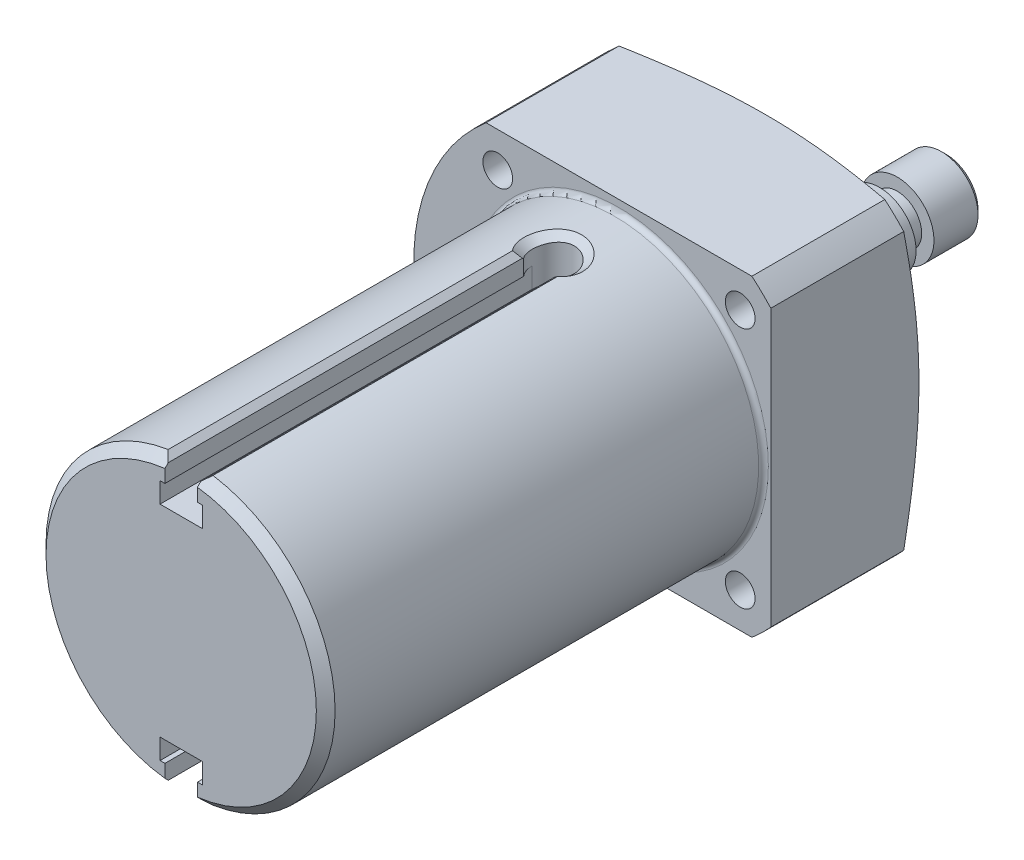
ISO-10303-21;
HEADER;
FILE_DESCRIPTION(('STEP AP214'),'2;1');
FILE_NAME('part.step','',(''),(''),'','','');
FILE_SCHEMA(('AUTOMOTIVE_DESIGN { 1 0 10303 214 1 1 1 1 }'));
ENDSEC;
DATA;
#1=APPLICATION_CONTEXT('core data for automotive mechanical design processes');
#2=APPLICATION_PROTOCOL_DEFINITION('international standard','automotive_design',2000,#1);
#3=PRODUCT_CONTEXT('',#1,'mechanical');
#4=PRODUCT('Part','Part','',(#3));
#5=PRODUCT_RELATED_PRODUCT_CATEGORY('part','',(#4));
#6=PRODUCT_DEFINITION_FORMATION('','',#4);
#7=PRODUCT_DEFINITION_CONTEXT('part definition',#1,'design');
#8=PRODUCT_DEFINITION('design','',#6,#7);
#9=PRODUCT_DEFINITION_SHAPE('','',#8);
#10=(LENGTH_UNIT() NAMED_UNIT(*) SI_UNIT(.MILLI.,.METRE.));
#11=(NAMED_UNIT(*) PLANE_ANGLE_UNIT() SI_UNIT($,.RADIAN.));
#12=(NAMED_UNIT(*) SI_UNIT($,.STERADIAN.) SOLID_ANGLE_UNIT());
#13=UNCERTAINTY_MEASURE_WITH_UNIT(LENGTH_MEASURE(1.E-05),#10,'distance_accuracy_value','');
#14=(GEOMETRIC_REPRESENTATION_CONTEXT(3) GLOBAL_UNCERTAINTY_ASSIGNED_CONTEXT((#13)) GLOBAL_UNIT_ASSIGNED_CONTEXT((#10,
#11,#12)) REPRESENTATION_CONTEXT('',''));
#15=CARTESIAN_POINT('',(0.,0.,0.));
#16=DIRECTION('',(0.,0.,1.));
#17=DIRECTION('',(1.,0.,0.));
#18=AXIS2_PLACEMENT_3D('',#15,#16,#17);
#19=CARTESIAN_POINT('',(5.93725,0.,-14.1375812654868));
#20=DIRECTION('',(0.,0.,1.));
#21=DIRECTION('',(1.,0.,0.));
#22=AXIS2_PLACEMENT_3D('',#19,#20,#21);
#23=PLANE('',#22);
#24=CARTESIAN_POINT('',(0.,0.,-14.1375812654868));
#25=DIRECTION('',(0.,0.,-1.));
#26=DIRECTION('',(-1.,0.,0.));
#27=AXIS2_PLACEMENT_3D('',#24,#25,#26);
#28=CIRCLE('',#27,5.93725);
#29=CARTESIAN_POINT('',(-5.93725,0.,-14.1375812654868));
#30=VERTEX_POINT('',#29);
#31=EDGE_CURVE('E732',#30,#30,#28,.T.);
#32=ORIENTED_EDGE('',*,*,#31,.T.);
#33=EDGE_LOOP('',(#32));
#34=FACE_BOUND('',#33,.T.);
#35=CARTESIAN_POINT('',(0.,0.,-14.1375812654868));
#36=DIRECTION('',(0.,0.,1.));
#37=DIRECTION('',(1.,0.,0.));
#38=AXIS2_PLACEMENT_3D('',#35,#36,#37);
#39=CIRCLE('',#38,3.9624);
#40=CARTESIAN_POINT('',(3.9624,0.,-14.1375812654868));
#41=VERTEX_POINT('',#40);
#42=EDGE_CURVE('E1393',#41,#41,#39,.F.);
#43=ORIENTED_EDGE('',*,*,#42,.F.);
#44=EDGE_LOOP('',(#43));
#45=FACE_BOUND('',#44,.T.);
#46=ADVANCED_FACE('F37',(#34,#45),#23,.F.);
#47=CARTESIAN_POINT('',(0.,0.,0.));
#48=DIRECTION('',(0.,0.,1.));
#49=DIRECTION('',(1.,0.,0.));
#50=AXIS2_PLACEMENT_3D('',#47,#48,#49);
#51=PLANE('',#50);
#52=CARTESIAN_POINT('',(0.,0.,0.));
#53=DIRECTION('',(0.,0.,-1.));
#54=DIRECTION('',(-1.,0.,0.));
#55=AXIS2_PLACEMENT_3D('',#52,#53,#54);
#56=CIRCLE('',#55,10.16);
#57=CARTESIAN_POINT('',(-10.16,0.,0.));
#58=VERTEX_POINT('',#57);
#59=EDGE_CURVE('E738',#58,#58,#56,.T.);
#60=ORIENTED_EDGE('',*,*,#59,.T.);
#61=EDGE_LOOP('',(#60));
#62=FACE_BOUND('',#61,.T.);
#63=CARTESIAN_POINT('',(0.,0.,0.));
#64=DIRECTION('',(0.,0.,1.));
#65=DIRECTION('',(1.,0.,0.));
#66=AXIS2_PLACEMENT_3D('',#63,#64,#65);
#67=CIRCLE('',#66,6.34365);
#68=CARTESIAN_POINT('',(6.34365,0.,0.));
#69=VERTEX_POINT('',#68);
#70=EDGE_CURVE('E675',#69,#69,#67,.F.);
#71=ORIENTED_EDGE('',*,*,#70,.F.);
#72=EDGE_LOOP('',(#71));
#73=FACE_BOUND('',#72,.T.);
#74=ADVANCED_FACE('F598',(#62,#73),#51,.F.);
#75=CARTESIAN_POINT('',(0.,0.,99.314));
#76=DIRECTION('',(0.,0.,-1.));
#77=DIRECTION('',(-1.,0.,0.));
#78=AXIS2_PLACEMENT_3D('',#75,#76,#77);
#79=CYLINDRICAL_SURFACE('',#78,33.3375);
#80=CARTESIAN_POINT('',(-31.7376992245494,-10.2033011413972,20.2692));
#81=CARTESIAN_POINT('',(-31.7376980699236,-10.2033115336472,20.5022015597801));
#82=CARTESIAN_POINT('',(-31.7316648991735,-10.2221303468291,20.735348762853));
#83=CARTESIAN_POINT('',(-31.7075059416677,-10.2968176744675,21.195154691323));
#84=CARTESIAN_POINT('',(-31.6893675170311,-10.352724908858,21.4218063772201));
#85=CARTESIAN_POINT('',(-31.6409869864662,-10.4996568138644,21.8618974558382));
#86=CARTESIAN_POINT('',(-31.6107530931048,-10.5906576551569,22.0753457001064));
#87=CARTESIAN_POINT('',(-31.5382149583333,-10.8047497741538,22.4831882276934));
#88=CARTESIAN_POINT('',(-31.4959127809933,-10.9278355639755,22.6775857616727));
#89=CARTESIAN_POINT('',(-31.3991438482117,-11.2028552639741,23.0429355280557));
#90=CARTESIAN_POINT('',(-31.3446173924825,-11.3549301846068,23.2137658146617));
#91=CARTESIAN_POINT('',(-31.2239076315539,-11.6827628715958,23.5260784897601));
#92=CARTESIAN_POINT('',(-31.1577237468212,-11.8585218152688,23.6675594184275));
#93=CARTESIAN_POINT('',(-31.0142128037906,-12.2289423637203,23.9175945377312));
#94=CARTESIAN_POINT('',(-30.9368496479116,-12.4236645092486,24.0260383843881));
#95=CARTESIAN_POINT('',(-30.772395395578,-12.8255869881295,24.2062142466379));
#96=CARTESIAN_POINT('',(-30.6853046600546,-13.0327868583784,24.2779476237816));
#97=CARTESIAN_POINT('',(-30.5036997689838,-13.4523290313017,24.3823020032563));
#98=CARTESIAN_POINT('',(-30.4092268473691,-13.6646387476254,24.415125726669));
#99=CARTESIAN_POINT('',(-30.2148585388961,-14.0892059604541,24.4413573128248));
#100=CARTESIAN_POINT('',(-30.1149633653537,-14.3014634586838,24.4347667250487));
#101=CARTESIAN_POINT('',(-29.9132499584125,-14.7186887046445,24.3825192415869));
#102=CARTESIAN_POINT('',(-29.8114455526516,-14.9236904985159,24.3370803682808));
#103=CARTESIAN_POINT('',(-29.6086716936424,-15.32205782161,24.2087669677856));
#104=CARTESIAN_POINT('',(-29.507702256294,-15.515423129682,24.1258917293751));
#105=CARTESIAN_POINT('',(-29.3098822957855,-15.8859681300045,23.9248262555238));
#106=CARTESIAN_POINT('',(-29.213043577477,-16.0631029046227,23.806541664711));
#107=CARTESIAN_POINT('',(-29.0274211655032,-16.3961622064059,23.5380837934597));
#108=CARTESIAN_POINT('',(-28.9386378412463,-16.5520857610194,23.3879090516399));
#109=CARTESIAN_POINT('',(-28.7721015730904,-16.8399220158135,23.0587126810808));
#110=CARTESIAN_POINT('',(-28.6944281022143,-16.9716634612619,22.8795010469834));
#111=CARTESIAN_POINT('',(-28.554150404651,-17.2066320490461,22.4979707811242));
#112=CARTESIAN_POINT('',(-28.4915462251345,-17.3098591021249,22.2956520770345));
#113=CARTESIAN_POINT('',(-28.3841879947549,-17.4853486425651,21.8734825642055));
#114=CARTESIAN_POINT('',(-28.339441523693,-17.5575979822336,21.6536243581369));
#115=CARTESIAN_POINT('',(-28.2699332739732,-17.669299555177,21.2027041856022));
#116=CARTESIAN_POINT('',(-28.245170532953,-17.7087533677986,20.9716427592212));
#117=CARTESIAN_POINT('',(-28.2169157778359,-17.7537399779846,20.5065425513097));
#118=CARTESIAN_POINT('',(-28.2132815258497,-17.7594996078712,20.2725343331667));
#119=CARTESIAN_POINT('',(-28.2270775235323,-17.7375635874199,19.8067218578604));
#120=CARTESIAN_POINT('',(-28.2445073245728,-17.709868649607,19.5749175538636));
#121=CARTESIAN_POINT('',(-28.2995021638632,-17.6218538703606,19.1208891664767));
#122=CARTESIAN_POINT('',(-28.3369991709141,-17.56164425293,18.8986354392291));
#123=CARTESIAN_POINT('',(-28.4303447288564,-17.4101199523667,18.4690897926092));
#124=CARTESIAN_POINT('',(-28.4861939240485,-17.3188041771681,18.2617983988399));
#125=CARTESIAN_POINT('',(-28.6140877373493,-17.106672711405,17.8668595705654));
#126=CARTESIAN_POINT('',(-28.6862162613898,-16.9857038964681,17.6793215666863));
#127=CARTESIAN_POINT('',(-28.8433965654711,-16.7174009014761,17.3303295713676));
#128=CARTESIAN_POINT('',(-28.9284488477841,-16.5700656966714,17.1688765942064));
#129=CARTESIAN_POINT('',(-29.1085129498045,-16.2516754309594,16.8757044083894));
#130=CARTESIAN_POINT('',(-29.2035787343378,-16.080490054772,16.7441597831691));
#131=CARTESIAN_POINT('',(-29.3995429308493,-15.7193488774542,16.5157463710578));
#132=CARTESIAN_POINT('',(-29.5004412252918,-15.5293934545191,16.4188768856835));
#133=CARTESIAN_POINT('',(-29.7040833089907,-15.1362208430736,16.2628518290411));
#134=CARTESIAN_POINT('',(-29.80682139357,-14.9330407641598,16.2035953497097));
#135=CARTESIAN_POINT('',(-30.0109142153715,-14.5185149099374,16.1241501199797));
#136=CARTESIAN_POINT('',(-30.1122690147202,-14.3071695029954,16.1039596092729));
#137=CARTESIAN_POINT('',(-30.3098027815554,-13.8837664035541,16.1032523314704));
#138=CARTESIAN_POINT('',(-30.406012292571,-13.6717233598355,16.1224663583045));
#139=CARTESIAN_POINT('',(-30.5914394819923,-13.2516215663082,16.1994525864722));
#140=CARTESIAN_POINT('',(-30.6806571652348,-13.0435628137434,16.2572247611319));
#141=CARTESIAN_POINT('',(-30.8500882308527,-12.6376169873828,16.4096028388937));
#142=CARTESIAN_POINT('',(-30.9303047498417,-12.4397263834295,16.5041958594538));
#143=CARTESIAN_POINT('',(-31.0803649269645,-12.0599158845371,16.7275025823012));
#144=CARTESIAN_POINT('',(-31.1502084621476,-11.877996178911,16.8562166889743));
#145=CARTESIAN_POINT('',(-31.2790456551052,-11.5344760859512,17.1451078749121));
#146=CARTESIAN_POINT('',(-31.3379653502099,-11.3730164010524,17.3054852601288));
#147=CARTESIAN_POINT('',(-31.4438897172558,-11.0768009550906,17.6527345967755));
#148=CARTESIAN_POINT('',(-31.4908915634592,-10.9420515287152,17.8396128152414));
#149=CARTESIAN_POINT('',(-31.5728937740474,-10.703146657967,18.2353858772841));
#150=CARTESIAN_POINT('',(-31.6078471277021,-10.5991112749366,18.4443628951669));
#151=CARTESIAN_POINT('',(-31.6654105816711,-10.4258853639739,18.877702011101));
#152=CARTESIAN_POINT('',(-31.6880341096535,-10.3566569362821,19.1020470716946));
#153=CARTESIAN_POINT('',(-31.7155790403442,-10.2719115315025,19.484494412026));
#154=CARTESIAN_POINT('',(-31.7238729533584,-10.2462246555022,19.6401843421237));
#155=CARTESIAN_POINT('',(-31.734933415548,-10.2119160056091,19.9536272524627));
#156=CARTESIAN_POINT('',(-31.7377000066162,-10.2032941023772,20.1113802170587));
#157=CARTESIAN_POINT('',(-31.7376992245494,-10.2033011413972,20.2692));
#158=B_SPLINE_CURVE_WITH_KNOTS('',3,(#80,#81,#82,#83,#84,#85,#86,#87,#88,#89,#90,#91,#92,#93,
#94,#95,#96,#97,#98,#99,#100,#101,#102,#103,#104,#105,#106,#107,#108,#109,#110,#111,#112,#113,
#114,#115,#116,#117,#118,#119,#120,#121,#122,#123,#124,#125,#126,#127,#128,#129,#130,#131,#132,
#133,#134,#135,#136,#137,#138,#139,#140,#141,#142,#143,#144,#145,#146,#147,#148,#149,#150,#151,
#152,#153,#154,#155,#156,#157),.UNSPECIFIED.,.T.,.F.,(4,2,2,2,2,2,2,2,2,2,2,2,2,2,2,2,2,2,2,2,2,
2,2,2,2,2,2,2,2,2,2,2,2,2,2,2,2,2,4),(0.,0.698428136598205,1.39758657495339,2.09627110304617,
2.79483620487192,3.49689026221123,4.19897923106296,4.90338810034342,5.60777084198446,
6.30846735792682,7.00913632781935,7.70589865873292,8.40267422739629,9.10132327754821,
9.800004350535,10.5034570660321,11.2069119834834,11.9106651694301,12.6143844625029,
13.3133607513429,14.012322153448,14.7089288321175,15.405559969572,16.1058671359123,
16.8062015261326,17.5105246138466,18.2148335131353,18.9172448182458,19.6196244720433,
20.3172215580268,21.0148181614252,21.7121709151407,22.409531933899,23.1114547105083,
23.8135437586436,24.5183420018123,25.222371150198,25.6954435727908,26.1685124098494),.UNSPECIFIED.);
#159=CARTESIAN_POINT('',(-31.7376992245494,-10.2033011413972,20.2692));
#160=VERTEX_POINT('',#159);
#161=EDGE_CURVE('E1377',#160,#160,#158,.T.);
#162=ORIENTED_EDGE('',*,*,#161,.T.);
#163=EDGE_LOOP('',(#162));
#164=FACE_BOUND('',#163,.T.);
#165=CARTESIAN_POINT('',(-31.7376992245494,10.2033011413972,20.2692));
#166=CARTESIAN_POINT('',(-31.7376980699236,10.2033115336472,20.0361984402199));
#167=CARTESIAN_POINT('',(-31.7316648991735,10.2221303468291,19.803051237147));
#168=CARTESIAN_POINT('',(-31.7075059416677,10.2968176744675,19.3432453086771));
#169=CARTESIAN_POINT('',(-31.6893675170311,10.352724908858,19.11659362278));
#170=CARTESIAN_POINT('',(-31.6409869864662,10.4996568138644,18.6765025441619));
#171=CARTESIAN_POINT('',(-31.6107530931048,10.5906576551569,18.4630542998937));
#172=CARTESIAN_POINT('',(-31.5382149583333,10.8047497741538,18.0552117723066));
#173=CARTESIAN_POINT('',(-31.4959127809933,10.9278355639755,17.8608142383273));
#174=CARTESIAN_POINT('',(-31.3991438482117,11.2028552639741,17.4954644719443));
#175=CARTESIAN_POINT('',(-31.3446173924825,11.3549301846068,17.3246341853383));
#176=CARTESIAN_POINT('',(-31.2239076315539,11.6827628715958,17.0123215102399));
#177=CARTESIAN_POINT('',(-31.1577237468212,11.8585218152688,16.8708405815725));
#178=CARTESIAN_POINT('',(-31.0142128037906,12.2289423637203,16.6208054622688));
#179=CARTESIAN_POINT('',(-30.9368496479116,12.4236645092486,16.512361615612));
#180=CARTESIAN_POINT('',(-30.772395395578,12.8255869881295,16.3321857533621));
#181=CARTESIAN_POINT('',(-30.6853046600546,13.0327868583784,16.2604523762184));
#182=CARTESIAN_POINT('',(-30.5036997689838,13.4523290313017,16.1560979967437));
#183=CARTESIAN_POINT('',(-30.4092268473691,13.6646387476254,16.1232742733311));
#184=CARTESIAN_POINT('',(-30.2148585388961,14.0892059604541,16.0970426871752));
#185=CARTESIAN_POINT('',(-30.1149633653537,14.3014634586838,16.1036332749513));
#186=CARTESIAN_POINT('',(-29.9132499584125,14.7186887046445,16.1558807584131));
#187=CARTESIAN_POINT('',(-29.8114455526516,14.9236904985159,16.2013196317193));
#188=CARTESIAN_POINT('',(-29.6086716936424,15.32205782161,16.3296330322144));
#189=CARTESIAN_POINT('',(-29.507702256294,15.515423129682,16.4125082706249));
#190=CARTESIAN_POINT('',(-29.3098822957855,15.8859681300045,16.6135737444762));
#191=CARTESIAN_POINT('',(-29.213043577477,16.0631029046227,16.731858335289));
#192=CARTESIAN_POINT('',(-29.0274211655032,16.3961622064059,17.0003162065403));
#193=CARTESIAN_POINT('',(-28.9386378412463,16.5520857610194,17.1504909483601));
#194=CARTESIAN_POINT('',(-28.7721015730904,16.8399220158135,17.4796873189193));
#195=CARTESIAN_POINT('',(-28.6944281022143,16.9716634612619,17.6588989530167));
#196=CARTESIAN_POINT('',(-28.554150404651,17.2066320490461,18.0404292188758));
#197=CARTESIAN_POINT('',(-28.4915462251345,17.3098591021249,18.2427479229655));
#198=CARTESIAN_POINT('',(-28.3841879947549,17.4853486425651,18.6649174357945));
#199=CARTESIAN_POINT('',(-28.339441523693,17.5575979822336,18.8847756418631));
#200=CARTESIAN_POINT('',(-28.2699332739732,17.669299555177,19.3356958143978));
#201=CARTESIAN_POINT('',(-28.245170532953,17.7087533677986,19.5667572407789));
#202=CARTESIAN_POINT('',(-28.2169157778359,17.7537399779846,20.0318574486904));
#203=CARTESIAN_POINT('',(-28.2132815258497,17.7594996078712,20.2658656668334));
#204=CARTESIAN_POINT('',(-28.2270775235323,17.7375635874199,20.7316781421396));
#205=CARTESIAN_POINT('',(-28.2445073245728,17.709868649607,20.9634824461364));
#206=CARTESIAN_POINT('',(-28.2995021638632,17.6218538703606,21.4175108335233));
#207=CARTESIAN_POINT('',(-28.3369991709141,17.56164425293,21.639764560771));
#208=CARTESIAN_POINT('',(-28.4303447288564,17.4101199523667,22.0693102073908));
#209=CARTESIAN_POINT('',(-28.4861939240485,17.3188041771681,22.2766016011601));
#210=CARTESIAN_POINT('',(-28.6140877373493,17.106672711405,22.6715404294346));
#211=CARTESIAN_POINT('',(-28.6862162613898,16.9857038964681,22.8590784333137));
#212=CARTESIAN_POINT('',(-28.8433965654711,16.7174009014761,23.2080704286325));
#213=CARTESIAN_POINT('',(-28.9284488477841,16.5700656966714,23.3695234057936));
#214=CARTESIAN_POINT('',(-29.1085129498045,16.2516754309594,23.6626955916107));
#215=CARTESIAN_POINT('',(-29.2035787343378,16.080490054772,23.794240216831));
#216=CARTESIAN_POINT('',(-29.3995429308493,15.7193488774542,24.0226536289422));
#217=CARTESIAN_POINT('',(-29.5004412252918,15.5293934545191,24.1195231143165));
#218=CARTESIAN_POINT('',(-29.7040833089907,15.1362208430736,24.2755481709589));
#219=CARTESIAN_POINT('',(-29.80682139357,14.9330407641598,24.3348046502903));
#220=CARTESIAN_POINT('',(-30.0109142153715,14.5185149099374,24.4142498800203));
#221=CARTESIAN_POINT('',(-30.1122690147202,14.3071695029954,24.4344403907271));
#222=CARTESIAN_POINT('',(-30.3098027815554,13.8837664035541,24.4351476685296));
#223=CARTESIAN_POINT('',(-30.406012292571,13.6717233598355,24.4159336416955));
#224=CARTESIAN_POINT('',(-30.5914394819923,13.2516215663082,24.3389474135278));
#225=CARTESIAN_POINT('',(-30.6806571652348,13.0435628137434,24.2811752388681));
#226=CARTESIAN_POINT('',(-30.8500882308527,12.6376169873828,24.1287971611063));
#227=CARTESIAN_POINT('',(-30.9303047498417,12.4397263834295,24.0342041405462));
#228=CARTESIAN_POINT('',(-31.0803649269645,12.0599158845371,23.8108974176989));
#229=CARTESIAN_POINT('',(-31.1502084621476,11.877996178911,23.6821833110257));
#230=CARTESIAN_POINT('',(-31.2790456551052,11.5344760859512,23.393292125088));
#231=CARTESIAN_POINT('',(-31.3379653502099,11.3730164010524,23.2329147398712));
#232=CARTESIAN_POINT('',(-31.4438897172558,11.0768009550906,22.8856654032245));
#233=CARTESIAN_POINT('',(-31.4908915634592,10.9420515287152,22.6987871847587));
#234=CARTESIAN_POINT('',(-31.5728937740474,10.703146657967,22.3030141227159));
#235=CARTESIAN_POINT('',(-31.6078471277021,10.5991112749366,22.0940371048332));
#236=CARTESIAN_POINT('',(-31.6654105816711,10.4258853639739,21.660697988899));
#237=CARTESIAN_POINT('',(-31.6880341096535,10.3566569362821,21.4363529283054));
#238=CARTESIAN_POINT('',(-31.7155790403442,10.2719115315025,21.053905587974));
#239=CARTESIAN_POINT('',(-31.7238729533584,10.2462246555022,20.8982156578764));
#240=CARTESIAN_POINT('',(-31.734933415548,10.2119160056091,20.5847727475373));
#241=CARTESIAN_POINT('',(-31.7377000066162,10.2032941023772,20.4270197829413));
#242=CARTESIAN_POINT('',(-31.7376992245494,10.2033011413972,20.2692));
#243=B_SPLINE_CURVE_WITH_KNOTS('',3,(#165,#166,#167,#168,#169,#170,#171,#172,#173,#174,#175,
#176,#177,#178,#179,#180,#181,#182,#183,#184,#185,#186,#187,#188,#189,#190,#191,#192,#193,#194,
#195,#196,#197,#198,#199,#200,#201,#202,#203,#204,#205,#206,#207,#208,#209,#210,#211,#212,#213,
#214,#215,#216,#217,#218,#219,#220,#221,#222,#223,#224,#225,#226,#227,#228,#229,#230,#231,#232,
#233,#234,#235,#236,#237,#238,#239,#240,#241,#242),.UNSPECIFIED.,.T.,.F.,(4,2,2,2,2,2,2,2,2,2,2,
2,2,2,2,2,2,2,2,2,2,2,2,2,2,2,2,2,2,2,2,2,2,2,2,2,2,2,4),(0.,0.698428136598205,1.39758657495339,
2.09627110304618,2.79483620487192,3.49689026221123,4.19897923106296,4.90338810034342,
5.60777084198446,6.30846735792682,7.00913632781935,7.70589865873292,8.40267422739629,
9.10132327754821,9.800004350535,10.5034570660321,11.2069119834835,11.9106651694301,
12.6143844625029,13.3133607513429,14.012322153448,14.7089288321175,15.405559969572,
16.1058671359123,16.8062015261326,17.5105246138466,18.2148335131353,18.9172448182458,
19.6196244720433,20.3172215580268,21.0148181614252,21.7121709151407,22.409531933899,
23.1114547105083,23.8135437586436,24.5183420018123,25.222371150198,25.6954435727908,
26.1685124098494),.UNSPECIFIED.);
#244=CARTESIAN_POINT('',(-31.7376992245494,10.2033011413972,20.2692));
#245=VERTEX_POINT('',#244);
#246=EDGE_CURVE('E1384',#245,#245,#243,.T.);
#247=ORIENTED_EDGE('',*,*,#246,.T.);
#248=EDGE_LOOP('',(#247));
#249=FACE_BOUND('',#248,.T.);
#250=DIRECTION('',(0.,0.,-1.));
#251=VECTOR('',#250,1.);
#252=CARTESIAN_POINT('',(-21.5923344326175,25.4,99.314));
#253=LINE('',#252,#251);
#254=CARTESIAN_POINT('',(-21.5923344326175,25.4,28.194));
#255=VERTEX_POINT('',#254);
#256=CARTESIAN_POINT('',(-21.5923344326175,25.4,6.604));
#257=VERTEX_POINT('',#256);
#258=EDGE_CURVE('E762',#255,#257,#253,.T.);
#259=ORIENTED_EDGE('',*,*,#258,.T.);
#260=CARTESIAN_POINT('',(0.,0.,6.604));
#261=DIRECTION('',(0.,0.,-1.));
#262=DIRECTION('',(-1.,0.,0.));
#263=AXIS2_PLACEMENT_3D('',#260,#261,#262);
#264=CIRCLE('',#263,33.3375);
#265=CARTESIAN_POINT('',(-21.5923344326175,-25.4,6.604));
#266=VERTEX_POINT('',#265);
#267=EDGE_CURVE('E618',#266,#257,#264,.T.);
#268=ORIENTED_EDGE('',*,*,#267,.F.);
#269=DIRECTION('',(0.,0.,-1.));
#270=VECTOR('',#269,1.);
#271=CARTESIAN_POINT('',(-21.5923344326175,-25.4,99.314));
#272=LINE('',#271,#270);
#273=CARTESIAN_POINT('',(-21.5923344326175,-25.4,28.194));
#274=VERTEX_POINT('',#273);
#275=EDGE_CURVE('E683',#274,#266,#272,.T.);
#276=ORIENTED_EDGE('',*,*,#275,.F.);
#277=CARTESIAN_POINT('',(0.,0.,28.194));
#278=DIRECTION('',(0.,0.,-1.));
#279=DIRECTION('',(-1.,0.,0.));
#280=AXIS2_PLACEMENT_3D('',#277,#278,#279);
#281=CIRCLE('',#280,33.3375);
#282=EDGE_CURVE('E775',#274,#255,#281,.T.);
#283=ORIENTED_EDGE('',*,*,#282,.T.);
#284=EDGE_LOOP('',(#259,#268,#276,#283));
#285=FACE_BOUND('',#284,.T.);
#286=ADVANCED_FACE('F423',(#164,#249,#285),#79,.T.);
#287=CARTESIAN_POINT('',(-21.5923344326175,-25.4,99.314));
#288=DIRECTION('',(0.,1.,0.));
#289=DIRECTION('',(0.,0.,1.));
#290=AXIS2_PLACEMENT_3D('',#287,#288,#289);
#291=PLANE('',#290);
#292=ORIENTED_EDGE('',*,*,#275,.T.);
#293=CARTESIAN_POINT('',(-45.7372242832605,-25.4,12.0118172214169));
#294=CARTESIAN_POINT('',(-45.1167817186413,-25.4,11.8572690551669));
#295=CARTESIAN_POINT('',(-44.4961665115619,-25.4,11.7034142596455));
#296=CARTESIAN_POINT('',(-43.2545553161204,-25.4,11.397243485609));
#297=CARTESIAN_POINT('',(-42.6335593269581,-25.4,11.244927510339));
#298=CARTESIAN_POINT('',(-40.769919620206,-25.4,10.790509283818));
#299=CARTESIAN_POINT('',(-39.5266553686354,-25.4,10.4909445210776));
#300=CARTESIAN_POINT('',(-37.0379015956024,-25.4,9.90005187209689));
#301=CARTESIAN_POINT('',(-35.7924116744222,-25.4,9.60872566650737));
#302=CARTESIAN_POINT('',(-33.2990714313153,-25.4,9.03635394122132));
#303=CARTESIAN_POINT('',(-32.0512211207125,-25.4,8.75530837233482));
#304=CARTESIAN_POINT('',(-29.5621560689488,-25.4,8.20813739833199));
#305=CARTESIAN_POINT('',(-28.3209627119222,-25.4,7.94191505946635));
#306=CARTESIAN_POINT('',(-25.8352566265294,-25.4,7.42534978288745));
#307=CARTESIAN_POINT('',(-24.590743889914,-25.4,7.17500688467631));
#308=CARTESIAN_POINT('',(-22.0973297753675,-25.4,6.69425349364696));
#309=CARTESIAN_POINT('',(-20.8484268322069,-25.4,6.46385106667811));
#310=CARTESIAN_POINT('',(-18.3461683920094,-25.4,6.0283248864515));
#311=CARTESIAN_POINT('',(-17.0928128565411,-25.4,5.82320135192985));
#312=CARTESIAN_POINT('',(-14.5632995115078,-25.4,5.44187090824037));
#313=CARTESIAN_POINT('',(-13.287072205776,-25.4,5.26612019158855));
#314=CARTESIAN_POINT('',(-10.7296391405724,-25.4,4.95469324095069));
#315=CARTESIAN_POINT('',(-9.44843346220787,-25.4,4.81901635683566));
#316=CARTESIAN_POINT('',(-7.52426714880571,-25.4,4.65121900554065));
#317=CARTESIAN_POINT('',(-6.88283890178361,-25.4,4.60125723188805));
#318=CARTESIAN_POINT('',(-5.59912808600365,-25.4,4.51398327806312));
#319=CARTESIAN_POINT('',(-4.95684553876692,-25.4,4.47667078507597));
#320=CARTESIAN_POINT('',(-3.67165166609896,-25.4,4.41535052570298));
#321=CARTESIAN_POINT('',(-3.02874034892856,-25.4,4.39134258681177));
#322=CARTESIAN_POINT('',(-1.74254916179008,-25.4,4.35707329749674));
#323=CARTESIAN_POINT('',(-1.09926929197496,-25.4,4.34681194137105));
#324=CARTESIAN_POINT('',(0.190341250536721,-25.4,4.34021706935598));
#325=CARTESIAN_POINT('',(0.836672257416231,-25.4,4.34394826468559));
#326=CARTESIAN_POINT('',(2.12910003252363,-25.4,4.36541042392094));
#327=CARTESIAN_POINT('',(2.77519680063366,-25.4,4.3831413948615));
#328=CARTESIAN_POINT('',(4.06688359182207,-25.4,4.43226828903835));
#329=CARTESIAN_POINT('',(4.71247360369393,-25.4,4.4636645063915));
#330=CARTESIAN_POINT('',(6.00287201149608,-25.4,4.53954611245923));
#331=CARTESIAN_POINT('',(6.64768040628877,-25.4,4.58403152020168));
#332=CARTESIAN_POINT('',(8.58219427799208,-25.4,4.73614347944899));
#333=CARTESIAN_POINT('',(9.8704774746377,-25.4,4.86236513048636));
#334=CARTESIAN_POINT('',(11.7991278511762,-25.4,5.08334090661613));
#335=CARTESIAN_POINT('',(12.441391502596,-25.4,5.16227475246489));
#336=CARTESIAN_POINT('',(13.7246789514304,-25.4,5.32971024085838));
#337=CARTESIAN_POINT('',(14.3657027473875,-25.4,5.41821189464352));
#338=CARTESIAN_POINT('',(15.8418914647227,-25.4,5.63215585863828));
#339=CARTESIAN_POINT('',(16.676615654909,-25.4,5.76063025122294));
#340=CARTESIAN_POINT('',(18.3440189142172,-25.4,6.03028539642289));
#341=CARTESIAN_POINT('',(19.1766979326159,-25.4,6.17146646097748));
#342=CARTESIAN_POINT('',(20.8402091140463,-25.4,6.46476991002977));
#343=CARTESIAN_POINT('',(21.6710410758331,-25.4,6.61689343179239));
#344=CARTESIAN_POINT('',(23.3309233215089,-25.4,6.93050794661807));
#345=CARTESIAN_POINT('',(24.1599736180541,-25.4,7.09199887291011));
#346=CARTESIAN_POINT('',(25.8168166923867,-25.4,7.42307576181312));
#347=CARTESIAN_POINT('',(26.6446087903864,-25.4,7.59266511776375));
#348=CARTESIAN_POINT('',(28.2987504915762,-25.4,7.93873014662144));
#349=CARTESIAN_POINT('',(29.1251000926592,-25.4,8.1152058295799));
#350=CARTESIAN_POINT('',(30.7764682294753,-25.4,8.47406207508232));
#351=CARTESIAN_POINT('',(31.6014868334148,-25.4,8.6564423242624));
#352=CARTESIAN_POINT('',(33.2503810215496,-25.4,9.02630385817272));
#353=CARTESIAN_POINT('',(34.0742566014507,-25.4,9.21378516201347));
#354=CARTESIAN_POINT('',(36.5465898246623,-25.4,9.78332706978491));
#355=CARTESIAN_POINT('',(38.1935254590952,-25.4,10.1719972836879));
#356=CARTESIAN_POINT('',(41.484207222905,-25.4,10.9626103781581));
#357=CARTESIAN_POINT('',(43.1279533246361,-25.4,11.3645533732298));
#358=CARTESIAN_POINT('',(46.4124889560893,-25.4,12.1785458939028));
#359=CARTESIAN_POINT('',(48.0532791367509,-25.4,12.5905927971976));
#360=CARTESIAN_POINT('',(51.3328293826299,-25.4,13.4226507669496));
#361=CARTESIAN_POINT('',(52.9715894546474,-25.4,13.8426618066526));
#362=CARTESIAN_POINT('',(56.2279454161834,-25.4,14.683952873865));
#363=CARTESIAN_POINT('',(57.8455606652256,-25.4,15.1051580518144));
#364=CARTESIAN_POINT('',(61.0794893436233,-25.4,15.9525360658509));
#365=CARTESIAN_POINT('',(62.6958027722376,-25.4,16.3787089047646));
#366=CARTESIAN_POINT('',(65.9274791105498,-25.4,17.2351395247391));
#367=CARTESIAN_POINT('',(67.5428419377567,-25.4,17.6653976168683));
#368=CARTESIAN_POINT('',(70.7726733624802,-25.4,18.5292576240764));
#369=CARTESIAN_POINT('',(72.3871419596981,-25.4,18.9628595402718));
#370=CARTESIAN_POINT('',(75.6097052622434,-25.4,19.831335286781));
#371=CARTESIAN_POINT('',(77.2178025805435,-25.4,20.2661994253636));
#372=CARTESIAN_POINT('',(80.433365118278,-25.4,21.1382590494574));
#373=CARTESIAN_POINT('',(82.040830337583,-25.4,21.5754545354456));
#374=CARTESIAN_POINT('',(85.2550765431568,-25.4,22.4517828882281));
#375=CARTESIAN_POINT('',(86.8618575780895,-25.4,22.8909155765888));
#376=CARTESIAN_POINT('',(90.0749522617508,-25.4,23.7708829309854));
#377=CARTESIAN_POINT('',(91.6812659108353,-25.4,24.2117175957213));
#378=CARTESIAN_POINT('',(93.2873829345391,-25.4,24.6532662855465));
#379=B_SPLINE_CURVE_WITH_KNOTS('',3,(#293,#294,#295,#296,#297,#298,#299,#300,#301,#302,#303,
#304,#305,#306,#307,#308,#309,#310,#311,#312,#313,#314,#315,#316,#317,#318,#319,#320,#321,#322,
#323,#324,#325,#326,#327,#328,#329,#330,#331,#332,#333,#334,#335,#336,#337,#338,#339,#340,#341,
#342,#343,#344,#345,#346,#347,#348,#349,#350,#351,#352,#353,#354,#355,#356,#357,#358,#359,#360,
#361,#362,#363,#364,#365,#366,#367,#368,#369,#370,#371,#372,#373,#374,#375,#376,#377,#378),
.UNSPECIFIED.,.F.,.F.,(4,2,2,2,2,2,2,2,2,2,2,2,2,2,2,2,2,2,2,2,2,2,2,2,2,2,2,2,2,2,2,2,2,2,2,2,
2,2,2,2,2,2,4),(0.,1.91820335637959,3.83641075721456,7.67292204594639,11.5102104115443,
15.3474804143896,19.1556686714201,22.9638664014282,26.7735974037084,30.5833613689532,
34.4476858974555,38.3119477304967,40.2419564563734,42.1719174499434,44.1018534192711,
46.0317885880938,47.9706600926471,49.909532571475,51.8484467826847,53.7873638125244,
57.6697313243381,59.6109712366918,61.552213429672,64.0857566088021,66.6193620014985,
69.1532310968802,71.6870821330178,74.2220043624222,76.7569302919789,79.2917219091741,
81.8265230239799,86.9029690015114,91.9794587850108,97.0546447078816,102.1298135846,
107.144466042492,112.159121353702,117.174161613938,122.189203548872,127.186776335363,
132.184350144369,137.181472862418,142.178591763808),.UNSPECIFIED.);
#380=CARTESIAN_POINT('',(21.5923344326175,-25.4,6.604));
#381=VERTEX_POINT('',#380);
#382=EDGE_CURVE('E625',#266,#381,#379,.T.);
#383=ORIENTED_EDGE('',*,*,#382,.T.);
#384=DIRECTION('',(0.,0.,-1.));
#385=VECTOR('',#384,1.);
#386=CARTESIAN_POINT('',(21.5923344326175,-25.4,99.314));
#387=LINE('',#386,#385);
#388=CARTESIAN_POINT('',(21.5923344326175,-25.4,28.194));
#389=VERTEX_POINT('',#388);
#390=EDGE_CURVE('E760',#389,#381,#387,.T.);
#391=ORIENTED_EDGE('',*,*,#390,.F.);
#392=DIRECTION('',(-1.,0.,0.));
#393=VECTOR('',#392,1.);
#394=CARTESIAN_POINT('',(-21.5923344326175,-25.4,28.194));
#395=LINE('',#394,#393);
#396=EDGE_CURVE('E771',#389,#274,#395,.T.);
#397=ORIENTED_EDGE('',*,*,#396,.T.);
#398=EDGE_LOOP('',(#292,#383,#391,#397));
#399=FACE_BOUND('',#398,.T.);
#400=ADVANCED_FACE('F637',(#399),#291,.F.);
#401=CARTESIAN_POINT('',(0.,0.,99.314));
#402=DIRECTION('',(0.,0.,-1.));
#403=DIRECTION('',(-1.,0.,0.));
#404=AXIS2_PLACEMENT_3D('',#401,#402,#403);
#405=CYLINDRICAL_SURFACE('',#404,33.3375);
#406=ORIENTED_EDGE('',*,*,#390,.T.);
#407=CARTESIAN_POINT('',(24.6634,-22.4300157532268,6.604));
#408=VERTEX_POINT('',#407);
#409=EDGE_CURVE('E741',#408,#381,#264,.T.);
#410=ORIENTED_EDGE('',*,*,#409,.F.);
#411=DIRECTION('',(0.,0.,-1.));
#412=VECTOR('',#411,1.);
#413=CARTESIAN_POINT('',(24.6634,-22.4300157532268,99.314));
#414=LINE('',#413,#412);
#415=CARTESIAN_POINT('',(24.6634,-22.4300157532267,28.194));
#416=VERTEX_POINT('',#415);
#417=EDGE_CURVE('E755',#416,#408,#414,.T.);
#418=ORIENTED_EDGE('',*,*,#417,.F.);
#419=EDGE_CURVE('E780',#416,#389,#281,.T.);
#420=ORIENTED_EDGE('',*,*,#419,.T.);
#421=EDGE_LOOP('',(#406,#410,#418,#420));
#422=FACE_BOUND('',#421,.T.);
#423=ADVANCED_FACE('F634',(#422),#405,.T.);
#424=CARTESIAN_POINT('',(24.6634,22.4300157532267,99.314));
#425=DIRECTION('',(-1.,0.,0.));
#426=DIRECTION('',(0.,0.,1.));
#427=AXIS2_PLACEMENT_3D('',#424,#425,#426);
#428=PLANE('',#427);
#429=ORIENTED_EDGE('',*,*,#417,.T.);
#430=CARTESIAN_POINT('',(24.6634,-46.0495101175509,11.989435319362));
#431=CARTESIAN_POINT('',(24.6634,-45.4354038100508,11.8351892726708));
#432=CARTESIAN_POINT('',(24.6634,-44.8211361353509,11.681585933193));
#433=CARTESIAN_POINT('',(24.6634,-43.5922447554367,11.3758054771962));
#434=CARTESIAN_POINT('',(24.6634,-42.9776210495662,11.223628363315));
#435=CARTESIAN_POINT('',(24.6634,-41.1331422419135,10.7694417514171));
#436=CARTESIAN_POINT('',(24.6634,-39.902706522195,10.4697837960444));
#437=CARTESIAN_POINT('',(24.6634,-37.439949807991,9.87814855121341));
#438=CARTESIAN_POINT('',(24.6634,-36.2076287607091,9.58617148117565));
#439=CARTESIAN_POINT('',(24.6634,-33.7407673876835,9.01174610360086));
#440=CARTESIAN_POINT('',(24.6634,-32.5062270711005,8.72929775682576));
#441=CARTESIAN_POINT('',(24.6634,-30.0432717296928,8.17828277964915));
#442=CARTESIAN_POINT('',(24.6634,-28.8148756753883,7.90963163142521));
#443=CARTESIAN_POINT('',(24.6634,-26.3549268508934,7.38710936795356));
#444=CARTESIAN_POINT('',(24.6634,-25.1233740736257,7.13323828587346));
#445=CARTESIAN_POINT('',(24.6634,-22.6559104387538,6.64408037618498));
#446=CARTESIAN_POINT('',(24.6634,-21.4199976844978,6.40880305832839));
#447=CARTESIAN_POINT('',(24.6634,-18.9438374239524,5.96199489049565));
#448=CARTESIAN_POINT('',(24.6634,-17.7035898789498,5.75046425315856));
#449=CARTESIAN_POINT('',(24.6634,-15.2004170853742,5.35452409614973));
#450=CARTESIAN_POINT('',(24.6634,-13.9374224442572,5.17054895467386));
#451=CARTESIAN_POINT('',(24.6634,-11.4063315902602,4.84098720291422));
#452=CARTESIAN_POINT('',(24.6634,-10.1382354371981,4.69540014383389));
#453=CARTESIAN_POINT('',(24.6634,-8.23356521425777,4.51177074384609));
#454=CARTESIAN_POINT('',(24.6634,-7.59864381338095,4.45637612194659));
#455=CARTESIAN_POINT('',(24.6634,-6.3278462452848,4.35799477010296));
#456=CARTESIAN_POINT('',(24.6634,-5.69197010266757,4.31500772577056));
#457=CARTESIAN_POINT('',(24.6634,-4.41947238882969,4.24219835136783));
#458=CARTESIAN_POINT('',(24.6634,-3.7828508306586,4.21237579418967));
#459=CARTESIAN_POINT('',(24.6634,-2.50910993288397,4.1664544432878));
#460=CARTESIAN_POINT('',(24.6634,-1.87199059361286,4.15035564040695));
#461=CARTESIAN_POINT('',(24.6634,-0.594575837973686,4.13215627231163));
#462=CARTESIAN_POINT('',(24.6634,0.0457205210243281,4.13012140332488));
#463=CARTESIAN_POINT('',(24.6634,1.32620005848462,4.14026485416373));
#464=CARTESIAN_POINT('',(24.6634,1.96638323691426,4.15244317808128));
#465=CARTESIAN_POINT('',(24.6634,3.24634058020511,4.1907697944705));
#466=CARTESIAN_POINT('',(24.6634,3.88611473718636,4.21691834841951));
#467=CARTESIAN_POINT('',(24.6634,5.16496725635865,4.28268163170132));
#468=CARTESIAN_POINT('',(24.6634,5.8040456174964,4.32229638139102));
#469=CARTESIAN_POINT('',(24.6634,7.08209800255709,4.41433375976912));
#470=CARTESIAN_POINT('',(24.6634,7.72107084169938,4.4667727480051));
#471=CARTESIAN_POINT('',(24.6634,8.99792888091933,4.58355938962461));
#472=CARTESIAN_POINT('',(24.6634,9.63581406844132,4.64790717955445));
#473=CARTESIAN_POINT('',(24.6634,10.9103703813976,4.78754546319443));
#474=CARTESIAN_POINT('',(24.6634,11.5470415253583,4.86283578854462));
#475=CARTESIAN_POINT('',(24.6634,12.8191222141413,5.02336238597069));
#476=CARTESIAN_POINT('',(24.6634,13.4545317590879,5.10859865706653));
#477=CARTESIAN_POINT('',(24.6634,14.9559251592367,5.32079607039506));
#478=CARTESIAN_POINT('',(24.6634,15.8213622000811,5.4516264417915));
#479=CARTESIAN_POINT('',(24.6634,17.5499591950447,5.72761401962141));
#480=CARTESIAN_POINT('',(24.6634,18.4131190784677,5.87277166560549));
#481=CARTESIAN_POINT('',(24.6634,20.1374011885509,6.17530629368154));
#482=CARTESIAN_POINT('',(24.6634,20.9985231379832,6.3326848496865));
#483=CARTESIAN_POINT('',(24.6634,22.7187952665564,6.6577943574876));
#484=CARTESIAN_POINT('',(24.6634,23.5779454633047,6.82552521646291));
#485=CARTESIAN_POINT('',(24.6634,25.2949211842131,7.1698522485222));
#486=CARTESIAN_POINT('',(24.6634,26.1527458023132,7.34645292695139));
#487=CARTESIAN_POINT('',(24.6634,27.8668240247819,7.70711079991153));
#488=CARTESIAN_POINT('',(24.6634,28.7230776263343,7.89116800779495));
#489=CARTESIAN_POINT('',(24.6634,30.4341380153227,8.2656118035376));
#490=CARTESIAN_POINT('',(24.6634,31.2889448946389,8.45599797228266));
#491=CARTESIAN_POINT('',(24.6634,32.9973347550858,8.8421903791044));
#492=CARTESIAN_POINT('',(24.6634,33.8509177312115,9.03799663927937));
#493=CARTESIAN_POINT('',(24.6634,36.4129280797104,9.63301661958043));
#494=CARTESIAN_POINT('',(24.6634,38.1197381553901,10.0391957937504));
#495=CARTESIAN_POINT('',(24.6634,41.530026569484,10.8653197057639));
#496=CARTESIAN_POINT('',(24.6634,43.2335048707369,11.2852645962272));
#497=CARTESIAN_POINT('',(24.6634,46.6373160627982,12.1354761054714));
#498=CARTESIAN_POINT('',(24.6634,48.3376497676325,12.5657394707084));
#499=CARTESIAN_POINT('',(24.6634,51.7362455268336,13.4343279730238));
#500=CARTESIAN_POINT('',(24.6634,53.4345075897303,13.8726530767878));
#501=CARTESIAN_POINT('',(24.6634,56.8105000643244,14.7507244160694));
#502=CARTESIAN_POINT('',(24.6634,58.4882487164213,15.1904005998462));
#503=CARTESIAN_POINT('',(24.6634,61.8424415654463,16.0747017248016));
#504=CARTESIAN_POINT('',(24.6634,63.5188857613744,16.5193266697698));
#505=CARTESIAN_POINT('',(24.6634,66.8708634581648,17.4126266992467));
#506=CARTESIAN_POINT('',(24.6634,68.5463968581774,17.8613021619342));
#507=CARTESIAN_POINT('',(24.6634,71.8965800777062,18.7619402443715));
#508=CARTESIAN_POINT('',(24.6634,73.5712298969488,19.2139028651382));
#509=CARTESIAN_POINT('',(24.6634,76.9130464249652,20.1187269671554));
#510=CARTESIAN_POINT('',(24.6634,78.5802161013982,20.571577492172));
#511=CARTESIAN_POINT('',(24.6634,81.9139383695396,21.4795449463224));
#512=CARTESIAN_POINT('',(24.6634,83.5804909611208,21.934661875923));
#513=CARTESIAN_POINT('',(24.6634,86.9128936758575,22.8467606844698));
#514=CARTESIAN_POINT('',(24.6634,88.5787438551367,23.3037423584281));
#515=CARTESIAN_POINT('',(24.6634,91.9099916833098,24.2193477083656));
#516=CARTESIAN_POINT('',(24.6634,93.575389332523,24.6779713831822));
#517=CARTESIAN_POINT('',(24.6634,95.2405975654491,25.1372806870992));
#518=B_SPLINE_CURVE_WITH_KNOTS('',3,(#430,#431,#432,#433,#434,#435,#436,#437,#438,#439,#440,
#441,#442,#443,#444,#445,#446,#447,#448,#449,#450,#451,#452,#453,#454,#455,#456,#457,#458,#459,
#460,#461,#462,#463,#464,#465,#466,#467,#468,#469,#470,#471,#472,#473,#474,#475,#476,#477,#478,
#479,#480,#481,#482,#483,#484,#485,#486,#487,#488,#489,#490,#491,#492,#493,#494,#495,#496,#497,
#498,#499,#500,#501,#502,#503,#504,#505,#506,#507,#508,#509,#510,#511,#512,#513,#514,#515,#516,
#517),.UNSPECIFIED.,.F.,.F.,(4,2,2,2,2,2,2,2,2,2,2,2,2,2,2,2,2,2,2,2,2,2,2,2,2,2,2,2,2,2,2,2,2,
2,2,2,2,2,2,2,2,2,2,4),(0.,1.89954286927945,3.79908925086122,7.59826576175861,11.397550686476,
15.1968199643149,18.9690390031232,22.7412665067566,26.5154109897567,30.2895892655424,
34.1181124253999,37.9465908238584,39.8584893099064,41.7703393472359,43.6821564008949,
45.5939721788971,47.5147125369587,49.4354534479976,51.3562303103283,53.2770100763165,
55.2002530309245,57.1235180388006,59.0467534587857,60.9699886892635,63.5956497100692,
66.2213913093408,68.847471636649,71.4735284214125,74.1009328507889,76.7283419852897,
79.3555774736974,81.9828236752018,87.2461597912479,92.509554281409,97.7713104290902,
103.033044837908,108.23624618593,113.439451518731,118.643147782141,123.846845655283,
129.029580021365,134.212315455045,139.39449573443,144.576672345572),.UNSPECIFIED.);
#519=CARTESIAN_POINT('',(24.6634,22.4300157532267,6.604));
#520=VERTEX_POINT('',#519);
#521=EDGE_CURVE('E616',#408,#520,#518,.T.);
#522=ORIENTED_EDGE('',*,*,#521,.T.);
#523=DIRECTION('',(0.,0.,-1.));
#524=VECTOR('',#523,1.);
#525=CARTESIAN_POINT('',(24.6634,22.4300157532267,99.314));
#526=LINE('',#525,#524);
#527=CARTESIAN_POINT('',(24.6634,22.4300157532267,28.194));
#528=VERTEX_POINT('',#527);
#529=EDGE_CURVE('E753',#528,#520,#526,.T.);
#530=ORIENTED_EDGE('',*,*,#529,.F.);
#531=DIRECTION('',(0.,-1.,0.));
#532=VECTOR('',#531,1.);
#533=CARTESIAN_POINT('',(24.6634,22.4300157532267,28.194));
#534=LINE('',#533,#532);
#535=EDGE_CURVE('E777',#528,#416,#534,.T.);
#536=ORIENTED_EDGE('',*,*,#535,.T.);
#537=EDGE_LOOP('',(#429,#522,#530,#536));
#538=FACE_BOUND('',#537,.T.);
#539=ADVANCED_FACE('F630',(#538),#428,.F.);
#540=CARTESIAN_POINT('',(0.,0.,99.314));
#541=DIRECTION('',(0.,0.,-1.));
#542=DIRECTION('',(-1.,0.,0.));
#543=AXIS2_PLACEMENT_3D('',#540,#541,#542);
#544=CYLINDRICAL_SURFACE('',#543,33.3375);
#545=ORIENTED_EDGE('',*,*,#529,.T.);
#546=CARTESIAN_POINT('',(21.5923344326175,25.4,6.604));
#547=VERTEX_POINT('',#546);
#548=EDGE_CURVE('E617',#547,#520,#264,.T.);
#549=ORIENTED_EDGE('',*,*,#548,.F.);
#550=DIRECTION('',(0.,0.,-1.));
#551=VECTOR('',#550,1.);
#552=CARTESIAN_POINT('',(21.5923344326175,25.4,99.314));
#553=LINE('',#552,#551);
#554=CARTESIAN_POINT('',(21.5923344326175,25.4,28.194));
#555=VERTEX_POINT('',#554);
#556=EDGE_CURVE('E758',#555,#547,#553,.T.);
#557=ORIENTED_EDGE('',*,*,#556,.F.);
#558=EDGE_CURVE('E757',#555,#528,#281,.T.);
#559=ORIENTED_EDGE('',*,*,#558,.T.);
#560=EDGE_LOOP('',(#545,#549,#557,#559));
#561=FACE_BOUND('',#560,.T.);
#562=ADVANCED_FACE('F605',(#561),#544,.T.);
#563=CARTESIAN_POINT('',(-21.5923344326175,25.4,99.314));
#564=DIRECTION('',(0.,-1.,0.));
#565=DIRECTION('',(0.,0.,-1.));
#566=AXIS2_PLACEMENT_3D('',#563,#564,#565);
#567=PLANE('',#566);
#568=ORIENTED_EDGE('',*,*,#556,.T.);
#569=CARTESIAN_POINT('',(-45.7372242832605,25.4,12.0118172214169));
#570=CARTESIAN_POINT('',(-45.1167817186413,25.4,11.8572690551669));
#571=CARTESIAN_POINT('',(-44.4961665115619,25.4,11.7034142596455));
#572=CARTESIAN_POINT('',(-43.2545553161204,25.4,11.397243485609));
#573=CARTESIAN_POINT('',(-42.6335593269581,25.4,11.244927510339));
#574=CARTESIAN_POINT('',(-40.769919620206,25.4,10.790509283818));
#575=CARTESIAN_POINT('',(-39.5266553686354,25.4,10.4909445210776));
#576=CARTESIAN_POINT('',(-37.0379015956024,25.4,9.90005187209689));
#577=CARTESIAN_POINT('',(-35.7924116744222,25.4,9.60872566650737));
#578=CARTESIAN_POINT('',(-33.2990714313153,25.4,9.03635394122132));
#579=CARTESIAN_POINT('',(-32.0512211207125,25.4,8.75530837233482));
#580=CARTESIAN_POINT('',(-29.5621560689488,25.4,8.20813739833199));
#581=CARTESIAN_POINT('',(-28.3209627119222,25.4,7.94191505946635));
#582=CARTESIAN_POINT('',(-25.8352566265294,25.4,7.42534978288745));
#583=CARTESIAN_POINT('',(-24.590743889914,25.4,7.17500688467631));
#584=CARTESIAN_POINT('',(-22.0973297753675,25.4,6.69425349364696));
#585=CARTESIAN_POINT('',(-20.8484268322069,25.4,6.46385106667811));
#586=CARTESIAN_POINT('',(-18.3461683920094,25.4,6.0283248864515));
#587=CARTESIAN_POINT('',(-17.0928128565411,25.4,5.82320135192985));
#588=CARTESIAN_POINT('',(-14.5632995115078,25.4,5.44187090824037));
#589=CARTESIAN_POINT('',(-13.287072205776,25.4,5.26612019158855));
#590=CARTESIAN_POINT('',(-10.7296391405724,25.4,4.95469324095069));
#591=CARTESIAN_POINT('',(-9.44843346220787,25.4,4.81901635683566));
#592=CARTESIAN_POINT('',(-7.52426714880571,25.4,4.65121900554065));
#593=CARTESIAN_POINT('',(-6.88283890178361,25.4,4.60125723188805));
#594=CARTESIAN_POINT('',(-5.59912808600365,25.4,4.51398327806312));
#595=CARTESIAN_POINT('',(-4.95684553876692,25.4,4.47667078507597));
#596=CARTESIAN_POINT('',(-3.67165166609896,25.4,4.41535052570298));
#597=CARTESIAN_POINT('',(-3.02874034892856,25.4,4.39134258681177));
#598=CARTESIAN_POINT('',(-1.74254916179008,25.4,4.35707329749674));
#599=CARTESIAN_POINT('',(-1.09926929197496,25.4,4.34681194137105));
#600=CARTESIAN_POINT('',(0.190341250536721,25.4,4.34021706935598));
#601=CARTESIAN_POINT('',(0.836672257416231,25.4,4.34394826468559));
#602=CARTESIAN_POINT('',(2.12910003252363,25.4,4.36541042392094));
#603=CARTESIAN_POINT('',(2.77519680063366,25.4,4.3831413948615));
#604=CARTESIAN_POINT('',(4.06688359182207,25.4,4.43226828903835));
#605=CARTESIAN_POINT('',(4.71247360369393,25.4,4.4636645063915));
#606=CARTESIAN_POINT('',(6.00287201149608,25.4,4.53954611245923));
#607=CARTESIAN_POINT('',(6.64768040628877,25.4,4.58403152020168));
#608=CARTESIAN_POINT('',(8.58219427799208,25.4,4.73614347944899));
#609=CARTESIAN_POINT('',(9.8704774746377,25.4,4.86236513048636));
#610=CARTESIAN_POINT('',(11.7991278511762,25.4,5.08334090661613));
#611=CARTESIAN_POINT('',(12.441391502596,25.4,5.16227475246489));
#612=CARTESIAN_POINT('',(13.7246789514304,25.4,5.32971024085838));
#613=CARTESIAN_POINT('',(14.3657027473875,25.4,5.41821189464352));
#614=CARTESIAN_POINT('',(15.8418914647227,25.4,5.63215585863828));
#615=CARTESIAN_POINT('',(16.676615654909,25.4,5.76063025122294));
#616=CARTESIAN_POINT('',(18.3440189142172,25.4,6.03028539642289));
#617=CARTESIAN_POINT('',(19.1766979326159,25.4,6.17146646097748));
#618=CARTESIAN_POINT('',(20.8402091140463,25.4,6.46476991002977));
#619=CARTESIAN_POINT('',(21.6710410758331,25.4,6.61689343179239));
#620=CARTESIAN_POINT('',(23.3309233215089,25.4,6.93050794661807));
#621=CARTESIAN_POINT('',(24.1599736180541,25.4,7.09199887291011));
#622=CARTESIAN_POINT('',(25.8168166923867,25.4,7.42307576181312));
#623=CARTESIAN_POINT('',(26.6446087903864,25.4,7.59266511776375));
#624=CARTESIAN_POINT('',(28.2987504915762,25.4,7.93873014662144));
#625=CARTESIAN_POINT('',(29.1251000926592,25.4,8.1152058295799));
#626=CARTESIAN_POINT('',(30.7764682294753,25.4,8.47406207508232));
#627=CARTESIAN_POINT('',(31.6014868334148,25.4,8.6564423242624));
#628=CARTESIAN_POINT('',(33.2503810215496,25.4,9.02630385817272));
#629=CARTESIAN_POINT('',(34.0742566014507,25.4,9.21378516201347));
#630=CARTESIAN_POINT('',(36.5465898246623,25.4,9.78332706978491));
#631=CARTESIAN_POINT('',(38.1935254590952,25.4,10.1719972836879));
#632=CARTESIAN_POINT('',(41.484207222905,25.4,10.9626103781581));
#633=CARTESIAN_POINT('',(43.1279533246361,25.4,11.3645533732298));
#634=CARTESIAN_POINT('',(46.4124889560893,25.4,12.1785458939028));
#635=CARTESIAN_POINT('',(48.0532791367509,25.4,12.5905927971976));
#636=CARTESIAN_POINT('',(51.3328293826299,25.4,13.4226507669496));
#637=CARTESIAN_POINT('',(52.9715894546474,25.4,13.8426618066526));
#638=CARTESIAN_POINT('',(56.2279454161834,25.4,14.683952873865));
#639=CARTESIAN_POINT('',(57.8455606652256,25.4,15.1051580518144));
#640=CARTESIAN_POINT('',(61.0794893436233,25.4,15.9525360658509));
#641=CARTESIAN_POINT('',(62.6958027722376,25.4,16.3787089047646));
#642=CARTESIAN_POINT('',(65.9274791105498,25.4,17.2351395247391));
#643=CARTESIAN_POINT('',(67.5428419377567,25.4,17.6653976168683));
#644=CARTESIAN_POINT('',(70.7726733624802,25.4,18.5292576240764));
#645=CARTESIAN_POINT('',(72.3871419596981,25.4,18.9628595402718));
#646=CARTESIAN_POINT('',(75.6097052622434,25.4,19.831335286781));
#647=CARTESIAN_POINT('',(77.2178025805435,25.4,20.2661994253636));
#648=CARTESIAN_POINT('',(80.433365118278,25.4,21.1382590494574));
#649=CARTESIAN_POINT('',(82.040830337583,25.4,21.5754545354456));
#650=CARTESIAN_POINT('',(85.2550765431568,25.4,22.4517828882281));
#651=CARTESIAN_POINT('',(86.8618575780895,25.4,22.8909155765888));
#652=CARTESIAN_POINT('',(90.0749522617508,25.4,23.7708829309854));
#653=CARTESIAN_POINT('',(91.6812659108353,25.4,24.2117175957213));
#654=CARTESIAN_POINT('',(93.2873829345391,25.4,24.6532662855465));
#655=B_SPLINE_CURVE_WITH_KNOTS('',3,(#569,#570,#571,#572,#573,#574,#575,#576,#577,#578,#579,
#580,#581,#582,#583,#584,#585,#586,#587,#588,#589,#590,#591,#592,#593,#594,#595,#596,#597,#598,
#599,#600,#601,#602,#603,#604,#605,#606,#607,#608,#609,#610,#611,#612,#613,#614,#615,#616,#617,
#618,#619,#620,#621,#622,#623,#624,#625,#626,#627,#628,#629,#630,#631,#632,#633,#634,#635,#636,
#637,#638,#639,#640,#641,#642,#643,#644,#645,#646,#647,#648,#649,#650,#651,#652,#653,#654),
.UNSPECIFIED.,.F.,.F.,(4,2,2,2,2,2,2,2,2,2,2,2,2,2,2,2,2,2,2,2,2,2,2,2,2,2,2,2,2,2,2,2,2,2,2,2,
2,2,2,2,2,2,4),(0.,1.91820335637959,3.83641075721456,7.67292204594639,11.5102104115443,
15.3474804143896,19.1556686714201,22.9638664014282,26.7735974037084,30.5833613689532,
34.4476858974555,38.3119477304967,40.2419564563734,42.1719174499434,44.1018534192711,
46.0317885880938,47.9706600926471,49.909532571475,51.8484467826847,53.7873638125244,
57.6697313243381,59.6109712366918,61.552213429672,64.0857566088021,66.6193620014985,
69.1532310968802,71.6870821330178,74.2220043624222,76.7569302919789,79.2917219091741,
81.8265230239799,86.9029690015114,91.9794587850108,97.0546447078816,102.1298135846,
107.144466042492,112.159121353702,117.174161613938,122.189203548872,127.186776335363,
132.184350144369,137.181472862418,142.178591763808),.UNSPECIFIED.);
#656=EDGE_CURVE('E609',#547,#257,#655,.F.);
#657=ORIENTED_EDGE('',*,*,#656,.T.);
#658=ORIENTED_EDGE('',*,*,#258,.F.);
#659=DIRECTION('',(1.,0.,0.));
#660=VECTOR('',#659,1.);
#661=CARTESIAN_POINT('',(-21.5923344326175,25.4,28.194));
#662=LINE('',#661,#660);
#663=EDGE_CURVE('E678',#255,#555,#662,.T.);
#664=ORIENTED_EDGE('',*,*,#663,.T.);
#665=EDGE_LOOP('',(#568,#657,#658,#664));
#666=FACE_BOUND('',#665,.T.);
#667=ADVANCED_FACE('F593',(#666),#567,.F.);
#668=CARTESIAN_POINT('',(-33.3375,0.,28.194));
#669=DIRECTION('',(0.,0.,-1.));
#670=DIRECTION('',(-1.,0.,0.));
#671=AXIS2_PLACEMENT_3D('',#668,#669,#670);
#672=PLANE('',#671);
#673=CARTESIAN_POINT('',(0.,0.,28.194));
#674=DIRECTION('',(0.,0.,-1.));
#675=DIRECTION('',(-1.,0.,0.));
#676=AXIS2_PLACEMENT_3D('',#673,#674,#675);
#677=CIRCLE('',#676,24.2697);
#678=CARTESIAN_POINT('',(-24.2697,0.,28.194));
#679=VERTEX_POINT('',#678);
#680=EDGE_CURVE('E1516',#679,#679,#677,.T.);
#681=ORIENTED_EDGE('',*,*,#680,.T.);
#682=EDGE_LOOP('',(#681));
#683=FACE_BOUND('',#682,.T.);
#684=CARTESIAN_POINT('',(-19.6937016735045,19.6937016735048,28.194));
#685=DIRECTION('',(0.,0.,-1.));
#686=DIRECTION('',(-1.,0.,0.));
#687=AXIS2_PLACEMENT_3D('',#684,#685,#686);
#688=CIRCLE('',#687,2.41300000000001);
#689=CARTESIAN_POINT('',(-22.1067016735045,19.6937016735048,28.194));
#690=VERTEX_POINT('',#689);
#691=EDGE_CURVE('E1567',#690,#690,#688,.T.);
#692=ORIENTED_EDGE('',*,*,#691,.T.);
#693=EDGE_LOOP('',(#692));
#694=FACE_BOUND('',#693,.T.);
#695=CARTESIAN_POINT('',(-19.6937016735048,-19.6937016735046,28.194));
#696=DIRECTION('',(0.,0.,-1.));
#697=DIRECTION('',(-1.,0.,0.));
#698=AXIS2_PLACEMENT_3D('',#695,#696,#697);
#699=CIRCLE('',#698,2.41300000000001);
#700=CARTESIAN_POINT('',(-22.1067016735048,-19.6937016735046,28.194));
#701=VERTEX_POINT('',#700);
#702=EDGE_CURVE('E1571',#701,#701,#699,.T.);
#703=ORIENTED_EDGE('',*,*,#702,.T.);
#704=EDGE_LOOP('',(#703));
#705=FACE_BOUND('',#704,.T.);
#706=CARTESIAN_POINT('',(19.6937016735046,-19.6937016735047,28.194));
#707=DIRECTION('',(0.,0.,-1.));
#708=DIRECTION('',(-1.,0.,0.));
#709=AXIS2_PLACEMENT_3D('',#706,#707,#708);
#710=CIRCLE('',#709,2.41300000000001);
#711=CARTESIAN_POINT('',(17.2807016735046,-19.6937016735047,28.194));
#712=VERTEX_POINT('',#711);
#713=EDGE_CURVE('E1575',#712,#712,#710,.T.);
#714=ORIENTED_EDGE('',*,*,#713,.T.);
#715=EDGE_LOOP('',(#714));
#716=FACE_BOUND('',#715,.T.);
#717=CARTESIAN_POINT('',(19.6937016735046,19.6937016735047,28.194));
#718=DIRECTION('',(0.,0.,-1.));
#719=DIRECTION('',(-1.,0.,0.));
#720=AXIS2_PLACEMENT_3D('',#717,#718,#719);
#721=CIRCLE('',#720,2.41300000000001);
#722=CARTESIAN_POINT('',(17.2807016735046,19.6937016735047,28.194));
#723=VERTEX_POINT('',#722);
#724=EDGE_CURVE('E694',#723,#723,#721,.T.);
#725=ORIENTED_EDGE('',*,*,#724,.T.);
#726=EDGE_LOOP('',(#725));
#727=FACE_BOUND('',#726,.T.);
#728=ORIENTED_EDGE('',*,*,#419,.F.);
#729=ORIENTED_EDGE('',*,*,#535,.F.);
#730=ORIENTED_EDGE('',*,*,#558,.F.);
#731=ORIENTED_EDGE('',*,*,#663,.F.);
#732=ORIENTED_EDGE('',*,*,#282,.F.);
#733=ORIENTED_EDGE('',*,*,#396,.F.);
#734=EDGE_LOOP('',(#728,#729,#730,#731,#732,#733));
#735=FACE_BOUND('',#734,.T.);
#736=ADVANCED_FACE('F585',(#683,#694,#705,#716,#727,#735),#672,.F.);
#737=CARTESIAN_POINT('',(0.,0.,0.));
#738=DIRECTION('',(0.,0.,-1.));
#739=DIRECTION('',(-1.,0.,0.));
#740=AXIS2_PLACEMENT_3D('',#737,#738,#739);
#741=CYLINDRICAL_SURFACE('',#740,23.4823);
#742=CARTESIAN_POINT('',(0.,0.,28.9814));
#743=DIRECTION('',(0.,0.,-1.));
#744=DIRECTION('',(-1.,0.,0.));
#745=AXIS2_PLACEMENT_3D('',#742,#743,#744);
#746=CIRCLE('',#745,23.4823);
#747=CARTESIAN_POINT('',(-23.4823,0.,28.9814));
#748=VERTEX_POINT('',#747);
#749=EDGE_CURVE('E1518',#748,#748,#746,.F.);
#750=ORIENTED_EDGE('',*,*,#749,.T.);
#751=EDGE_LOOP('',(#750));
#752=FACE_BOUND('',#751,.T.);
#753=CARTESIAN_POINT('',(0.,0.,97.7899999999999));
#754=DIRECTION('',(0.,0.,1.));
#755=DIRECTION('',(1.,0.,0.));
#756=AXIS2_PLACEMENT_3D('',#753,#754,#755);
#757=CIRCLE('',#756,23.4823);
#758=CARTESIAN_POINT('',(3.64217525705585,23.1981243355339,97.7899999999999));
#759=VERTEX_POINT('',#758);
#760=CARTESIAN_POINT('',(3.64217525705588,-23.1981243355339,97.7899999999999));
#761=VERTEX_POINT('',#760);
#762=EDGE_CURVE('E1396',#759,#761,#757,.F.);
#763=ORIENTED_EDGE('',*,*,#762,.T.);
#764=DIRECTION('',(0.,0.,-1.));
#765=VECTOR('',#764,1.);
#766=CARTESIAN_POINT('',(3.64217525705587,-23.1981243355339,0.));
#767=LINE('',#766,#765);
#768=CARTESIAN_POINT('',(3.64218011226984,-23.1982500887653,57.588836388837));
#769=VERTEX_POINT('',#768);
#770=EDGE_CURVE('E573',#761,#769,#767,.T.);
#771=ORIENTED_EDGE('',*,*,#770,.T.);
#772=CARTESIAN_POINT('',(-2.83825031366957,-23.3101426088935,58.3053837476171));
#773=CARTESIAN_POINT('',(-3.64667233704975,-23.2115773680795,57.7385226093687));
#774=CARTESIAN_POINT('',(-4.25306809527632,-23.0965688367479,56.9265892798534));
#775=CARTESIAN_POINT('',(-4.86759774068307,-22.9738892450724,55.0985280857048));
#776=CARTESIAN_POINT('',(-4.86338347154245,-22.9748239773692,54.0902085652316));
#777=CARTESIAN_POINT('',(-4.23770835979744,-23.0995048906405,52.2669434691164));
#778=CARTESIAN_POINT('',(-3.62149808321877,-23.2149330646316,51.458906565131));
#779=CARTESIAN_POINT('',(-2.00395967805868,-23.4115387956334,50.3346081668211));
#780=CARTESIAN_POINT('',(-1.00382398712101,-23.4821000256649,50.0232920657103));
#781=CARTESIAN_POINT('',(1.00069108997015,-23.482499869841,50.0214796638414));
#782=CARTESIAN_POINT('',(2.00613764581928,-23.4114595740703,50.3348569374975));
#783=CARTESIAN_POINT('',(3.61906853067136,-23.2150426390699,51.4584829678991));
#784=CARTESIAN_POINT('',(4.23808870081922,-23.099473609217,52.2664365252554));
#785=CARTESIAN_POINT('',(4.86312035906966,-22.9748321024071,54.0910574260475));
#786=CARTESIAN_POINT('',(4.86707891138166,-22.9739640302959,55.0991294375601));
#787=CARTESIAN_POINT('',(4.25368218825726,-23.0964751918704,56.9257037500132));
#788=CARTESIAN_POINT('',(3.64592625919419,-23.2116449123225,57.7387719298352));
#789=CARTESIAN_POINT('',(2.8401557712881,-23.3099105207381,58.3040404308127));
#790=B_SPLINE_CURVE_WITH_KNOTS('',3,(#772,#773,#774,#775,#776,#777,#778,#779,#780,#781,#782,
#783,#784,#785,#786,#787,#788,#789),.UNSPECIFIED.,.F.,.F.,(4,2,2,2,2,2,2,2,4),
(0.00454712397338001,0.00741479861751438,0.0102824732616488,0.0131501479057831,
0.0160178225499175,0.0188854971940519,0.0217531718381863,0.0246208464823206,0.027488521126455),.UNSPECIFIED.);
#791=CARTESIAN_POINT('',(-3.64219605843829,-23.1982361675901,57.5889068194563));
#792=VERTEX_POINT('',#791);
#793=EDGE_CURVE('E555',#769,#792,#790,.F.);
#794=ORIENTED_EDGE('',*,*,#793,.T.);
#795=DIRECTION('',(0.,0.,-1.));
#796=VECTOR('',#795,1.);
#797=CARTESIAN_POINT('',(-3.64217525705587,-23.1981243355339,0.));
#798=LINE('',#797,#796);
#799=CARTESIAN_POINT('',(-3.64217525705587,-23.1981243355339,97.7899999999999));
#800=VERTEX_POINT('',#799);
#801=EDGE_CURVE('E553',#792,#800,#798,.F.);
#802=ORIENTED_EDGE('',*,*,#801,.T.);
#803=CARTESIAN_POINT('',(0.,0.,97.7899999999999));
#804=DIRECTION('',(0.,0.,1.));
#805=DIRECTION('',(1.,0.,0.));
#806=AXIS2_PLACEMENT_3D('',#803,#804,#805);
#807=CIRCLE('',#806,23.4823);
#808=CARTESIAN_POINT('',(-3.64217525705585,23.1981243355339,97.7899999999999));
#809=VERTEX_POINT('',#808);
#810=EDGE_CURVE('E551',#800,#809,#807,.F.);
#811=ORIENTED_EDGE('',*,*,#810,.T.);
#812=DIRECTION('',(0.,0.,-1.));
#813=VECTOR('',#812,1.);
#814=CARTESIAN_POINT('',(-3.64217525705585,23.1981243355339,0.));
#815=LINE('',#814,#813);
#816=CARTESIAN_POINT('',(-3.64214930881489,23.1982849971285,41.8406919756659));
#817=VERTEX_POINT('',#816);
#818=EDGE_CURVE('E544',#809,#817,#815,.T.);
#819=ORIENTED_EDGE('',*,*,#818,.T.);
#820=CARTESIAN_POINT('',(2.84170467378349,23.3097217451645,42.5549477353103));
#821=CARTESIAN_POINT('',(3.64422914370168,23.2118020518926,41.9905199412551));
#822=CARTESIAN_POINT('',(4.25544285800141,23.0961831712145,41.1752949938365));
#823=CARTESIAN_POINT('',(4.86726345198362,22.9738709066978,39.3477300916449));
#824=CARTESIAN_POINT('',(4.86306615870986,22.974843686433,38.3405660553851));
#825=CARTESIAN_POINT('',(4.23728164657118,23.0996321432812,36.5184154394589));
#826=CARTESIAN_POINT('',(3.62096102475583,23.2149059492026,35.7112559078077));
#827=CARTESIAN_POINT('',(2.00460906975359,23.4115523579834,34.586336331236));
#828=CARTESIAN_POINT('',(1.00553388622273,23.4820625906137,34.2756489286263));
#829=CARTESIAN_POINT('',(-1.00163143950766,23.4825372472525,34.2731226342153));
#830=CARTESIAN_POINT('',(-2.00610016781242,23.4114192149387,34.5874934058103));
#831=CARTESIAN_POINT('',(-3.61881801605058,23.2151177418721,35.7096458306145));
#832=CARTESIAN_POINT('',(-4.23713581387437,23.0995974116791,36.5185264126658));
#833=CARTESIAN_POINT('',(-4.86402195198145,22.9747184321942,38.3428164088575));
#834=CARTESIAN_POINT('',(-4.86691966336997,22.9740076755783,39.3514364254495));
#835=CARTESIAN_POINT('',(-4.25343418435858,23.0965121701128,41.1786129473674));
#836=CARTESIAN_POINT('',(-3.64539971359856,23.2117258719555,41.9909737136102));
#837=CARTESIAN_POINT('',(-2.8377314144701,23.3102057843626,42.5577496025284));
#838=B_SPLINE_CURVE_WITH_KNOTS('',3,(#820,#821,#822,#823,#824,#825,#826,#827,#828,#829,#830,
#831,#832,#833,#834,#835,#836,#837),.UNSPECIFIED.,.F.,.F.,(4,2,2,2,2,2,2,2,4),
(0.00400496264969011,0.00687310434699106,0.009741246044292,0.0126093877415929,
0.0154775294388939,0.0183456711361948,0.0212138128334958,0.0240819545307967,0.0269500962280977),.UNSPECIFIED.);
#839=CARTESIAN_POINT('',(3.6418791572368,23.1982365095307,41.8401229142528));
#840=VERTEX_POINT('',#839);
#841=EDGE_CURVE('E540',#817,#840,#838,.F.);
#842=ORIENTED_EDGE('',*,*,#841,.T.);
#843=DIRECTION('',(0.,0.,-1.));
#844=VECTOR('',#843,1.);
#845=CARTESIAN_POINT('',(3.64217525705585,23.1981243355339,0.));
#846=LINE('',#845,#844);
#847=EDGE_CURVE('E545',#840,#759,#846,.F.);
#848=ORIENTED_EDGE('',*,*,#847,.T.);
#849=EDGE_LOOP('',(#763,#771,#794,#802,#811,#819,#842,#848));
#850=FACE_BOUND('',#849,.T.);
#851=ADVANCED_FACE('F549',(#752,#850),#741,.T.);
#852=CARTESIAN_POINT('',(0.,0.,99.314));
#853=DIRECTION('',(0.,0.,1.));
#854=DIRECTION('',(1.,0.,0.));
#855=AXIS2_PLACEMENT_3D('',#852,#853,#854);
#856=PLANE('',#855);
#857=DIRECTION('',(0.,-1.,0.));
#858=VECTOR('',#857,1.);
#859=CARTESIAN_POINT('',(-2.64159999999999,0.,99.314));
#860=LINE('',#859,#858);
#861=CARTESIAN_POINT('',(-2.6416,21.7988276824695,99.314));
#862=VERTEX_POINT('',#861);
#863=CARTESIAN_POINT('',(-2.6416,19.685,99.314));
#864=VERTEX_POINT('',#863);
#865=EDGE_CURVE('E677',#862,#864,#860,.T.);
#866=ORIENTED_EDGE('',*,*,#865,.F.);
#867=CARTESIAN_POINT('',(0.,0.,99.314));
#868=DIRECTION('',(0.,0.,1.));
#869=DIRECTION('',(1.,0.,0.));
#870=AXIS2_PLACEMENT_3D('',#867,#868,#869);
#871=CIRCLE('',#870,21.9583);
#872=CARTESIAN_POINT('',(-2.6416,-21.7988276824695,99.314));
#873=VERTEX_POINT('',#872);
#874=EDGE_CURVE('E411',#862,#873,#871,.T.);
#875=ORIENTED_EDGE('',*,*,#874,.T.);
#876=DIRECTION('',(0.,-1.,0.));
#877=VECTOR('',#876,1.);
#878=CARTESIAN_POINT('',(-2.6416,-19.685,99.314));
#879=LINE('',#878,#877);
#880=CARTESIAN_POINT('',(-2.6416,-19.685,99.314));
#881=VERTEX_POINT('',#880);
#882=EDGE_CURVE('E1408',#881,#873,#879,.T.);
#883=ORIENTED_EDGE('',*,*,#882,.F.);
#884=DIRECTION('',(1.,0.,0.));
#885=VECTOR('',#884,1.);
#886=CARTESIAN_POINT('',(-3.429,-19.685,99.314));
#887=LINE('',#886,#885);
#888=CARTESIAN_POINT('',(-3.429,-19.685,99.314));
#889=VERTEX_POINT('',#888);
#890=EDGE_CURVE('E1416',#889,#881,#887,.T.);
#891=ORIENTED_EDGE('',*,*,#890,.F.);
#892=DIRECTION('',(0.,-1.,0.));
#893=VECTOR('',#892,1.);
#894=CARTESIAN_POINT('',(-3.429,-16.383,99.314));
#895=LINE('',#894,#893);
#896=CARTESIAN_POINT('',(-3.429,-16.383,99.314));
#897=VERTEX_POINT('',#896);
#898=EDGE_CURVE('E1664',#897,#889,#895,.T.);
#899=ORIENTED_EDGE('',*,*,#898,.F.);
#900=DIRECTION('',(-1.,0.,0.));
#901=VECTOR('',#900,1.);
#902=CARTESIAN_POINT('',(-3.429,-16.383,99.314));
#903=LINE('',#902,#901);
#904=CARTESIAN_POINT('',(3.429,-16.383,99.314));
#905=VERTEX_POINT('',#904);
#906=EDGE_CURVE('E1667',#905,#897,#903,.T.);
#907=ORIENTED_EDGE('',*,*,#906,.F.);
#908=DIRECTION('',(0.,1.,0.));
#909=VECTOR('',#908,1.);
#910=CARTESIAN_POINT('',(3.429,-16.383,99.314));
#911=LINE('',#910,#909);
#912=CARTESIAN_POINT('',(3.429,-19.685,99.314));
#913=VERTEX_POINT('',#912);
#914=EDGE_CURVE('E1670',#913,#905,#911,.T.);
#915=ORIENTED_EDGE('',*,*,#914,.F.);
#916=DIRECTION('',(1.,0.,0.));
#917=VECTOR('',#916,1.);
#918=CARTESIAN_POINT('',(3.429,-19.685,99.314));
#919=LINE('',#918,#917);
#920=CARTESIAN_POINT('',(2.64160000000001,-19.685,99.314));
#921=VERTEX_POINT('',#920);
#922=EDGE_CURVE('E1415',#921,#913,#919,.T.);
#923=ORIENTED_EDGE('',*,*,#922,.F.);
#924=DIRECTION('',(0.,1.,0.));
#925=VECTOR('',#924,1.);
#926=CARTESIAN_POINT('',(2.64160000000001,0.,99.314));
#927=LINE('',#926,#925);
#928=CARTESIAN_POINT('',(2.64160000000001,-21.7988276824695,99.314));
#929=VERTEX_POINT('',#928);
#930=EDGE_CURVE('E680',#929,#921,#927,.T.);
#931=ORIENTED_EDGE('',*,*,#930,.F.);
#932=CARTESIAN_POINT('',(0.,0.,99.314));
#933=DIRECTION('',(0.,0.,1.));
#934=DIRECTION('',(1.,0.,0.));
#935=AXIS2_PLACEMENT_3D('',#932,#933,#934);
#936=CIRCLE('',#935,21.9583);
#937=CARTESIAN_POINT('',(2.6416,21.7988276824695,99.314));
#938=VERTEX_POINT('',#937);
#939=EDGE_CURVE('E1397',#929,#938,#936,.T.);
#940=ORIENTED_EDGE('',*,*,#939,.T.);
#941=DIRECTION('',(0.,1.,0.));
#942=VECTOR('',#941,1.);
#943=CARTESIAN_POINT('',(2.6416,50.8,99.314));
#944=LINE('',#943,#942);
#945=CARTESIAN_POINT('',(2.6416,19.685,99.314));
#946=VERTEX_POINT('',#945);
#947=EDGE_CURVE('E1627',#946,#938,#944,.T.);
#948=ORIENTED_EDGE('',*,*,#947,.F.);
#949=DIRECTION('',(-1.,0.,0.));
#950=VECTOR('',#949,1.);
#951=CARTESIAN_POINT('',(2.6416,19.685,99.314));
#952=LINE('',#951,#950);
#953=CARTESIAN_POINT('',(3.429,19.685,99.314));
#954=VERTEX_POINT('',#953);
#955=EDGE_CURVE('E1630',#954,#946,#952,.T.);
#956=ORIENTED_EDGE('',*,*,#955,.F.);
#957=DIRECTION('',(0.,1.,0.));
#958=VECTOR('',#957,1.);
#959=CARTESIAN_POINT('',(3.429,19.685,99.314));
#960=LINE('',#959,#958);
#961=CARTESIAN_POINT('',(3.429,16.383,99.314));
#962=VERTEX_POINT('',#961);
#963=EDGE_CURVE('E1633',#962,#954,#960,.T.);
#964=ORIENTED_EDGE('',*,*,#963,.F.);
#965=DIRECTION('',(1.,0.,0.));
#966=VECTOR('',#965,1.);
#967=CARTESIAN_POINT('',(-3.429,16.383,99.314));
#968=LINE('',#967,#966);
#969=CARTESIAN_POINT('',(-3.429,16.383,99.314));
#970=VERTEX_POINT('',#969);
#971=EDGE_CURVE('E1636',#970,#962,#968,.T.);
#972=ORIENTED_EDGE('',*,*,#971,.F.);
#973=DIRECTION('',(0.,-1.,0.));
#974=VECTOR('',#973,1.);
#975=CARTESIAN_POINT('',(-3.429,19.685,99.314));
#976=LINE('',#975,#974);
#977=CARTESIAN_POINT('',(-3.429,19.685,99.314));
#978=VERTEX_POINT('',#977);
#979=EDGE_CURVE('E1639',#978,#970,#976,.T.);
#980=ORIENTED_EDGE('',*,*,#979,.F.);
#981=DIRECTION('',(-1.,0.,0.));
#982=VECTOR('',#981,1.);
#983=CARTESIAN_POINT('',(-2.6416,19.685,99.314));
#984=LINE('',#983,#982);
#985=EDGE_CURVE('E1642',#864,#978,#984,.T.);
#986=ORIENTED_EDGE('',*,*,#985,.F.);
#987=EDGE_LOOP('',(#866,#875,#883,#891,#899,#907,#915,#923,#931,#940,#948,#956,#964,#972,#980,#986));
#988=FACE_BOUND('',#987,.T.);
#989=ADVANCED_FACE('F584',(#988),#856,.T.);
#990=CARTESIAN_POINT('',(0.,0.,6.604));
#991=DIRECTION('',(0.,0.,1.));
#992=DIRECTION('',(1.,0.,0.));
#993=AXIS2_PLACEMENT_3D('',#990,#991,#992);
#994=CONICAL_SURFACE('',#993,33.3375,1.29322051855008);
#995=CARTESIAN_POINT('',(-22.2369416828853,16.6551915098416,5.02125508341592));
#996=CARTESIAN_POINT('',(-22.060690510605,16.5076807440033,4.9558626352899));
#997=CARTESIAN_POINT('',(-21.8715146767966,16.3754765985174,4.89013482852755));
#998=CARTESIAN_POINT('',(-21.4726084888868,16.1455722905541,4.75990517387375));
#999=CARTESIAN_POINT('',(-21.2628522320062,16.0479163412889,4.69540499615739));
#1000=CARTESIAN_POINT('',(-20.8285803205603,15.890280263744,4.56968187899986));
#1001=CARTESIAN_POINT('',(-20.6040602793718,15.8303113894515,4.50845992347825));
#1002=CARTESIAN_POINT('',(-20.1466542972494,15.7504385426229,4.39150413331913));
#1003=CARTESIAN_POINT('',(-19.9137711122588,15.7305214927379,4.3357685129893));
#1004=CARTESIAN_POINT('',(-19.4507706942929,15.7321136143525,4.23300524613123));
#1005=CARTESIAN_POINT('',(-19.2206834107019,15.752853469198,4.18583398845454));
#1006=CARTESIAN_POINT('',(-18.7659135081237,15.8345372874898,4.10108392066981));
#1007=CARTESIAN_POINT('',(-18.5412296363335,15.8954718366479,4.06350286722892));
#1008=CARTESIAN_POINT('',(-18.1143627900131,16.0528609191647,4.00130091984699));
#1009=CARTESIAN_POINT('',(-17.9116229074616,16.1476049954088,3.97617557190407));
#1010=CARTESIAN_POINT('',(-17.5241911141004,16.3704900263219,3.93778042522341));
#1011=CARTESIAN_POINT('',(-17.3394936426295,16.498620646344,3.92450696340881));
#1012=CARTESIAN_POINT('',(-17.0015761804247,16.7783765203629,3.91085662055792));
#1013=CARTESIAN_POINT('',(-16.8473452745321,16.9287570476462,3.90995056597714));
#1014=CARTESIAN_POINT('',(-16.5654308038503,17.2522767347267,3.91971889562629));
#1015=CARTESIAN_POINT('',(-16.4377444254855,17.4254134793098,3.93039205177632));
#1016=CARTESIAN_POINT('',(-16.2138609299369,17.7868865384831,3.9625459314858));
#1017=CARTESIAN_POINT('',(-16.1172757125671,17.9749957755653,3.98388422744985));
#1018=CARTESIAN_POINT('',(-15.95552292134,18.3629792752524,4.03626735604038));
#1019=CARTESIAN_POINT('',(-15.8903582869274,18.5628546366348,4.06731309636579));
#1020=CARTESIAN_POINT('',(-15.7913516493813,18.9739352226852,4.13861834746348));
#1021=CARTESIAN_POINT('',(-15.7583154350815,19.1852980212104,4.17908479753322));
#1022=CARTESIAN_POINT('',(-15.7265059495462,19.6091016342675,4.26713430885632));
#1023=CARTESIAN_POINT('',(-15.7277396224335,19.8215426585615,4.31471881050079));
#1024=CARTESIAN_POINT('',(-15.764594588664,20.2517382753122,4.41757662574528));
#1025=CARTESIAN_POINT('',(-15.8017640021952,20.4693005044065,4.47309989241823));
#1026=CARTESIAN_POINT('',(-15.9111941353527,20.8942976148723,4.58817183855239));
#1027=CARTESIAN_POINT('',(-15.983462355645,21.1017303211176,4.64772137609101));
#1028=CARTESIAN_POINT('',(-16.164491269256,21.5094752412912,4.77153068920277));
#1029=CARTESIAN_POINT('',(-16.2746179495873,21.7091536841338,4.83588352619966));
#1030=CARTESIAN_POINT('',(-16.5273001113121,22.0866324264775,4.96513104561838));
#1031=CARTESIAN_POINT('',(-16.6698598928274,22.2644298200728,5.03002579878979));
#1032=CARTESIAN_POINT('',(-16.986506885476,22.5963356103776,5.15981814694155));
#1033=CARTESIAN_POINT('',(-17.1611341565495,22.7499384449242,5.22469306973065));
#1034=CARTESIAN_POINT('',(-17.5352481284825,23.0247003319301,5.35147559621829));
#1035=CARTESIAN_POINT('',(-17.7347347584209,23.1458594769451,5.41338320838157));
#1036=CARTESIAN_POINT('',(-18.1514318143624,23.3509600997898,5.53219017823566));
#1037=CARTESIAN_POINT('',(-18.3684998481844,23.4351708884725,5.5891232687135));
#1038=CARTESIAN_POINT('',(-18.8154011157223,23.5645272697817,5.69703563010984));
#1039=CARTESIAN_POINT('',(-19.0452326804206,23.6096779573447,5.74801567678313));
#1040=CARTESIAN_POINT('',(-19.504602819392,23.6581424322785,5.841448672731));
#1041=CARTESIAN_POINT('',(-19.7339896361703,23.6625269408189,5.88409086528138));
#1042=CARTESIAN_POINT('',(-20.1914079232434,23.6313937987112,5.9613870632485));
#1043=CARTESIAN_POINT('',(-20.4194396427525,23.5958837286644,5.99604258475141));
#1044=CARTESIAN_POINT('',(-20.8596752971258,23.4872286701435,6.05546889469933));
#1045=CARTESIAN_POINT('',(-21.0721528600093,23.4153477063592,6.08052497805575));
#1046=CARTESIAN_POINT('',(-21.4826454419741,23.2363563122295,6.12166978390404));
#1047=CARTESIAN_POINT('',(-21.6806628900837,23.1292518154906,6.13776001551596));
#1048=CARTESIAN_POINT('',(-22.0511253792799,22.8860327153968,6.160254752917));
#1049=CARTESIAN_POINT('',(-22.2241067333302,22.7507568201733,6.1669032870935));
#1050=CARTESIAN_POINT('',(-22.5454212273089,22.4534488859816,6.17113804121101));
#1051=CARTESIAN_POINT('',(-22.6937565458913,22.2914192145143,6.16872506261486));
#1052=CARTESIAN_POINT('',(-22.9599418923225,21.9473764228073,6.15498015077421));
#1053=CARTESIAN_POINT('',(-23.0781265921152,21.765617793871,6.14375233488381));
#1054=CARTESIAN_POINT('',(-23.2830978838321,21.3858623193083,6.11278145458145));
#1055=CARTESIAN_POINT('',(-23.3698842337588,21.1878653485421,6.09303832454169));
#1056=CARTESIAN_POINT('',(-23.5104079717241,20.7800560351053,6.04536497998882));
#1057=CARTESIAN_POINT('',(-23.5639407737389,20.5701790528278,6.01738561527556));
#1058=CARTESIAN_POINT('',(-23.6361302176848,20.1456366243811,5.95394793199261));
#1059=CARTESIAN_POINT('',(-23.654785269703,19.9309709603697,5.91848927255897));
#1060=CARTESIAN_POINT('',(-23.6573100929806,19.4980568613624,5.84006610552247));
#1061=CARTESIAN_POINT('',(-23.6404239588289,19.279830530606,5.79695671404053));
#1062=CARTESIAN_POINT('',(-23.5714066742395,18.8502770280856,5.70475624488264));
#1063=CARTESIAN_POINT('',(-23.5192620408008,18.6389525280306,5.65566288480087));
#1064=CARTESIAN_POINT('',(-23.379544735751,18.2223234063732,5.55100191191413));
#1065=CARTESIAN_POINT('',(-23.2909192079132,18.0174112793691,5.49528027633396));
#1066=CARTESIAN_POINT('',(-23.0812693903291,17.626300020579,5.38000468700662));
#1067=CARTESIAN_POINT('',(-22.9602769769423,17.4400827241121,5.320454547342));
#1068=CARTESIAN_POINT('',(-22.7380928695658,17.1535371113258,5.22071043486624));
#1069=CARTESIAN_POINT('',(-22.64531501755,17.0463237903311,5.18121761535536));
#1070=CARTESIAN_POINT('',(-22.4489702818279,16.8425385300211,5.10161056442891));
#1071=CARTESIAN_POINT('',(-22.3454032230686,16.7459667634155,5.06149632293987));
#1072=CARTESIAN_POINT('',(-22.2369416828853,16.6551915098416,5.02125508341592));
#1073=B_SPLINE_CURVE_WITH_KNOTS('',3,(#995,#996,#997,#998,#999,#1000,#1001,#1002,#1003,#1004,
#1005,#1006,#1007,#1008,#1009,#1010,#1011,#1012,#1013,#1014,#1015,#1016,#1017,#1018,#1019,#1020,
#1021,#1022,#1023,#1024,#1025,#1026,#1027,#1028,#1029,#1030,#1031,#1032,#1033,#1034,#1035,#1036,
#1037,#1038,#1039,#1040,#1041,#1042,#1043,#1044,#1045,#1046,#1047,#1048,#1049,#1050,#1051,#1052,
#1053,#1054,#1055,#1056,#1057,#1058,#1059,#1060,#1061,#1062,#1063,#1064,#1065,#1066,#1067,#1068,
#1069,#1070,#1071,#1072),.UNSPECIFIED.,.T.,.F.,(4,2,2,2,2,2,2,2,2,2,2,2,2,2,2,2,2,2,2,2,2,2,2,2,
2,2,2,2,2,2,2,2,2,2,2,2,2,2,4),(0.,0.716339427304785,1.43359230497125,2.15105926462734,
2.86829192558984,3.5720839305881,4.2757111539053,4.94786973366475,5.61982049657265,
6.26292520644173,6.90596171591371,7.5406314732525,8.17536059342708,8.82562713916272,
9.47602544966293,10.1557519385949,10.8356237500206,11.5431764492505,12.2508230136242,
12.9717119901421,13.6925989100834,14.4081403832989,15.1235885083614,15.8201905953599,
16.5166603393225,17.1904358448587,17.8640979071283,18.5200103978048,19.1758648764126,
19.8240871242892,20.4723143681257,21.1244911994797,21.7766977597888,22.442915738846,
23.1093886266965,23.7966194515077,24.4831759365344,24.9239901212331,25.3648114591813),.UNSPECIFIED.);
#1074=CARTESIAN_POINT('',(-22.2369416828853,16.6551915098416,5.02125508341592));
#1075=VERTEX_POINT('',#1074);
#1076=EDGE_CURVE('E1601',#1075,#1075,#1073,.T.);
#1077=ORIENTED_EDGE('',*,*,#1076,.T.);
#1078=EDGE_LOOP('',(#1077));
#1079=FACE_BOUND('',#1078,.T.);
#1080=CARTESIAN_POINT('',(-22.4955415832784,-22.4955415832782,6.16976438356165));
#1081=CARTESIAN_POINT('',(-22.3417224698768,-22.6493419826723,6.16976154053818));
#1082=CARTESIAN_POINT('',(-22.1750837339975,-22.7905682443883,6.16528220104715));
#1083=CARTESIAN_POINT('',(-21.821072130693,-23.043683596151,6.1474591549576));
#1084=CARTESIAN_POINT('',(-21.6336742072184,-23.1555366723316,6.13410463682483));
#1085=CARTESIAN_POINT('',(-21.2439391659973,-23.3467025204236,6.0988731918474));
#1086=CARTESIAN_POINT('',(-21.0416179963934,-23.4260494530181,6.07700525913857));
#1087=CARTESIAN_POINT('',(-20.6277574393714,-23.5504947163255,6.02528018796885));
#1088=CARTESIAN_POINT('',(-20.41621995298,-23.5956000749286,5.99542469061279));
#1089=CARTESIAN_POINT('',(-19.987205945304,-23.6512027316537,5.92801540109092));
#1090=CARTESIAN_POINT('',(-19.7696885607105,-23.661275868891,5.89037306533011));
#1091=CARTESIAN_POINT('',(-19.3371664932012,-23.6459600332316,5.80848818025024));
#1092=CARTESIAN_POINT('',(-19.1221621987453,-23.620565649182,5.76424462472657));
#1093=CARTESIAN_POINT('',(-18.694336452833,-23.5343823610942,5.66881745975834));
#1094=CARTESIAN_POINT('',(-18.4817485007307,-23.4726132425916,5.61747302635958));
#1095=CARTESIAN_POINT('',(-18.0707978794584,-23.3151982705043,5.51004067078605));
#1096=CARTESIAN_POINT('',(-17.8724374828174,-23.2195470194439,5.45395199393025));
#1097=CARTESIAN_POINT('',(-17.4889862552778,-22.9938354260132,5.33647981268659));
#1098=CARTESIAN_POINT('',(-17.30451373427,-22.8627822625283,5.27498493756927));
#1099=CARTESIAN_POINT('',(-16.9608786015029,-22.5717243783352,5.14981626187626));
#1100=CARTESIAN_POINT('',(-16.8017197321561,-22.41171538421,5.08614214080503));
#1101=CARTESIAN_POINT('',(-16.5094073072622,-22.0630595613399,4.95669843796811));
#1102=CARTESIAN_POINT('',(-16.3769670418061,-21.8738191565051,4.89091516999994));
#1103=CARTESIAN_POINT('',(-16.1467311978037,-21.4748980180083,4.76062491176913));
#1104=CARTESIAN_POINT('',(-16.0489385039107,-21.2652155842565,4.69611802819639));
#1105=CARTESIAN_POINT('',(-15.8907032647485,-20.8301950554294,4.57012072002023));
#1106=CARTESIAN_POINT('',(-15.8304267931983,-20.6047921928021,4.50864480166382));
#1107=CARTESIAN_POINT('',(-15.7502480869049,-20.1454925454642,4.39120934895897));
#1108=CARTESIAN_POINT('',(-15.730342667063,-19.9115964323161,4.33524937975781));
#1109=CARTESIAN_POINT('',(-15.7323091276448,-19.4475826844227,4.23233377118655));
#1110=CARTESIAN_POINT('',(-15.7532358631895,-19.217500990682,4.18520145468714));
#1111=CARTESIAN_POINT('',(-15.8352906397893,-18.7627864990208,4.10054113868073));
#1112=CARTESIAN_POINT('',(-15.8964071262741,-18.5381521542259,4.06301038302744));
#1113=CARTESIAN_POINT('',(-16.0541346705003,-18.1114322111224,4.00091654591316));
#1114=CARTESIAN_POINT('',(-16.1490328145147,-17.9087872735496,3.97584781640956));
#1115=CARTESIAN_POINT('',(-16.372204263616,-17.5215697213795,3.93756798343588));
#1116=CARTESIAN_POINT('',(-16.5004673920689,-17.336991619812,3.92435326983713));
#1117=CARTESIAN_POINT('',(-16.7804612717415,-16.9993214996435,3.91081664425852));
#1118=CARTESIAN_POINT('',(-16.9309494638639,-16.8452185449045,3.90996603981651));
#1119=CARTESIAN_POINT('',(-17.2546584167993,-16.5635746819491,3.9198422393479));
#1120=CARTESIAN_POINT('',(-17.4278768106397,-16.4360310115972,3.93056783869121));
#1121=CARTESIAN_POINT('',(-17.7895008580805,-16.2124296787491,3.96282188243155));
#1122=CARTESIAN_POINT('',(-17.9776813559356,-16.115986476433,3.98420895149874));
#1123=CARTESIAN_POINT('',(-18.3657819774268,-15.954526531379,4.03668418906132));
#1124=CARTESIAN_POINT('',(-18.5657031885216,-15.8895127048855,4.067773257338));
#1125=CARTESIAN_POINT('',(-18.976866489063,-15.7908114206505,4.13916208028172));
#1126=CARTESIAN_POINT('',(-19.1882660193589,-15.757932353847,4.17966925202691));
#1127=CARTESIAN_POINT('',(-19.6121182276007,-15.7264422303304,4.26779370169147));
#1128=CARTESIAN_POINT('',(-19.8245711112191,-15.7278381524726,4.31541242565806));
#1129=CARTESIAN_POINT('',(-20.2547679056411,-15.7650246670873,4.41833330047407));
#1130=CARTESIAN_POINT('',(-20.4723181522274,-15.8023640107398,4.47388515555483));
#1131=CARTESIAN_POINT('',(-20.8972691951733,-15.912138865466,4.58900868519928));
#1132=CARTESIAN_POINT('',(-21.1046678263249,-15.9845818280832,4.64858121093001));
#1133=CARTESIAN_POINT('',(-21.5122875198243,-16.1659348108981,4.77241852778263));
#1134=CARTESIAN_POINT('',(-21.7118734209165,-16.2762083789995,4.8367756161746));
#1135=CARTESIAN_POINT('',(-22.0892215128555,-16.5292665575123,4.96605721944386));
#1136=CARTESIAN_POINT('',(-22.2669807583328,-16.6720555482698,5.03098180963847));
#1137=CARTESIAN_POINT('',(-22.5149203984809,-16.9089586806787,5.12800222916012));
#1138=CARTESIAN_POINT('',(-22.5951260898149,-16.9926284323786,5.16059189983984));
#1139=CARTESIAN_POINT('',(-22.7479877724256,-17.1667765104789,5.22523686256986));
#1140=CARTESIAN_POINT('',(-22.8206465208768,-17.2572523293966,5.25729234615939));
#1141=CARTESIAN_POINT('',(-22.9578817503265,-17.4444304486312,5.32067182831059));
#1142=CARTESIAN_POINT('',(-23.0224550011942,-17.5411352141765,5.35199553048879));
#1143=CARTESIAN_POINT('',(-23.1429475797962,-17.7400312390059,5.41368559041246));
#1144=CARTESIAN_POINT('',(-23.1988703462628,-17.8422202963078,5.44405232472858));
#1145=CARTESIAN_POINT('',(-23.3012510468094,-18.0506590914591,5.50343448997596));
#1146=CARTESIAN_POINT('',(-23.3477728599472,-18.1568751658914,5.53245793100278));
#1147=CARTESIAN_POINT('',(-23.4314071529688,-18.3732405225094,5.58918338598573));
#1148=CARTESIAN_POINT('',(-23.468523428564,-18.4833881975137,5.61688592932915));
#1149=CARTESIAN_POINT('',(-23.5330172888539,-18.7068881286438,5.67081181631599));
#1150=CARTESIAN_POINT('',(-23.5603921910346,-18.8202412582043,5.69703475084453));
#1151=CARTESIAN_POINT('',(-23.6050792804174,-19.049232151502,5.74781272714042));
#1152=CARTESIAN_POINT('',(-23.6223957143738,-19.164868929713,5.77236846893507));
#1153=CARTESIAN_POINT('',(-23.6464356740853,-19.3945511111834,5.81904527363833));
#1154=CARTESIAN_POINT('',(-23.6534237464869,-19.5085593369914,5.84121313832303));
#1155=CARTESIAN_POINT('',(-23.6575110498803,-19.7370539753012,5.88367622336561));
#1156=CARTESIAN_POINT('',(-23.6546144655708,-19.851540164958,5.90397223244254));
#1157=CARTESIAN_POINT('',(-23.638870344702,-20.0802260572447,5.94258141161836));
#1158=CARTESIAN_POINT('',(-23.6260175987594,-20.1944255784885,5.96089353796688));
#1159=CARTESIAN_POINT('',(-23.5903759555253,-20.4215409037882,5.99539555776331));
#1160=CARTESIAN_POINT('',(-23.5675912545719,-20.5344572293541,6.01158634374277));
#1161=CARTESIAN_POINT('',(-23.5130666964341,-20.7546038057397,6.04126779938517));
#1162=CARTESIAN_POINT('',(-23.4816338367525,-20.8619008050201,6.05482782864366));
#1163=CARTESIAN_POINT('',(-23.4097333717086,-21.073635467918,6.0797741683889));
#1164=CARTESIAN_POINT('',(-23.3692695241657,-21.1780743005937,6.09116137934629));
#1165=CARTESIAN_POINT('',(-23.2795961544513,-21.3832256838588,6.11168445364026));
#1166=CARTESIAN_POINT('',(-23.2303960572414,-21.4839421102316,6.12082271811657));
#1167=CARTESIAN_POINT('',(-23.123573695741,-21.6809481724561,6.13680174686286));
#1168=CARTESIAN_POINT('',(-23.0659539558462,-21.7772391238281,6.14364319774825));
#1169=CARTESIAN_POINT('',(-22.9304707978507,-21.9832383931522,6.15610925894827));
#1170=CARTESIAN_POINT('',(-22.8508573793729,-22.0918348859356,6.1612257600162));
#1171=CARTESIAN_POINT('',(-22.6809789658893,-22.3004059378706,6.16805417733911));
#1172=CARTESIAN_POINT('',(-22.5907141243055,-22.4003806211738,6.16976614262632));
#1173=CARTESIAN_POINT('',(-22.4955415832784,-22.4955415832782,6.16976438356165));
#1174=B_SPLINE_CURVE_WITH_KNOTS('',3,(#1080,#1081,#1082,#1083,#1084,#1085,#1086,#1087,#1088,
#1089,#1090,#1091,#1092,#1093,#1094,#1095,#1096,#1097,#1098,#1099,#1100,#1101,#1102,#1103,#1104,
#1105,#1106,#1107,#1108,#1109,#1110,#1111,#1112,#1113,#1114,#1115,#1116,#1117,#1118,#1119,#1120,
#1121,#1122,#1123,#1124,#1125,#1126,#1127,#1128,#1129,#1130,#1131,#1132,#1133,#1134,#1135,#1136,
#1137,#1138,#1139,#1140,#1141,#1142,#1143,#1144,#1145,#1146,#1147,#1148,#1149,#1150,#1151,#1152,
#1153,#1154,#1155,#1156,#1157,#1158,#1159,#1160,#1161,#1162,#1163,#1164,#1165,#1166,#1167,#1168,
#1169,#1170,#1171,#1172,#1173),.UNSPECIFIED.,.T.,.F.,(4,2,2,2,2,2,2,2,2,2,2,2,2,2,2,2,2,2,2,2,2,
2,2,2,2,2,2,2,2,2,2,2,2,2,2,2,2,2,2,2,2,2,2,2,2,2,4),(0.,0.652081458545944,1.30495872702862,
1.95714811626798,2.60920361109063,3.26912704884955,3.92915117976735,4.60783237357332,
5.28662173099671,5.98688494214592,6.68725158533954,7.40437469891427,8.1215575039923,
8.84189290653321,9.56217147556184,10.2659753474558,10.9695769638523,11.6416556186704,
12.3135295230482,12.9565850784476,13.5995737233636,14.2342542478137,14.8689936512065,
15.5193185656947,16.1697758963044,16.8495762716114,17.5295210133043,18.2371248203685,
18.9448240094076,19.3056619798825,19.6663676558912,20.0272169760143,20.387922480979,
20.7460878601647,21.1041084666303,21.4622275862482,21.820195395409,22.1688251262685,
22.5173072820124,22.865971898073,23.2144893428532,23.5519513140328,23.8892731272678,
24.2262332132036,24.563092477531,24.9665608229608,25.3700233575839),.UNSPECIFIED.);
#1175=CARTESIAN_POINT('',(-22.4955415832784,-22.4955415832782,6.16976438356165));
#1176=VERTEX_POINT('',#1175);
#1177=EDGE_CURVE('E1593',#1176,#1176,#1174,.T.);
#1178=ORIENTED_EDGE('',*,*,#1177,.T.);
#1179=EDGE_LOOP('',(#1178));
#1180=FACE_BOUND('',#1179,.T.);
#1181=CARTESIAN_POINT('',(16.6551915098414,-22.2369416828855,5.02125508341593));
#1182=CARTESIAN_POINT('',(16.8021152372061,-22.4124629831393,5.0863793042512));
#1183=CARTESIAN_POINT('',(16.9644330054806,-22.5754185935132,5.15126517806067));
#1184=CARTESIAN_POINT('',(17.3154530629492,-22.8713347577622,5.2788086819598));
#1185=CARTESIAN_POINT('',(17.5041863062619,-23.0042596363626,5.34146358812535));
#1186=CARTESIAN_POINT('',(17.9029034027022,-23.2358481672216,5.46292381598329));
#1187=CARTESIAN_POINT('',(18.1128959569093,-23.3344977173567,5.52172754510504));
#1188=CARTESIAN_POINT('',(18.5480947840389,-23.4939491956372,5.63394170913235));
#1189=CARTESIAN_POINT('',(18.7732960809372,-23.5547634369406,5.68735389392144));
#1190=CARTESIAN_POINT('',(19.2280424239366,-23.6352867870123,5.78649566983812));
#1191=CARTESIAN_POINT('',(19.4574274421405,-23.6557434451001,5.83235026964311));
#1192=CARTESIAN_POINT('',(19.9176816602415,-23.6564503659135,5.91639509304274));
#1193=CARTESIAN_POINT('',(20.1485506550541,-23.6367060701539,5.95458635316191));
#1194=CARTESIAN_POINT('',(20.5971510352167,-23.5582279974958,6.02120247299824));
#1195=CARTESIAN_POINT('',(20.8150657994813,-23.5007764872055,6.04990336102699));
#1196=CARTESIAN_POINT('',(21.2388569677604,-23.3493428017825,6.09845483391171));
#1197=CARTESIAN_POINT('',(21.4447355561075,-23.2553672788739,6.11830702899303));
#1198=CARTESIAN_POINT('',(21.8324095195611,-23.0365566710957,6.14821144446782));
#1199=CARTESIAN_POINT('',(22.0147232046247,-22.9126749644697,6.1585262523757));
#1200=CARTESIAN_POINT('',(22.3564649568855,-22.6362496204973,6.17005401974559));
#1201=CARTESIAN_POINT('',(22.5158955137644,-22.4837091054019,6.17126797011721));
#1202=CARTESIAN_POINT('',(22.8049899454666,-22.1569080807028,6.16461571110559));
#1203=CARTESIAN_POINT('',(22.9350643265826,-21.9830075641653,6.15688538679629));
#1204=CARTESIAN_POINT('',(23.1648939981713,-21.6167657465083,6.132758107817));
#1205=CARTESIAN_POINT('',(23.2646496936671,-21.4244246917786,6.11636126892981));
#1206=CARTESIAN_POINT('',(23.4315337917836,-21.0263409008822,6.07524602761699));
#1207=CARTESIAN_POINT('',(23.4985781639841,-20.8205651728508,6.05050646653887));
#1208=CARTESIAN_POINT('',(23.598237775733,-20.4018892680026,5.99330414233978));
#1209=CARTESIAN_POINT('',(23.6308505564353,-20.1889885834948,5.96084082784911));
#1210=CARTESIAN_POINT('',(23.6615820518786,-19.7578641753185,5.88825725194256));
#1211=CARTESIAN_POINT('',(23.6590379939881,-19.5396158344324,5.84800401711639));
#1212=CARTESIAN_POINT('',(23.6185339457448,-19.1077235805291,5.76118360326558));
#1213=CARTESIAN_POINT('',(23.5805692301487,-18.8940802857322,5.71461558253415));
#1214=CARTESIAN_POINT('',(23.4691972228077,-18.4707784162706,5.61475143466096));
#1215=CARTESIAN_POINT('',(23.3947759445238,-18.2614240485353,5.56129717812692));
#1216=CARTESIAN_POINT('',(23.2126770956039,-17.858971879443,5.45004146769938));
#1217=CARTESIAN_POINT('',(23.1049941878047,-17.6658766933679,5.39223931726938));
#1218=CARTESIAN_POINT('',(22.8558085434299,-17.2951373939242,5.27177346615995));
#1219=CARTESIAN_POINT('',(22.7133572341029,-17.118161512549,5.2090144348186));
#1220=CARTESIAN_POINT('',(22.400743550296,-16.7913415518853,5.08186063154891));
#1221=CARTESIAN_POINT('',(22.2305772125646,-16.6415013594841,5.01746562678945));
#1222=CARTESIAN_POINT('',(21.8633369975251,-16.3700700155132,4.88735028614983));
#1223=CARTESIAN_POINT('',(21.6657672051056,-16.2491485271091,4.82163093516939));
#1224=CARTESIAN_POINT('',(21.2520694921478,-16.0432921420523,4.69217460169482));
#1225=CARTESIAN_POINT('',(21.0359404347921,-15.9583594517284,4.6284377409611));
#1226=CARTESIAN_POINT('',(20.5911079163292,-15.8273042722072,4.50503884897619));
#1227=CARTESIAN_POINT('',(20.3624057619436,-15.7811777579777,4.44537639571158));
#1228=CARTESIAN_POINT('',(19.8989021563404,-15.729757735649,4.33234647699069));
#1229=CARTESIAN_POINT('',(19.6641014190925,-15.7244594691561,4.27897827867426));
#1230=CARTESIAN_POINT('',(19.2019495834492,-15.7553090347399,4.18219241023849));
#1231=CARTESIAN_POINT('',(18.9745721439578,-15.7903139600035,4.13854024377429));
#1232=CARTESIAN_POINT('',(18.5277088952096,-15.8997671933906,4.06141806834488));
#1233=CARTESIAN_POINT('',(18.3082206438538,-15.9742031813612,4.0279448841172));
#1234=CARTESIAN_POINT('',(17.8942515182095,-16.1565629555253,3.97424168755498));
#1235=CARTESIAN_POINT('',(17.699081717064,-16.2627626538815,3.95346675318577));
#1236=CARTESIAN_POINT('',(17.3286474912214,-16.5068089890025,3.92389665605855));
#1237=CARTESIAN_POINT('',(17.1533775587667,-16.6446468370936,3.91509817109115));
#1238=CARTESIAN_POINT('',(16.8347429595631,-16.9418708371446,3.910069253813));
#1239=CARTESIAN_POINT('',(16.6903947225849,-17.1001965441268,3.91335822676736));
#1240=CARTESIAN_POINT('',(16.4293298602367,-17.4376029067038,3.93126241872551));
#1241=CARTESIAN_POINT('',(16.3126115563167,-17.6166823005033,3.94587694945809));
#1242=CARTESIAN_POINT('',(16.1104246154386,-17.9891808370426,3.9855664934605));
#1243=CARTESIAN_POINT('',(16.0247728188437,-18.1825075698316,4.01057826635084));
#1244=CARTESIAN_POINT('',(15.8855238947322,-18.5789994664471,4.06988329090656));
#1245=CARTESIAN_POINT('',(15.8319292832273,-18.782165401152,4.10417727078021));
#1246=CARTESIAN_POINT('',(15.7564221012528,-19.1990792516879,4.18174302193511));
#1247=CARTESIAN_POINT('',(15.7355015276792,-19.4129620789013,4.22525193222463));
#1248=CARTESIAN_POINT('',(15.7282437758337,-19.8399114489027,4.3188790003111));
#1249=CARTESIAN_POINT('',(15.7419221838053,-20.0529775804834,4.36900012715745));
#1250=CARTESIAN_POINT('',(15.8043173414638,-20.4827738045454,4.47655736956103));
#1251=CARTESIAN_POINT('',(15.8546357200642,-20.6992126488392,4.53422540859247));
#1252=CARTESIAN_POINT('',(15.9902007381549,-21.1196799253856,4.65294155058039));
#1253=CARTESIAN_POINT('',(16.0754149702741,-21.3237196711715,4.71398647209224));
#1254=CARTESIAN_POINT('',(16.2431823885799,-21.6469979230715,4.81633960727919));
#1255=CARTESIAN_POINT('',(16.3165448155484,-21.7712406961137,4.85720458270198));
#1256=CARTESIAN_POINT('',(16.4763013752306,-22.0109630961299,4.9391628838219));
#1257=CARTESIAN_POINT('',(16.5626958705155,-22.1264424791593,4.98025621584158));
#1258=CARTESIAN_POINT('',(16.6551915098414,-22.2369416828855,5.02125508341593));
#1259=B_SPLINE_CURVE_WITH_KNOTS('',3,(#1181,#1182,#1183,#1184,#1185,#1186,#1187,#1188,#1189,
#1190,#1191,#1192,#1193,#1194,#1195,#1196,#1197,#1198,#1199,#1200,#1201,#1202,#1203,#1204,#1205,
#1206,#1207,#1208,#1209,#1210,#1211,#1212,#1213,#1214,#1215,#1216,#1217,#1218,#1219,#1220,#1221,
#1222,#1223,#1224,#1225,#1226,#1227,#1228,#1229,#1230,#1231,#1232,#1233,#1234,#1235,#1236,#1237,
#1238,#1239,#1240,#1241,#1242,#1243,#1244,#1245,#1246,#1247,#1248,#1249,#1250,#1251,#1252,#1253,
#1254,#1255,#1256,#1257,#1258),.UNSPECIFIED.,.T.,.F.,(4,2,2,2,2,2,2,2,2,2,2,2,2,2,2,2,2,2,2,2,2,
2,2,2,2,2,2,2,2,2,2,2,2,2,2,2,2,2,4),(0.,0.713410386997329,1.4276638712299,2.14221087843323,
2.85652522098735,3.55747913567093,4.25833817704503,4.93651931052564,5.61457698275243,
6.27335590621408,6.93206310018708,7.58089290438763,8.22971404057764,8.88019323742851,
9.53071888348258,10.1935246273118,10.8564188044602,11.5388976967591,12.2214861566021,
12.9253264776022,13.6292675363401,14.3482020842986,15.0671807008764,15.7860847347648,
16.5049049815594,17.2038328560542,17.9025424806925,18.5686591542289,19.234591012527,
19.8743372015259,20.5140445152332,21.1499165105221,21.7858384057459,22.4407158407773,
23.0958883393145,23.7815636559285,24.4666036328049,24.9157177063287,25.3648442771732),.UNSPECIFIED.);
#1260=CARTESIAN_POINT('',(16.6551915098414,-22.2369416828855,5.02125508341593));
#1261=VERTEX_POINT('',#1260);
#1262=EDGE_CURVE('E695',#1261,#1261,#1259,.T.);
#1263=ORIENTED_EDGE('',*,*,#1262,.T.);
#1264=EDGE_LOOP('',(#1263));
#1265=FACE_BOUND('',#1264,.T.);
#1266=CARTESIAN_POINT('',(16.8918613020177,16.8918613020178,3.91173967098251));
#1267=CARTESIAN_POINT('',(16.9677571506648,16.815964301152,3.91173927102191));
#1268=CARTESIAN_POINT('',(17.0467315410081,16.7431632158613,3.9131893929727));
#1269=CARTESIAN_POINT('',(17.2102945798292,16.6042331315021,3.91897156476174));
#1270=CARTESIAN_POINT('',(17.2948848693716,16.5381060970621,3.92330446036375));
#1271=CARTESIAN_POINT('',(17.4690991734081,16.4129590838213,3.93480099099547));
#1272=CARTESIAN_POINT('',(17.5587276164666,16.3539455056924,3.94196715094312));
#1273=CARTESIAN_POINT('',(17.7423117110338,16.2434590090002,3.95904020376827));
#1274=CARTESIAN_POINT('',(17.8362689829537,16.1919889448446,3.96894813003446));
#1275=CARTESIAN_POINT('',(18.0275929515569,16.0970264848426,3.99135773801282));
#1276=CARTESIAN_POINT('',(18.124952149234,16.0535177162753,4.00385398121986));
#1277=CARTESIAN_POINT('',(18.3225659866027,15.97456976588,4.03130132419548));
#1278=CARTESIAN_POINT('',(18.4228216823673,15.9391335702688,4.04625332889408));
#1279=CARTESIAN_POINT('',(18.7267673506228,15.8452594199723,4.09452991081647));
#1280=CARTESIAN_POINT('',(18.9338649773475,15.7991428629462,4.13130224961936));
#1281=CARTESIAN_POINT('',(19.3561544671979,15.7398063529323,4.21341912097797));
#1282=CARTESIAN_POINT('',(19.5714214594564,15.7273994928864,4.25894762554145));
#1283=CARTESIAN_POINT('',(19.9997572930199,15.7373350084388,4.35623738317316));
#1284=CARTESIAN_POINT('',(20.2128256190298,15.7596853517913,4.40800006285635));
#1285=CARTESIAN_POINT('',(20.6412511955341,15.8398157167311,4.51852211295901));
#1286=CARTESIAN_POINT('',(20.8562543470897,15.899194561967,4.57749488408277));
#1287=CARTESIAN_POINT('',(21.2725886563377,16.0526883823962,4.69844119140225));
#1288=CARTESIAN_POINT('',(21.4739170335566,16.1468103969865,4.76041533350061));
#1289=CARTESIAN_POINT('',(21.8645885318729,16.3710000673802,4.88779056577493));
#1290=CARTESIAN_POINT('',(22.0532573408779,16.5022197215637,4.95323538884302));
#1291=CARTESIAN_POINT('',(22.4052670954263,16.7953407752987,5.08358185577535));
#1292=CARTESIAN_POINT('',(22.5686057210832,16.9572449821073,5.14848344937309));
#1293=CARTESIAN_POINT('',(22.8668149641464,17.3092261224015,5.27671076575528));
#1294=CARTESIAN_POINT('',(23.0013649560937,17.4995838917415,5.34001244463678));
#1295=CARTESIAN_POINT('',(23.2354777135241,17.9018897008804,5.46266345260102));
#1296=CARTESIAN_POINT('',(23.3350420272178,18.1138367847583,5.52201295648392));
#1297=CARTESIAN_POINT('',(23.4944890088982,18.5501125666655,5.63441918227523));
#1298=CARTESIAN_POINT('',(23.554918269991,18.7742211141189,5.68755369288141));
#1299=CARTESIAN_POINT('',(23.6358176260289,19.23098970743,5.78714009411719));
#1300=CARTESIAN_POINT('',(23.6562940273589,19.4636483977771,5.83359303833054));
#1301=CARTESIAN_POINT('',(23.6559123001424,19.923454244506,5.91734122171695));
#1302=CARTESIAN_POINT('',(23.6362621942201,20.1505601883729,5.95486722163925));
#1303=CARTESIAN_POINT('',(23.5579578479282,20.5992190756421,6.02152698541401));
#1304=CARTESIAN_POINT('',(23.4993110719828,20.8207730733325,6.05066235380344));
#1305=CARTESIAN_POINT('',(23.3467580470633,21.244467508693,6.09899135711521));
#1306=CARTESIAN_POINT('',(23.2540355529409,21.4470016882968,6.11847233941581));
#1307=CARTESIAN_POINT('',(23.0356176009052,21.8341662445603,6.14835641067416));
#1308=CARTESIAN_POINT('',(22.9099270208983,22.018799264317,6.15876084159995));
#1309=CARTESIAN_POINT('',(22.632343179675,22.3606070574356,6.17009541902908));
#1310=CARTESIAN_POINT('',(22.4811044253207,22.5183069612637,6.17123384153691));
#1311=CARTESIAN_POINT('',(22.1549077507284,22.8066514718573,6.16455597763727));
#1312=CARTESIAN_POINT('',(21.9799512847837,22.9372977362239,6.15674024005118));
#1313=CARTESIAN_POINT('',(21.6126084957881,23.1671820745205,6.13242710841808));
#1314=CARTESIAN_POINT('',(21.4203395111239,23.2666137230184,6.1159849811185));
#1315=CARTESIAN_POINT('',(21.0229684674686,23.432691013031,6.07485114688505));
#1316=CARTESIAN_POINT('',(20.8178660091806,23.4993356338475,6.05015918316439));
#1317=CARTESIAN_POINT('',(20.3982634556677,23.5989834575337,5.99278681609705));
#1318=CARTESIAN_POINT('',(20.1836837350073,23.631600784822,5.96001988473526));
#1319=CARTESIAN_POINT('',(19.7532779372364,23.6615245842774,5.88741056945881));
#1320=CARTESIAN_POINT('',(19.5374517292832,23.6588272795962,5.84756742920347));
#1321=CARTESIAN_POINT('',(19.1049188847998,23.6182788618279,5.7606213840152));
#1322=CARTESIAN_POINT('',(18.8883269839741,23.5795440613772,5.71336090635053));
#1323=CARTESIAN_POINT('',(18.4656533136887,23.4673400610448,5.61343548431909));
#1324=CARTESIAN_POINT('',(18.2595731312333,23.3938656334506,5.56076972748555));
#1325=CARTESIAN_POINT('',(17.8568921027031,23.2118107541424,5.44948270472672));
#1326=CARTESIAN_POINT('',(17.6607978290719,23.1021926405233,5.39072568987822));
#1327=CARTESIAN_POINT('',(17.2904948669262,22.8520499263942,5.27012246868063));
#1328=CARTESIAN_POINT('',(17.1162897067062,22.7115203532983,5.20827576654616));
#1329=CARTESIAN_POINT('',(16.7897521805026,22.3992708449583,5.08125293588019));
#1330=CARTESIAN_POINT('',(16.6381593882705,22.2267947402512,5.01603203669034));
#1331=CARTESIAN_POINT('',(16.3669258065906,21.8583176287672,4.88566865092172));
#1332=CARTESIAN_POINT('',(16.2472885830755,21.6623140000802,4.82052617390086));
#1333=CARTESIAN_POINT('',(16.0421654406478,21.2495149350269,4.69139986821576));
#1334=CARTESIAN_POINT('',(15.9571008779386,21.0325006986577,4.62743890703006));
#1335=CARTESIAN_POINT('',(15.8588487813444,20.6977487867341,4.53464456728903));
#1336=CARTESIAN_POINT('',(15.8309817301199,20.5845624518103,4.50422198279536));
#1337=CARTESIAN_POINT('',(15.7852831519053,20.355857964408,4.44468712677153));
#1338=CARTESIAN_POINT('',(15.7674474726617,20.2403407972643,4.41557431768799));
#1339=CARTESIAN_POINT('',(15.7422112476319,20.0093832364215,4.35932525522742));
#1340=CARTESIAN_POINT('',(15.7346723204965,19.893963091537,4.33216753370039));
#1341=CARTESIAN_POINT('',(15.7297352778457,19.6625361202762,4.27968587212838));
#1342=CARTESIAN_POINT('',(15.7323328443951,19.5465295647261,4.2543611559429));
#1343=CARTESIAN_POINT('',(15.7477581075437,19.3146934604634,4.20579847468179));
#1344=CARTESIAN_POINT('',(15.7605911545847,19.1988640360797,4.18256160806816));
#1345=CARTESIAN_POINT('',(15.796505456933,18.9683952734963,4.13847298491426));
#1346=CARTESIAN_POINT('',(15.8195820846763,18.8537554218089,4.11762015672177));
#1347=CARTESIAN_POINT('',(15.8748269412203,18.6309357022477,4.07930648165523));
#1348=CARTESIAN_POINT('',(15.9066095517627,18.5226773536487,4.06174572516));
#1349=CARTESIAN_POINT('',(15.9794268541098,18.3089581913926,4.02928643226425));
#1350=CARTESIAN_POINT('',(16.0204574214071,18.2034961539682,4.01438671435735));
#1351=CARTESIAN_POINT('',(16.1114943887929,17.9962939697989,3.98745287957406));
#1352=CARTESIAN_POINT('',(16.1614896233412,17.8945493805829,3.97541524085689));
#1353=CARTESIAN_POINT('',(16.2701459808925,17.6955193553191,3.95435132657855));
#1354=CARTESIAN_POINT('',(16.3288041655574,17.5982324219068,3.94532403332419));
#1355=CARTESIAN_POINT('',(16.4644101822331,17.3937809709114,3.9292143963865));
#1356=CARTESIAN_POINT('',(16.5427829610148,17.2875146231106,3.92267161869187));
#1357=CARTESIAN_POINT('',(16.7098390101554,17.0832252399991,3.91393455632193));
#1358=CARTESIAN_POINT('',(16.798522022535,16.9852019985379,3.91174016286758));
#1359=CARTESIAN_POINT('',(16.8918613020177,16.8918613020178,3.91173967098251));
#1360=B_SPLINE_CURVE_WITH_KNOTS('',3,(#1266,#1267,#1268,#1269,#1270,#1271,#1272,#1273,#1274,
#1275,#1276,#1277,#1278,#1279,#1280,#1281,#1282,#1283,#1284,#1285,#1286,#1287,#1288,#1289,#1290,
#1291,#1292,#1293,#1294,#1295,#1296,#1297,#1298,#1299,#1300,#1301,#1302,#1303,#1304,#1305,#1306,
#1307,#1308,#1309,#1310,#1311,#1312,#1313,#1314,#1315,#1316,#1317,#1318,#1319,#1320,#1321,#1322,
#1323,#1324,#1325,#1326,#1327,#1328,#1329,#1330,#1331,#1332,#1333,#1334,#1335,#1336,#1337,#1338,
#1339,#1340,#1341,#1342,#1343,#1344,#1345,#1346,#1347,#1348,#1349,#1350,#1351,#1352,#1353,#1354,
#1355,#1356,#1357,#1358,#1359),.UNSPECIFIED.,.T.,.F.,(4,2,2,2,2,2,2,2,2,2,2,2,2,2,2,2,2,2,2,2,2,
2,2,2,2,2,2,2,2,2,2,2,2,2,2,2,2,2,2,2,2,2,2,2,2,2,4),(0.,0.321881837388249,0.643858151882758,
0.966122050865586,1.28850757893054,1.61022246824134,1.9320561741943,2.57496229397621,
3.23324342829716,3.89167548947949,4.58071813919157,5.26990047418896,5.98342039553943,
6.69700562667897,7.4181662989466,8.13929505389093,8.85012134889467,9.560835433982,
10.2504687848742,10.9399701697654,11.607488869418,12.2749088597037,12.9272843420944,
13.5796198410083,14.2278261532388,14.8760526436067,15.5315527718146,16.1871230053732,
16.8592047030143,17.5313875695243,18.2248484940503,18.9184210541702,19.6312062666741,
20.3440709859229,21.0653805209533,21.4264273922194,21.7873247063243,22.1433224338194,
22.4991685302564,22.85520076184,23.2110723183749,23.5531974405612,23.895170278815,
24.2367201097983,24.5781543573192,24.9740254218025,25.3698865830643),.UNSPECIFIED.);
#1361=CARTESIAN_POINT('',(16.8918613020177,16.8918613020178,3.91173967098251));
#1362=VERTEX_POINT('',#1361);
#1363=EDGE_CURVE('E687',#1362,#1362,#1360,.T.);
#1364=ORIENTED_EDGE('',*,*,#1363,.T.);
#1365=EDGE_LOOP('',(#1364));
#1366=FACE_BOUND('',#1365,.T.);
#1367=ORIENTED_EDGE('',*,*,#59,.F.);
#1368=EDGE_LOOP('',(#1367));
#1369=FACE_BOUND('',#1368,.T.);
#1370=ORIENTED_EDGE('',*,*,#267,.T.);
#1371=ORIENTED_EDGE('',*,*,#656,.F.);
#1372=ORIENTED_EDGE('',*,*,#548,.T.);
#1373=ORIENTED_EDGE('',*,*,#521,.F.);
#1374=ORIENTED_EDGE('',*,*,#409,.T.);
#1375=ORIENTED_EDGE('',*,*,#382,.F.);
#1376=EDGE_LOOP('',(#1370,#1371,#1372,#1373,#1374,#1375));
#1377=FACE_BOUND('',#1376,.T.);
#1378=ADVANCED_FACE('F587',(#1079,#1180,#1265,#1366,#1369,#1377),#994,.T.);
#1379=CARTESIAN_POINT('',(0.,0.,0.));
#1380=DIRECTION('',(0.,0.,-1.));
#1381=DIRECTION('',(-1.,0.,0.));
#1382=AXIS2_PLACEMENT_3D('',#1379,#1380,#1381);
#1383=CYLINDRICAL_SURFACE('',#1382,6.34365);
#1384=CARTESIAN_POINT('',(0.,0.,-7.49299999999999));
#1385=DIRECTION('',(0.,0.,-1.));
#1386=DIRECTION('',(-1.,0.,0.));
#1387=AXIS2_PLACEMENT_3D('',#1384,#1385,#1386);
#1388=CIRCLE('',#1387,6.34365);
#1389=CARTESIAN_POINT('',(-6.34365,0.,-7.49299999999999));
#1390=VERTEX_POINT('',#1389);
#1391=EDGE_CURVE('E672',#1390,#1390,#1388,.T.);
#1392=ORIENTED_EDGE('',*,*,#1391,.F.);
#1393=EDGE_LOOP('',(#1392));
#1394=FACE_BOUND('',#1393,.T.);
#1395=ORIENTED_EDGE('',*,*,#70,.T.);
#1396=EDGE_LOOP('',(#1395));
#1397=FACE_BOUND('',#1396,.T.);
#1398=ADVANCED_FACE('F661',(#1394,#1397),#1383,.T.);
#1399=CARTESIAN_POINT('',(0.,0.,-7.49299999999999));
#1400=DIRECTION('',(0.,0.,1.));
#1401=DIRECTION('',(1.,0.,0.));
#1402=AXIS2_PLACEMENT_3D('',#1399,#1400,#1401);
#1403=CONICAL_SURFACE('',#1402,6.34365,0.0610865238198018);
#1404=ORIENTED_EDGE('',*,*,#31,.F.);
#1405=EDGE_LOOP('',(#1404));
#1406=FACE_BOUND('',#1405,.T.);
#1407=ORIENTED_EDGE('',*,*,#1391,.T.);
#1408=EDGE_LOOP('',(#1407));
#1409=FACE_BOUND('',#1408,.T.);
#1410=ADVANCED_FACE('F658',(#1406,#1409),#1403,.T.);
#1411=CARTESIAN_POINT('',(19.6937016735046,19.6937016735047,0.));
#1412=DIRECTION('',(0.,0.,-1.));
#1413=DIRECTION('',(-1.,0.,0.));
#1414=AXIS2_PLACEMENT_3D('',#1411,#1412,#1413);
#1415=CYLINDRICAL_SURFACE('',#1414,3.96240000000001);
#1416=CARTESIAN_POINT('',(19.6937016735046,19.6937016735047,10.1092));
#1417=DIRECTION('',(0.,0.,-1.));
#1418=DIRECTION('',(-1.,0.,0.));
#1419=AXIS2_PLACEMENT_3D('',#1416,#1417,#1418);
#1420=CIRCLE('',#1419,3.96240000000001);
#1421=CARTESIAN_POINT('',(15.7313016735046,19.6937016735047,10.1092));
#1422=VERTEX_POINT('',#1421);
#1423=EDGE_CURVE('E1580',#1422,#1422,#1420,.T.);
#1424=ORIENTED_EDGE('',*,*,#1423,.F.);
#1425=EDGE_LOOP('',(#1424));
#1426=FACE_BOUND('',#1425,.T.);
#1427=ORIENTED_EDGE('',*,*,#1363,.F.);
#1428=EDGE_LOOP('',(#1427));
#1429=FACE_BOUND('',#1428,.T.);
#1430=ADVANCED_FACE('F660',(#1426,#1429),#1415,.F.);
#1431=CARTESIAN_POINT('',(19.6937016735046,19.6937016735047,0.));
#1432=DIRECTION('',(0.,0.,-1.));
#1433=DIRECTION('',(-1.,0.,0.));
#1434=AXIS2_PLACEMENT_3D('',#1431,#1432,#1433);
#1435=CYLINDRICAL_SURFACE('',#1434,2.41300000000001);
#1436=ORIENTED_EDGE('',*,*,#724,.F.);
#1437=EDGE_LOOP('',(#1436));
#1438=FACE_BOUND('',#1437,.T.);
#1439=CARTESIAN_POINT('',(19.6937016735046,19.6937016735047,10.1092));
#1440=DIRECTION('',(0.,0.,-1.));
#1441=DIRECTION('',(-1.,0.,0.));
#1442=AXIS2_PLACEMENT_3D('',#1439,#1440,#1441);
#1443=CIRCLE('',#1442,2.41300000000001);
#1444=CARTESIAN_POINT('',(17.2807016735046,19.6937016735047,10.1092));
#1445=VERTEX_POINT('',#1444);
#1446=EDGE_CURVE('E1578',#1445,#1445,#1443,.T.);
#1447=ORIENTED_EDGE('',*,*,#1446,.T.);
#1448=EDGE_LOOP('',(#1447));
#1449=FACE_BOUND('',#1448,.T.);
#1450=ADVANCED_FACE('F704',(#1438,#1449),#1435,.F.);
#1451=CARTESIAN_POINT('',(22.1067016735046,19.6937016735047,10.1092));
#1452=DIRECTION('',(0.,0.,1.));
#1453=DIRECTION('',(1.,0.,0.));
#1454=AXIS2_PLACEMENT_3D('',#1451,#1452,#1453);
#1455=PLANE('',#1454);
#1456=ORIENTED_EDGE('',*,*,#1446,.F.);
#1457=EDGE_LOOP('',(#1456));
#1458=FACE_BOUND('',#1457,.T.);
#1459=ORIENTED_EDGE('',*,*,#1423,.T.);
#1460=EDGE_LOOP('',(#1459));
#1461=FACE_BOUND('',#1460,.T.);
#1462=ADVANCED_FACE('F708',(#1458,#1461),#1455,.F.);
#1463=CARTESIAN_POINT('',(19.6937016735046,-19.6937016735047,0.));
#1464=DIRECTION('',(0.,0.,-1.));
#1465=DIRECTION('',(-1.,0.,0.));
#1466=AXIS2_PLACEMENT_3D('',#1463,#1464,#1465);
#1467=CYLINDRICAL_SURFACE('',#1466,3.96240000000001);
#1468=CARTESIAN_POINT('',(19.6937016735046,-19.6937016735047,10.1092));
#1469=DIRECTION('',(0.,0.,-1.));
#1470=DIRECTION('',(-1.,0.,0.));
#1471=AXIS2_PLACEMENT_3D('',#1468,#1469,#1470);
#1472=CIRCLE('',#1471,3.96240000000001);
#1473=CARTESIAN_POINT('',(15.7313016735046,-19.6937016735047,10.1092));
#1474=VERTEX_POINT('',#1473);
#1475=EDGE_CURVE('E1590',#1474,#1474,#1472,.T.);
#1476=ORIENTED_EDGE('',*,*,#1475,.F.);
#1477=EDGE_LOOP('',(#1476));
#1478=FACE_BOUND('',#1477,.T.);
#1479=ORIENTED_EDGE('',*,*,#1262,.F.);
#1480=EDGE_LOOP('',(#1479));
#1481=FACE_BOUND('',#1480,.T.);
#1482=ADVANCED_FACE('F711',(#1478,#1481),#1467,.F.);
#1483=CARTESIAN_POINT('',(19.6937016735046,-19.6937016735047,0.));
#1484=DIRECTION('',(0.,0.,-1.));
#1485=DIRECTION('',(-1.,0.,0.));
#1486=AXIS2_PLACEMENT_3D('',#1483,#1484,#1485);
#1487=CYLINDRICAL_SURFACE('',#1486,2.41300000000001);
#1488=ORIENTED_EDGE('',*,*,#713,.F.);
#1489=EDGE_LOOP('',(#1488));
#1490=FACE_BOUND('',#1489,.T.);
#1491=CARTESIAN_POINT('',(19.6937016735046,-19.6937016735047,10.1092));
#1492=DIRECTION('',(0.,0.,-1.));
#1493=DIRECTION('',(-1.,0.,0.));
#1494=AXIS2_PLACEMENT_3D('',#1491,#1492,#1493);
#1495=CIRCLE('',#1494,2.41300000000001);
#1496=CARTESIAN_POINT('',(17.2807016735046,-19.6937016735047,10.1092));
#1497=VERTEX_POINT('',#1496);
#1498=EDGE_CURVE('E1587',#1497,#1497,#1495,.T.);
#1499=ORIENTED_EDGE('',*,*,#1498,.T.);
#1500=EDGE_LOOP('',(#1499));
#1501=FACE_BOUND('',#1500,.T.);
#1502=ADVANCED_FACE('F706',(#1490,#1501),#1487,.F.);
#1503=CARTESIAN_POINT('',(22.1067016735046,-19.6937016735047,10.1092));
#1504=DIRECTION('',(0.,0.,1.));
#1505=DIRECTION('',(1.,0.,0.));
#1506=AXIS2_PLACEMENT_3D('',#1503,#1504,#1505);
#1507=PLANE('',#1506);
#1508=ORIENTED_EDGE('',*,*,#1498,.F.);
#1509=EDGE_LOOP('',(#1508));
#1510=FACE_BOUND('',#1509,.T.);
#1511=ORIENTED_EDGE('',*,*,#1475,.T.);
#1512=EDGE_LOOP('',(#1511));
#1513=FACE_BOUND('',#1512,.T.);
#1514=ADVANCED_FACE('F838',(#1510,#1513),#1507,.F.);
#1515=CARTESIAN_POINT('',(-19.6937016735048,-19.6937016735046,0.));
#1516=DIRECTION('',(0.,0.,-1.));
#1517=DIRECTION('',(-1.,0.,0.));
#1518=AXIS2_PLACEMENT_3D('',#1515,#1516,#1517);
#1519=CYLINDRICAL_SURFACE('',#1518,3.96240000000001);
#1520=CARTESIAN_POINT('',(-19.6937016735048,-19.6937016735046,10.1092));
#1521=DIRECTION('',(0.,0.,-1.));
#1522=DIRECTION('',(-1.,0.,0.));
#1523=AXIS2_PLACEMENT_3D('',#1520,#1521,#1522);
#1524=CIRCLE('',#1523,3.96240000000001);
#1525=CARTESIAN_POINT('',(-23.6561016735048,-19.6937016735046,10.1092));
#1526=VERTEX_POINT('',#1525);
#1527=EDGE_CURVE('E1598',#1526,#1526,#1524,.T.);
#1528=ORIENTED_EDGE('',*,*,#1527,.F.);
#1529=EDGE_LOOP('',(#1528));
#1530=FACE_BOUND('',#1529,.T.);
#1531=ORIENTED_EDGE('',*,*,#1177,.F.);
#1532=EDGE_LOOP('',(#1531));
#1533=FACE_BOUND('',#1532,.T.);
#1534=ADVANCED_FACE('F849',(#1530,#1533),#1519,.F.);
#1535=CARTESIAN_POINT('',(-19.6937016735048,-19.6937016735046,0.));
#1536=DIRECTION('',(0.,0.,-1.));
#1537=DIRECTION('',(-1.,0.,0.));
#1538=AXIS2_PLACEMENT_3D('',#1535,#1536,#1537);
#1539=CYLINDRICAL_SURFACE('',#1538,2.41300000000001);
#1540=ORIENTED_EDGE('',*,*,#702,.F.);
#1541=EDGE_LOOP('',(#1540));
#1542=FACE_BOUND('',#1541,.T.);
#1543=CARTESIAN_POINT('',(-19.6937016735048,-19.6937016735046,10.1092));
#1544=DIRECTION('',(0.,0.,-1.));
#1545=DIRECTION('',(-1.,0.,0.));
#1546=AXIS2_PLACEMENT_3D('',#1543,#1544,#1545);
#1547=CIRCLE('',#1546,2.41300000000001);
#1548=CARTESIAN_POINT('',(-22.1067016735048,-19.6937016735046,10.1092));
#1549=VERTEX_POINT('',#1548);
#1550=EDGE_CURVE('E1595',#1549,#1549,#1547,.T.);
#1551=ORIENTED_EDGE('',*,*,#1550,.T.);
#1552=EDGE_LOOP('',(#1551));
#1553=FACE_BOUND('',#1552,.T.);
#1554=ADVANCED_FACE('F859',(#1542,#1553),#1539,.F.);
#1555=CARTESIAN_POINT('',(-17.2807016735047,-19.6937016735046,10.1092));
#1556=DIRECTION('',(0.,0.,1.));
#1557=DIRECTION('',(1.,0.,0.));
#1558=AXIS2_PLACEMENT_3D('',#1555,#1556,#1557);
#1559=PLANE('',#1558);
#1560=ORIENTED_EDGE('',*,*,#1550,.F.);
#1561=EDGE_LOOP('',(#1560));
#1562=FACE_BOUND('',#1561,.T.);
#1563=ORIENTED_EDGE('',*,*,#1527,.T.);
#1564=EDGE_LOOP('',(#1563));
#1565=FACE_BOUND('',#1564,.T.);
#1566=ADVANCED_FACE('F870',(#1562,#1565),#1559,.F.);
#1567=CARTESIAN_POINT('',(-19.6937016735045,19.6937016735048,0.));
#1568=DIRECTION('',(0.,0.,-1.));
#1569=DIRECTION('',(-1.,0.,0.));
#1570=AXIS2_PLACEMENT_3D('',#1567,#1568,#1569);
#1571=CYLINDRICAL_SURFACE('',#1570,3.96240000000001);
#1572=CARTESIAN_POINT('',(-19.6937016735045,19.6937016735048,10.1092));
#1573=DIRECTION('',(0.,0.,-1.));
#1574=DIRECTION('',(-1.,0.,0.));
#1575=AXIS2_PLACEMENT_3D('',#1572,#1573,#1574);
#1576=CIRCLE('',#1575,3.96240000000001);
#1577=CARTESIAN_POINT('',(-23.6561016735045,19.6937016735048,10.1092));
#1578=VERTEX_POINT('',#1577);
#1579=EDGE_CURVE('E1606',#1578,#1578,#1576,.T.);
#1580=ORIENTED_EDGE('',*,*,#1579,.F.);
#1581=EDGE_LOOP('',(#1580));
#1582=FACE_BOUND('',#1581,.T.);
#1583=ORIENTED_EDGE('',*,*,#1076,.F.);
#1584=EDGE_LOOP('',(#1583));
#1585=FACE_BOUND('',#1584,.T.);
#1586=ADVANCED_FACE('F880',(#1582,#1585),#1571,.F.);
#1587=CARTESIAN_POINT('',(-19.6937016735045,19.6937016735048,0.));
#1588=DIRECTION('',(0.,0.,-1.));
#1589=DIRECTION('',(-1.,0.,0.));
#1590=AXIS2_PLACEMENT_3D('',#1587,#1588,#1589);
#1591=CYLINDRICAL_SURFACE('',#1590,2.41300000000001);
#1592=ORIENTED_EDGE('',*,*,#691,.F.);
#1593=EDGE_LOOP('',(#1592));
#1594=FACE_BOUND('',#1593,.T.);
#1595=CARTESIAN_POINT('',(-19.6937016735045,19.6937016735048,10.1092));
#1596=DIRECTION('',(0.,0.,-1.));
#1597=DIRECTION('',(-1.,0.,0.));
#1598=AXIS2_PLACEMENT_3D('',#1595,#1596,#1597);
#1599=CIRCLE('',#1598,2.41300000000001);
#1600=CARTESIAN_POINT('',(-22.1067016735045,19.6937016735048,10.1092));
#1601=VERTEX_POINT('',#1600);
#1602=EDGE_CURVE('E1603',#1601,#1601,#1599,.T.);
#1603=ORIENTED_EDGE('',*,*,#1602,.T.);
#1604=EDGE_LOOP('',(#1603));
#1605=FACE_BOUND('',#1604,.T.);
#1606=ADVANCED_FACE('F891',(#1594,#1605),#1591,.F.);
#1607=CARTESIAN_POINT('',(-17.2807016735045,19.6937016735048,10.1092));
#1608=DIRECTION('',(0.,0.,1.));
#1609=DIRECTION('',(1.,0.,0.));
#1610=AXIS2_PLACEMENT_3D('',#1607,#1608,#1609);
#1611=PLANE('',#1610);
#1612=ORIENTED_EDGE('',*,*,#1602,.F.);
#1613=EDGE_LOOP('',(#1612));
#1614=FACE_BOUND('',#1613,.T.);
#1615=ORIENTED_EDGE('',*,*,#1579,.T.);
#1616=EDGE_LOOP('',(#1615));
#1617=FACE_BOUND('',#1616,.T.);
#1618=ADVANCED_FACE('F902',(#1614,#1617),#1611,.F.);
#1619=CARTESIAN_POINT('',(0.,0.,20.2692));
#1620=DIRECTION('',(-0.90630778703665,0.4226182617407,0.));
#1621=DIRECTION('',(-0.4226182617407,-0.90630778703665,0.));
#1622=AXIS2_PLACEMENT_3D('',#1619,#1620,#1621);
#1623=CYLINDRICAL_SURFACE('',#1622,4.1656);
#1624=CARTESIAN_POINT('',(-21.6505148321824,10.0958008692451,20.2692));
#1625=DIRECTION('',(-0.90630778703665,0.4226182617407,0.));
#1626=DIRECTION('',(-0.4226182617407,-0.90630778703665,0.));
#1627=AXIS2_PLACEMENT_3D('',#1624,#1625,#1626);
#1628=CIRCLE('',#1627,4.1656);
#1629=CARTESIAN_POINT('',(-23.4109734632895,6.3204851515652,20.2692));
#1630=VERTEX_POINT('',#1629);
#1631=EDGE_CURVE('E1382',#1630,#1630,#1628,.T.);
#1632=ORIENTED_EDGE('',*,*,#1631,.F.);
#1633=EDGE_LOOP('',(#1632));
#1634=FACE_BOUND('',#1633,.T.);
#1635=ORIENTED_EDGE('',*,*,#246,.F.);
#1636=EDGE_LOOP('',(#1635));
#1637=FACE_BOUND('',#1636,.T.);
#1638=ADVANCED_FACE('F912',(#1634,#1637),#1623,.F.);
#1639=CARTESIAN_POINT('',(-23.4109734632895,6.3204851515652,20.2692));
#1640=DIRECTION('',(0.90630778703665,-0.4226182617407,0.));
#1641=DIRECTION('',(0.4226182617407,0.90630778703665,0.));
#1642=AXIS2_PLACEMENT_3D('',#1639,#1640,#1641);
#1643=PLANE('',#1642);
#1644=ORIENTED_EDGE('',*,*,#1631,.T.);
#1645=EDGE_LOOP('',(#1644));
#1646=FACE_BOUND('',#1645,.T.);
#1647=ADVANCED_FACE('F922',(#1646),#1643,.F.);
#1648=CARTESIAN_POINT('',(0.,0.,20.2692));
#1649=DIRECTION('',(-0.90630778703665,-0.4226182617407,0.));
#1650=DIRECTION('',(-0.4226182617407,0.90630778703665,0.));
#1651=AXIS2_PLACEMENT_3D('',#1648,#1649,#1650);
#1652=CYLINDRICAL_SURFACE('',#1651,4.1656);
#1653=CARTESIAN_POINT('',(-21.6505148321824,-10.0958008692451,20.2692));
#1654=DIRECTION('',(0.90630778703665,0.4226182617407,0.));
#1655=DIRECTION('',(-0.4226182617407,0.90630778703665,0.));
#1656=AXIS2_PLACEMENT_3D('',#1653,#1654,#1655);
#1657=CIRCLE('',#1656,4.1656);
#1658=CARTESIAN_POINT('',(-23.4109734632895,-6.3204851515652,20.2692));
#1659=VERTEX_POINT('',#1658);
#1660=EDGE_CURVE('E1383',#1659,#1659,#1657,.T.);
#1661=ORIENTED_EDGE('',*,*,#1660,.T.);
#1662=EDGE_LOOP('',(#1661));
#1663=FACE_BOUND('',#1662,.T.);
#1664=ORIENTED_EDGE('',*,*,#161,.F.);
#1665=EDGE_LOOP('',(#1664));
#1666=FACE_BOUND('',#1665,.T.);
#1667=ADVANCED_FACE('F932',(#1663,#1666),#1652,.F.);
#1668=CARTESIAN_POINT('',(-23.4109734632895,-6.3204851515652,20.2692));
#1669=DIRECTION('',(0.90630778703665,0.4226182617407,0.));
#1670=DIRECTION('',(0.4226182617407,-0.90630778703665,0.));
#1671=AXIS2_PLACEMENT_3D('',#1668,#1669,#1670);
#1672=PLANE('',#1671);
#1673=ORIENTED_EDGE('',*,*,#1660,.F.);
#1674=EDGE_LOOP('',(#1673));
#1675=FACE_BOUND('',#1674,.T.);
#1676=ADVANCED_FACE('F950',(#1675),#1672,.F.);
#1677=CARTESIAN_POINT('',(2.6416,50.8,38.862));
#1678=DIRECTION('',(1.,0.,0.));
#1679=DIRECTION('',(0.,1.,0.));
#1680=AXIS2_PLACEMENT_3D('',#1677,#1678,#1679);
#1681=PLANE('',#1680);
#1682=DIRECTION('',(0.,0.,-1.));
#1683=VECTOR('',#1682,1.);
#1684=CARTESIAN_POINT('',(2.6416,22.3426458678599,38.862));
#1685=LINE('',#1684,#1683);
#1686=CARTESIAN_POINT('',(2.6416,22.3426458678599,98.7740361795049));
#1687=VERTEX_POINT('',#1686);
#1688=CARTESIAN_POINT('',(2.6416,22.3426458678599,41.2596385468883));
#1689=VERTEX_POINT('',#1688);
#1690=EDGE_CURVE('E57',#1687,#1689,#1685,.T.);
#1691=ORIENTED_EDGE('',*,*,#1690,.T.);
#1692=CARTESIAN_POINT('',(2.6416,22.2128768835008,41.0476639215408));
#1693=CARTESIAN_POINT('',(2.64192596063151,22.2182777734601,41.0564206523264));
#1694=CARTESIAN_POINT('',(2.64221133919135,22.2236754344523,41.0651808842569));
#1695=CARTESIAN_POINT('',(2.64270142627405,22.2344737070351,41.0827231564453));
#1696=CARTESIAN_POINT('',(2.64290599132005,22.2398743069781,41.0915052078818));
#1697=CARTESIAN_POINT('',(2.64323408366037,22.2506783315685,41.1090905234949));
#1698=CARTESIAN_POINT('',(2.64335746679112,22.256081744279,41.1178937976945));
#1699=CARTESIAN_POINT('',(2.64352283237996,22.2668912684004,41.1355209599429));
#1700=CARTESIAN_POINT('',(2.64356466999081,22.2722973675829,41.144344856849));
#1701=CARTESIAN_POINT('',(2.64356658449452,22.2831121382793,41.1620126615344));
#1702=CARTESIAN_POINT('',(2.64352651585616,22.2885207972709,41.1708565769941));
#1703=CARTESIAN_POINT('',(2.64336426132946,22.299340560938,41.1885638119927));
#1704=CARTESIAN_POINT('',(2.64324192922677,22.3047516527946,41.1974271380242));
#1705=CARTESIAN_POINT('',(2.64291479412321,22.3155761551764,41.215172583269));
#1706=CARTESIAN_POINT('',(2.64270984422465,22.3209895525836,41.2240547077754));
#1707=CARTESIAN_POINT('',(2.6422171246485,22.3318185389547,41.2418371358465));
#1708=CARTESIAN_POINT('',(2.6419292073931,22.3372341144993,41.2507374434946));
#1709=CARTESIAN_POINT('',(2.6416,22.3426458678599,41.2596385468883));
#1710=B_SPLINE_CURVE_WITH_KNOTS('',3,(#1692,#1693,#1694,#1695,#1696,#1697,#1698,#1699,#1700,
#1701,#1702,#1703,#1704,#1705,#1706,#1707,#1708,#1709),.UNSPECIFIED.,.F.,.F.,(4,2,2,2,2,2,2,2,
4),(0.,0.030880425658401,0.0618154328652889,0.0928052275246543,0.123850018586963,
0.154950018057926,0.18610544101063,0.217316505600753,0.248583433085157),.UNSPECIFIED.);
#1711=CARTESIAN_POINT('',(2.64159999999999,22.2126645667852,41.0483189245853));
#1712=VERTEX_POINT('',#1711);
#1713=EDGE_CURVE('E50',#1689,#1712,#1710,.F.);
#1714=ORIENTED_EDGE('',*,*,#1713,.T.);
#1715=DIRECTION('',(0.,1.,0.));
#1716=VECTOR('',#1715,1.);
#1717=CARTESIAN_POINT('',(2.64159999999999,6.68432338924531,41.0483189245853));
#1718=LINE('',#1717,#1716);
#1719=CARTESIAN_POINT('',(2.64159999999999,19.685,41.0483189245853));
#1720=VERTEX_POINT('',#1719);
#1721=EDGE_CURVE('E1359',#1712,#1720,#1718,.F.);
#1722=ORIENTED_EDGE('',*,*,#1721,.T.);
#1723=DIRECTION('',(0.,0.,1.));
#1724=VECTOR('',#1723,1.);
#1725=CARTESIAN_POINT('',(2.6416,19.685,38.862));
#1726=LINE('',#1725,#1724);
#1727=EDGE_CURVE('E1613',#1720,#946,#1726,.T.);
#1728=ORIENTED_EDGE('',*,*,#1727,.T.);
#1729=ORIENTED_EDGE('',*,*,#947,.T.);
#1730=CARTESIAN_POINT('',(2.6416,21.7988276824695,99.314));
#1731=CARTESIAN_POINT('',(2.6416,22.054622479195,99.060058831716));
#1732=CARTESIAN_POINT('',(2.6416,22.3103880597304,98.8060882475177));
#1733=CARTESIAN_POINT('',(2.6416,22.8218607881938,98.2980882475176));
#1734=CARTESIAN_POINT('',(2.6416,23.0775679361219,98.0440588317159));
#1735=CARTESIAN_POINT('',(2.6416,23.3332458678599,97.7899999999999));
#1736=B_SPLINE_CURVE_WITH_KNOTS('',3,(#1730,#1731,#1732,#1733,#1734,#1735),.UNSPECIFIED.,.F.,
.F.,(4,2,4),(0.,1.08132040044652,2.1626407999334),.UNSPECIFIED.);
#1737=EDGE_CURVE('E1515',#938,#1687,#1736,.T.);
#1738=ORIENTED_EDGE('',*,*,#1737,.T.);
#1739=EDGE_LOOP('',(#1691,#1714,#1722,#1728,#1729,#1738));
#1740=FACE_BOUND('',#1739,.T.);
#1741=ADVANCED_FACE('F960',(#1740),#1681,.F.);
#1742=CARTESIAN_POINT('',(-2.6416,50.8,38.862));
#1743=DIRECTION('',(-1.,0.,0.));
#1744=DIRECTION('',(0.,-1.,0.));
#1745=AXIS2_PLACEMENT_3D('',#1742,#1743,#1744);
#1746=PLANE('',#1745);
#1747=CARTESIAN_POINT('',(-2.6416,22.3426458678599,41.2600957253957));
#1748=CARTESIAN_POINT('',(-2.64193219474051,22.3372276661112,41.251186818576));
#1749=CARTESIAN_POINT('',(-2.64222270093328,22.3318055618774,41.2422787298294));
#1750=CARTESIAN_POINT('',(-2.64271979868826,22.3209636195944,41.2244812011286));
#1751=CARTESIAN_POINT('',(-2.64292654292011,22.3155437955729,41.2155917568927));
#1752=CARTESIAN_POINT('',(-2.64325649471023,22.3047065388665,41.1978321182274));
#1753=CARTESIAN_POINT('',(-2.64337985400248,22.299289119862,41.1889619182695));
#1754=CARTESIAN_POINT('',(-2.64354341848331,22.288456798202,41.1712413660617));
#1755=CARTESIAN_POINT('',(-2.64358377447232,22.283041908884,41.162391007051));
#1756=CARTESIAN_POINT('',(-2.64358171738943,22.2722147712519,41.1447107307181));
#1757=CARTESIAN_POINT('',(-2.64353945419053,22.2668025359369,41.1358808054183));
#1758=CARTESIAN_POINT('',(-2.64337254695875,22.255980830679,41.118241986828));
#1759=CARTESIAN_POINT('',(-2.64324805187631,22.2505713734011,41.109433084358));
#1760=CARTESIAN_POINT('',(-2.64291707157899,22.2397553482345,41.0918368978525));
#1761=CARTESIAN_POINT('',(-2.64271073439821,22.2343487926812,41.0830496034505));
#1762=CARTESIAN_POINT('',(-2.64221646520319,22.2235386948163,41.0654972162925));
#1763=CARTESIAN_POINT('',(-2.64192868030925,22.2181351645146,41.0567321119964));
#1764=CARTESIAN_POINT('',(-2.6416,22.212728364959,41.0479705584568));
#1765=B_SPLINE_CURVE_WITH_KNOTS('',3,(#1747,#1748,#1749,#1750,#1751,#1752,#1753,#1754,#1755,
#1756,#1757,#1758,#1759,#1760,#1761,#1762,#1763,#1764),.UNSPECIFIED.,.F.,.F.,(4,2,2,2,2,2,2,2,
4),(0.,0.0312972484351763,0.0625371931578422,0.0937201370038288,0.124846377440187,
0.155916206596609,0.186929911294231,0.217887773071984,0.248790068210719),.UNSPECIFIED.);
#1766=CARTESIAN_POINT('',(-2.64159999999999,22.2126237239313,41.0483189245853));
#1767=VERTEX_POINT('',#1766);
#1768=CARTESIAN_POINT('',(-2.6416,22.3426458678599,41.2600957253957));
#1769=VERTEX_POINT('',#1768);
#1770=EDGE_CURVE('E492',#1767,#1769,#1765,.F.);
#1771=ORIENTED_EDGE('',*,*,#1770,.T.);
#1772=DIRECTION('',(0.,0.,1.));
#1773=VECTOR('',#1772,1.);
#1774=CARTESIAN_POINT('',(-2.6416,22.3426458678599,38.862));
#1775=LINE('',#1774,#1773);
#1776=CARTESIAN_POINT('',(-2.6416,22.3426458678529,98.7740361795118));
#1777=VERTEX_POINT('',#1776);
#1778=EDGE_CURVE('E1366',#1769,#1777,#1775,.T.);
#1779=ORIENTED_EDGE('',*,*,#1778,.T.);
#1780=CARTESIAN_POINT('',(-2.6416,23.3332458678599,97.7899999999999));
#1781=CARTESIAN_POINT('',(-2.6416,23.0775679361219,98.0440588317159));
#1782=CARTESIAN_POINT('',(-2.6416,22.8218607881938,98.2980882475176));
#1783=CARTESIAN_POINT('',(-2.6416,22.3103880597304,98.8060882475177));
#1784=CARTESIAN_POINT('',(-2.6416,22.054622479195,99.060058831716));
#1785=CARTESIAN_POINT('',(-2.6416,21.7988276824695,99.314));
#1786=B_SPLINE_CURVE_WITH_KNOTS('',3,(#1780,#1781,#1782,#1783,#1784,#1785),.UNSPECIFIED.,.F.,
.F.,(4,2,4),(0.,1.08132039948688,2.16264079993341),.UNSPECIFIED.);
#1787=EDGE_CURVE('E431',#1777,#862,#1786,.T.);
#1788=ORIENTED_EDGE('',*,*,#1787,.T.);
#1789=ORIENTED_EDGE('',*,*,#865,.T.);
#1790=DIRECTION('',(0.,0.,1.));
#1791=VECTOR('',#1790,1.);
#1792=CARTESIAN_POINT('',(-2.6416,19.685,38.862));
#1793=LINE('',#1792,#1791);
#1794=CARTESIAN_POINT('',(-2.6416,19.685,41.0483189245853));
#1795=VERTEX_POINT('',#1794);
#1796=EDGE_CURVE('E1614',#1795,#864,#1793,.T.);
#1797=ORIENTED_EDGE('',*,*,#1796,.F.);
#1798=DIRECTION('',(0.,1.,0.));
#1799=VECTOR('',#1798,1.);
#1800=CARTESIAN_POINT('',(-2.64159999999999,6.68432338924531,41.0483189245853));
#1801=LINE('',#1800,#1799);
#1802=EDGE_CURVE('E1350',#1795,#1767,#1801,.T.);
#1803=ORIENTED_EDGE('',*,*,#1802,.T.);
#1804=EDGE_LOOP('',(#1771,#1779,#1788,#1789,#1797,#1803));
#1805=FACE_BOUND('',#1804,.T.);
#1806=ADVANCED_FACE('F973',(#1805),#1746,.F.);
#1807=CARTESIAN_POINT('',(2.6416,19.685,38.862));
#1808=DIRECTION('',(0.,1.,0.));
#1809=DIRECTION('',(0.,0.,1.));
#1810=AXIS2_PLACEMENT_3D('',#1807,#1808,#1809);
#1811=PLANE('',#1810);
#1812=ORIENTED_EDGE('',*,*,#1727,.F.);
#1813=CARTESIAN_POINT('',(0.,19.685,38.862));
#1814=DIRECTION('',(0.,1.,0.));
#1815=DIRECTION('',(0.,0.,1.));
#1816=AXIS2_PLACEMENT_3D('',#1813,#1814,#1815);
#1817=CIRCLE('',#1816,3.429);
#1818=CARTESIAN_POINT('',(3.429,19.685,38.862));
#1819=VERTEX_POINT('',#1818);
#1820=EDGE_CURVE('E1672',#1720,#1819,#1817,.T.);
#1821=ORIENTED_EDGE('',*,*,#1820,.T.);
#1822=DIRECTION('',(0.,0.,1.));
#1823=VECTOR('',#1822,1.);
#1824=CARTESIAN_POINT('',(3.429,19.685,38.862));
#1825=LINE('',#1824,#1823);
#1826=EDGE_CURVE('E1624',#1819,#954,#1825,.T.);
#1827=ORIENTED_EDGE('',*,*,#1826,.T.);
#1828=ORIENTED_EDGE('',*,*,#955,.T.);
#1829=EDGE_LOOP('',(#1812,#1821,#1827,#1828));
#1830=FACE_BOUND('',#1829,.T.);
#1831=ADVANCED_FACE('F967',(#1830),#1811,.F.);
#1832=CARTESIAN_POINT('',(3.429,19.685,38.862));
#1833=DIRECTION('',(1.,0.,0.));
#1834=DIRECTION('',(0.,1.,0.));
#1835=AXIS2_PLACEMENT_3D('',#1832,#1833,#1834);
#1836=PLANE('',#1835);
#1837=ORIENTED_EDGE('',*,*,#963,.T.);
#1838=ORIENTED_EDGE('',*,*,#1826,.F.);
#1839=DIRECTION('',(0.,1.,0.));
#1840=VECTOR('',#1839,1.);
#1841=CARTESIAN_POINT('',(3.429,19.685,38.862));
#1842=LINE('',#1841,#1840);
#1843=CARTESIAN_POINT('',(3.429,16.383,38.862));
#1844=VERTEX_POINT('',#1843);
#1845=EDGE_CURVE('E1618',#1844,#1819,#1842,.T.);
#1846=ORIENTED_EDGE('',*,*,#1845,.F.);
#1847=DIRECTION('',(0.,0.,1.));
#1848=VECTOR('',#1847,1.);
#1849=CARTESIAN_POINT('',(3.429,16.383,38.862));
#1850=LINE('',#1849,#1848);
#1851=EDGE_CURVE('E1622',#1844,#962,#1850,.T.);
#1852=ORIENTED_EDGE('',*,*,#1851,.T.);
#1853=EDGE_LOOP('',(#1837,#1838,#1846,#1852));
#1854=FACE_BOUND('',#1853,.T.);
#1855=ADVANCED_FACE('F972',(#1854),#1836,.F.);
#1856=CARTESIAN_POINT('',(-3.429,16.383,38.862));
#1857=DIRECTION('',(0.,-1.,0.));
#1858=DIRECTION('',(0.,0.,-1.));
#1859=AXIS2_PLACEMENT_3D('',#1856,#1857,#1858);
#1860=PLANE('',#1859);
#1861=ORIENTED_EDGE('',*,*,#1851,.F.);
#1862=CARTESIAN_POINT('',(0.,16.383,38.862));
#1863=DIRECTION('',(0.,-1.,0.));
#1864=DIRECTION('',(0.,0.,-1.));
#1865=AXIS2_PLACEMENT_3D('',#1862,#1863,#1864);
#1866=CIRCLE('',#1865,3.429);
#1867=CARTESIAN_POINT('',(-3.429,16.383,38.862));
#1868=VERTEX_POINT('',#1867);
#1869=EDGE_CURVE('E1346',#1844,#1868,#1866,.F.);
#1870=ORIENTED_EDGE('',*,*,#1869,.T.);
#1871=DIRECTION('',(0.,0.,1.));
#1872=VECTOR('',#1871,1.);
#1873=CARTESIAN_POINT('',(-3.429,16.383,38.862));
#1874=LINE('',#1873,#1872);
#1875=EDGE_CURVE('E1620',#1868,#970,#1874,.T.);
#1876=ORIENTED_EDGE('',*,*,#1875,.T.);
#1877=ORIENTED_EDGE('',*,*,#971,.T.);
#1878=EDGE_LOOP('',(#1861,#1870,#1876,#1877));
#1879=FACE_BOUND('',#1878,.T.);
#1880=ADVANCED_FACE('F985',(#1879),#1860,.F.);
#1881=CARTESIAN_POINT('',(-3.429,19.685,38.862));
#1882=DIRECTION('',(-1.,0.,0.));
#1883=DIRECTION('',(0.,-1.,0.));
#1884=AXIS2_PLACEMENT_3D('',#1881,#1882,#1883);
#1885=PLANE('',#1884);
#1886=ORIENTED_EDGE('',*,*,#979,.T.);
#1887=ORIENTED_EDGE('',*,*,#1875,.F.);
#1888=DIRECTION('',(0.,-1.,0.));
#1889=VECTOR('',#1888,1.);
#1890=CARTESIAN_POINT('',(-3.429,19.685,38.862));
#1891=LINE('',#1890,#1889);
#1892=CARTESIAN_POINT('',(-3.429,19.685,38.862));
#1893=VERTEX_POINT('',#1892);
#1894=EDGE_CURVE('E1629',#1893,#1868,#1891,.T.);
#1895=ORIENTED_EDGE('',*,*,#1894,.F.);
#1896=DIRECTION('',(0.,0.,1.));
#1897=VECTOR('',#1896,1.);
#1898=CARTESIAN_POINT('',(-3.429,19.685,38.862));
#1899=LINE('',#1898,#1897);
#1900=EDGE_CURVE('E1617',#1893,#978,#1899,.T.);
#1901=ORIENTED_EDGE('',*,*,#1900,.T.);
#1902=EDGE_LOOP('',(#1886,#1887,#1895,#1901));
#1903=FACE_BOUND('',#1902,.T.);
#1904=ADVANCED_FACE('F996',(#1903),#1885,.F.);
#1905=CARTESIAN_POINT('',(-2.6416,19.685,38.862));
#1906=DIRECTION('',(0.,1.,0.));
#1907=DIRECTION('',(0.,0.,1.));
#1908=AXIS2_PLACEMENT_3D('',#1905,#1906,#1907);
#1909=PLANE('',#1908);
#1910=ORIENTED_EDGE('',*,*,#1900,.F.);
#1911=CARTESIAN_POINT('',(0.,19.685,38.862));
#1912=DIRECTION('',(0.,1.,0.));
#1913=DIRECTION('',(0.,0.,1.));
#1914=AXIS2_PLACEMENT_3D('',#1911,#1912,#1913);
#1915=CIRCLE('',#1914,3.429);
#1916=EDGE_CURVE('E1390',#1893,#1795,#1915,.T.);
#1917=ORIENTED_EDGE('',*,*,#1916,.T.);
#1918=ORIENTED_EDGE('',*,*,#1796,.T.);
#1919=ORIENTED_EDGE('',*,*,#985,.T.);
#1920=EDGE_LOOP('',(#1910,#1917,#1918,#1919));
#1921=FACE_BOUND('',#1920,.T.);
#1922=ADVANCED_FACE('F1008',(#1921),#1909,.F.);
#1923=CARTESIAN_POINT('',(2.64160000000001,-19.685,54.61));
#1924=DIRECTION('',(1.,0.,0.));
#1925=DIRECTION('',(0.,1.,0.));
#1926=AXIS2_PLACEMENT_3D('',#1923,#1924,#1925);
#1927=PLANE('',#1926);
#1928=CARTESIAN_POINT('',(2.64160000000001,-22.3426458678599,57.0082807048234));
#1929=CARTESIAN_POINT('',(2.64193195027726,-22.3372264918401,56.9993685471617));
#1930=CARTESIAN_POINT('',(2.64222224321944,-22.331803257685,56.990457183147));
#1931=CARTESIAN_POINT('',(2.6427189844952,-22.3209590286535,56.9726528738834));
#1932=CARTESIAN_POINT('',(2.64292558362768,-22.3155380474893,56.9637599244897));
#1933=CARTESIAN_POINT('',(2.64325531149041,-22.3046984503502,56.9459930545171));
#1934=CARTESIAN_POINT('',(2.64337859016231,-22.2992798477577,56.9371191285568));
#1935=CARTESIAN_POINT('',(2.64354205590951,-22.288445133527,56.9193909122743));
#1936=CARTESIAN_POINT('',(2.6435823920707,-22.283029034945,56.9105366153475));
#1937=CARTESIAN_POINT('',(2.64358035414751,-22.2721994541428,56.8928482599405));
#1938=CARTESIAN_POINT('',(2.64353812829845,-22.2667859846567,56.884014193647));
#1939=CARTESIAN_POINT('',(2.64337135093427,-22.2559617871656,56.8663668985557));
#1940=CARTESIAN_POINT('',(2.64324694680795,-22.2505510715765,56.8575536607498));
#1941=CARTESIAN_POINT('',(2.64291620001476,-22.2397325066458,56.8399486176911));
#1942=CARTESIAN_POINT('',(2.64271000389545,-22.234324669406,56.8311568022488));
#1943=CARTESIAN_POINT('',(2.64221606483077,-22.2235119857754,56.8135951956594));
#1944=CARTESIAN_POINT('',(2.64192846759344,-22.2181071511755,56.8048253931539));
#1945=CARTESIAN_POINT('',(2.64160000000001,-22.2126990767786,56.7960591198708));
#1946=B_SPLINE_CURVE_WITH_KNOTS('',3,(#1928,#1929,#1930,#1931,#1932,#1933,#1934,#1935,#1936,
#1937,#1938,#1939,#1940,#1941,#1942,#1943,#1944,#1945),.UNSPECIFIED.,.F.,.F.,(4,2,2,2,2,2,2,2,
4),(0.,0.0313073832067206,0.0625581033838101,0.0937524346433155,0.124890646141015,
0.155973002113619,0.186999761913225,0.217971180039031,0.248887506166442),.UNSPECIFIED.);
#1947=CARTESIAN_POINT('',(2.64160000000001,-22.2126263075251,56.7963189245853));
#1948=VERTEX_POINT('',#1947);
#1949=CARTESIAN_POINT('',(2.64160000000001,-22.3426458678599,57.0082807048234));
#1950=VERTEX_POINT('',#1949);
#1951=EDGE_CURVE('E1321',#1948,#1950,#1946,.F.);
#1952=ORIENTED_EDGE('',*,*,#1951,.T.);
#1953=DIRECTION('',(0.,0.,1.));
#1954=VECTOR('',#1953,1.);
#1955=CARTESIAN_POINT('',(2.64160000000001,-22.3426458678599,54.61));
#1956=LINE('',#1955,#1954);
#1957=CARTESIAN_POINT('',(2.64160000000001,-22.3426458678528,98.7740361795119));
#1958=VERTEX_POINT('',#1957);
#1959=EDGE_CURVE('E1320',#1950,#1958,#1956,.T.);
#1960=ORIENTED_EDGE('',*,*,#1959,.T.);
#1961=CARTESIAN_POINT('',(2.64160000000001,-23.3332458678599,97.7899999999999));
#1962=CARTESIAN_POINT('',(2.64160000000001,-23.0775679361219,98.0440588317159));
#1963=CARTESIAN_POINT('',(2.64160000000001,-22.8218607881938,98.2980882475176));
#1964=CARTESIAN_POINT('',(2.64160000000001,-22.3103880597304,98.8060882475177));
#1965=CARTESIAN_POINT('',(2.64160000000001,-22.054622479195,99.060058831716));
#1966=CARTESIAN_POINT('',(2.64160000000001,-21.7988276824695,99.314));
#1967=B_SPLINE_CURVE_WITH_KNOTS('',3,(#1961,#1962,#1963,#1964,#1965,#1966),.UNSPECIFIED.,.F.,
.F.,(4,2,4),(0.,1.08132039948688,2.1626407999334),.UNSPECIFIED.);
#1968=EDGE_CURVE('E410',#1958,#929,#1967,.T.);
#1969=ORIENTED_EDGE('',*,*,#1968,.T.);
#1970=ORIENTED_EDGE('',*,*,#930,.T.);
#1971=DIRECTION('',(0.,0.,1.));
#1972=VECTOR('',#1971,1.);
#1973=CARTESIAN_POINT('',(2.64160000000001,-19.685,54.61));
#1974=LINE('',#1973,#1972);
#1975=CARTESIAN_POINT('',(2.64160000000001,-19.685,56.7963189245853));
#1976=VERTEX_POINT('',#1975);
#1977=EDGE_CURVE('E1657',#1976,#921,#1974,.T.);
#1978=ORIENTED_EDGE('',*,*,#1977,.F.);
#1979=DIRECTION('',(0.,-1.,0.));
#1980=VECTOR('',#1979,1.);
#1981=CARTESIAN_POINT('',(2.64160000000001,-6.68432338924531,56.7963189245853));
#1982=LINE('',#1981,#1980);
#1983=EDGE_CURVE('E365',#1976,#1948,#1982,.T.);
#1984=ORIENTED_EDGE('',*,*,#1983,.T.);
#1985=EDGE_LOOP('',(#1952,#1960,#1969,#1970,#1978,#1984));
#1986=FACE_BOUND('',#1985,.T.);
#1987=ADVANCED_FACE('F395',(#1986),#1927,.F.);
#1988=CARTESIAN_POINT('',(-2.6416,-19.685,54.61));
#1989=DIRECTION('',(-1.,0.,0.));
#1990=DIRECTION('',(0.,-1.,0.));
#1991=AXIS2_PLACEMENT_3D('',#1988,#1989,#1990);
#1992=PLANE('',#1991);
#1993=DIRECTION('',(0.,0.,-1.));
#1994=VECTOR('',#1993,1.);
#1995=CARTESIAN_POINT('',(-2.6416,-22.3426458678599,54.61));
#1996=LINE('',#1995,#1994);
#1997=CARTESIAN_POINT('',(-2.6416,-22.3426458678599,98.7740361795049));
#1998=VERTEX_POINT('',#1997);
#1999=CARTESIAN_POINT('',(-2.6416,-22.3426458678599,57.0083358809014));
#2000=VERTEX_POINT('',#1999);
#2001=EDGE_CURVE('E382',#1998,#2000,#1996,.T.);
#2002=ORIENTED_EDGE('',*,*,#2001,.T.);
#2003=CARTESIAN_POINT('',(-2.6416,-22.2126771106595,56.7961082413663));
#2004=CARTESIAN_POINT('',(-2.64192943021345,-22.2180859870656,56.8048740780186));
#2005=CARTESIAN_POINT('',(-2.64221788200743,-22.2234916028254,56.813643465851));
#2006=CARTESIAN_POINT('',(-2.64271331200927,-22.2343058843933,56.8312044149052));
#2007=CARTESIAN_POINT('',(-2.64292014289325,-22.2397145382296,56.8399959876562));
#2008=CARTESIAN_POINT('',(-2.64325192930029,-22.250534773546,56.857600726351));
#2009=CARTESIAN_POINT('',(-2.64337673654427,-22.2559463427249,56.8664139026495));
#2010=CARTESIAN_POINT('',(-2.64354407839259,-22.2667722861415,56.8840612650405));
#2011=CARTESIAN_POINT('',(-2.64358646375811,-22.2721866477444,56.8928954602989));
#2012=CARTESIAN_POINT('',(-2.64358856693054,-22.283018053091,56.9105842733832));
#2013=CARTESIAN_POINT('',(-2.64354813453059,-22.2884350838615,56.9194388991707));
#2014=CARTESIAN_POINT('',(-2.64338421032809,-22.2992717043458,56.937167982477));
#2015=CARTESIAN_POINT('',(-2.64326056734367,-22.304691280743,56.9460424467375));
#2016=CARTESIAN_POINT('',(-2.64292983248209,-22.3155328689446,56.9638106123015));
#2017=CARTESIAN_POINT('',(-2.64272258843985,-22.3209548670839,56.9727043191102));
#2018=CARTESIAN_POINT('',(-2.64222426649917,-22.3318011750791,56.9905103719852));
#2019=CARTESIAN_POINT('',(-2.64193303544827,-22.3372254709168,56.9994227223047));
#2020=CARTESIAN_POINT('',(-2.6416,-22.3426458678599,57.0083358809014));
#2021=B_SPLINE_CURVE_WITH_KNOTS('',3,(#2003,#2004,#2005,#2006,#2007,#2008,#2009,#2010,#2011,
#2012,#2013,#2014,#2015,#2016,#2017,#2018,#2019,#2020),.UNSPECIFIED.,.F.,.F.,(4,2,2,2,2,2,2,2,
4),(0.,0.030916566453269,0.0618886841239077,0.0929166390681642,0.124000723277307,
0.155141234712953,0.186338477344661,0.217592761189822,0.248904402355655),.UNSPECIFIED.);
#2022=CARTESIAN_POINT('',(-2.6416,-22.2126217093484,56.7963189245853));
#2023=VERTEX_POINT('',#2022);
#2024=EDGE_CURVE('E376',#2000,#2023,#2021,.F.);
#2025=ORIENTED_EDGE('',*,*,#2024,.T.);
#2026=DIRECTION('',(0.,-1.,0.));
#2027=VECTOR('',#2026,1.);
#2028=CARTESIAN_POINT('',(-2.6416,-6.68432338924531,56.7963189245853));
#2029=LINE('',#2028,#2027);
#2030=CARTESIAN_POINT('',(-2.6416,-19.685,56.7963189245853));
#2031=VERTEX_POINT('',#2030);
#2032=EDGE_CURVE('E357',#2023,#2031,#2029,.F.);
#2033=ORIENTED_EDGE('',*,*,#2032,.T.);
#2034=DIRECTION('',(0.,0.,1.));
#2035=VECTOR('',#2034,1.);
#2036=CARTESIAN_POINT('',(-2.6416,-19.685,54.61));
#2037=LINE('',#2036,#2035);
#2038=EDGE_CURVE('E1413',#2031,#881,#2037,.T.);
#2039=ORIENTED_EDGE('',*,*,#2038,.T.);
#2040=ORIENTED_EDGE('',*,*,#882,.T.);
#2041=CARTESIAN_POINT('',(-2.6416,-21.7988276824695,99.314));
#2042=CARTESIAN_POINT('',(-2.6416,-22.054622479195,99.060058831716));
#2043=CARTESIAN_POINT('',(-2.6416,-22.3103880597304,98.8060882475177));
#2044=CARTESIAN_POINT('',(-2.6416,-22.8218607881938,98.2980882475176));
#2045=CARTESIAN_POINT('',(-2.6416,-23.0775679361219,98.0440588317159));
#2046=CARTESIAN_POINT('',(-2.6416,-23.3332458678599,97.7899999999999));
#2047=B_SPLINE_CURVE_WITH_KNOTS('',3,(#2041,#2042,#2043,#2044,#2045,#2046),.UNSPECIFIED.,.F.,
.F.,(4,2,4),(0.,1.08132040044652,2.16264079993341),.UNSPECIFIED.);
#2048=EDGE_CURVE('E402',#873,#1998,#2047,.T.);
#2049=ORIENTED_EDGE('',*,*,#2048,.T.);
#2050=EDGE_LOOP('',(#2002,#2025,#2033,#2039,#2040,#2049));
#2051=FACE_BOUND('',#2050,.T.);
#2052=ADVANCED_FACE('F384',(#2051),#1992,.F.);
#2053=CARTESIAN_POINT('',(3.429,-16.383,54.61));
#2054=DIRECTION('',(1.,0.,0.));
#2055=DIRECTION('',(0.,1.,0.));
#2056=AXIS2_PLACEMENT_3D('',#2053,#2054,#2055);
#2057=PLANE('',#2056);
#2058=ORIENTED_EDGE('',*,*,#914,.T.);
#2059=DIRECTION('',(0.,0.,1.));
#2060=VECTOR('',#2059,1.);
#2061=CARTESIAN_POINT('',(3.429,-16.383,54.61));
#2062=LINE('',#2061,#2060);
#2063=CARTESIAN_POINT('',(3.429,-16.383,54.61));
#2064=VERTEX_POINT('',#2063);
#2065=EDGE_CURVE('E1648',#2064,#905,#2062,.T.);
#2066=ORIENTED_EDGE('',*,*,#2065,.F.);
#2067=DIRECTION('',(0.,1.,0.));
#2068=VECTOR('',#2067,1.);
#2069=CARTESIAN_POINT('',(3.429,-16.383,54.61));
#2070=LINE('',#2069,#2068);
#2071=CARTESIAN_POINT('',(3.429,-19.685,54.61));
#2072=VERTEX_POINT('',#2071);
#2073=EDGE_CURVE('E1661',#2072,#2064,#2070,.T.);
#2074=ORIENTED_EDGE('',*,*,#2073,.F.);
#2075=DIRECTION('',(0.,0.,1.));
#2076=VECTOR('',#2075,1.);
#2077=CARTESIAN_POINT('',(3.429,-19.685,54.61));
#2078=LINE('',#2077,#2076);
#2079=EDGE_CURVE('E1645',#2072,#913,#2078,.T.);
#2080=ORIENTED_EDGE('',*,*,#2079,.T.);
#2081=EDGE_LOOP('',(#2058,#2066,#2074,#2080));
#2082=FACE_BOUND('',#2081,.T.);
#2083=ADVANCED_FACE('F394',(#2082),#2057,.F.);
#2084=CARTESIAN_POINT('',(3.429,-19.685,54.61));
#2085=DIRECTION('',(0.,-1.,0.));
#2086=DIRECTION('',(0.,0.,-1.));
#2087=AXIS2_PLACEMENT_3D('',#2084,#2085,#2086);
#2088=PLANE('',#2087);
#2089=ORIENTED_EDGE('',*,*,#2079,.F.);
#2090=CARTESIAN_POINT('',(0.,-19.685,54.61));
#2091=DIRECTION('',(0.,-1.,0.));
#2092=DIRECTION('',(0.,0.,-1.));
#2093=AXIS2_PLACEMENT_3D('',#2090,#2091,#2092);
#2094=CIRCLE('',#2093,3.429);
#2095=EDGE_CURVE('E1342',#2072,#1976,#2094,.T.);
#2096=ORIENTED_EDGE('',*,*,#2095,.T.);
#2097=ORIENTED_EDGE('',*,*,#1977,.T.);
#2098=ORIENTED_EDGE('',*,*,#922,.T.);
#2099=EDGE_LOOP('',(#2089,#2096,#2097,#2098));
#2100=FACE_BOUND('',#2099,.T.);
#2101=ADVANCED_FACE('F1029',(#2100),#2088,.F.);
#2102=CARTESIAN_POINT('',(-3.429,-19.685,54.61));
#2103=DIRECTION('',(0.,-1.,0.));
#2104=DIRECTION('',(0.,0.,-1.));
#2105=AXIS2_PLACEMENT_3D('',#2102,#2103,#2104);
#2106=PLANE('',#2105);
#2107=ORIENTED_EDGE('',*,*,#2038,.F.);
#2108=CARTESIAN_POINT('',(0.,-19.685,54.61));
#2109=DIRECTION('',(0.,-1.,0.));
#2110=DIRECTION('',(0.,0.,-1.));
#2111=AXIS2_PLACEMENT_3D('',#2108,#2109,#2110);
#2112=CIRCLE('',#2111,3.429);
#2113=CARTESIAN_POINT('',(-3.429,-19.685,54.61));
#2114=VERTEX_POINT('',#2113);
#2115=EDGE_CURVE('E354',#2031,#2114,#2112,.T.);
#2116=ORIENTED_EDGE('',*,*,#2115,.T.);
#2117=DIRECTION('',(0.,0.,1.));
#2118=VECTOR('',#2117,1.);
#2119=CARTESIAN_POINT('',(-3.429,-19.685,54.61));
#2120=LINE('',#2119,#2118);
#2121=EDGE_CURVE('E1654',#2114,#889,#2120,.T.);
#2122=ORIENTED_EDGE('',*,*,#2121,.T.);
#2123=ORIENTED_EDGE('',*,*,#890,.T.);
#2124=EDGE_LOOP('',(#2107,#2116,#2122,#2123));
#2125=FACE_BOUND('',#2124,.T.);
#2126=ADVANCED_FACE('F398',(#2125),#2106,.F.);
#2127=CARTESIAN_POINT('',(-3.429,-16.383,54.61));
#2128=DIRECTION('',(-1.,0.,0.));
#2129=DIRECTION('',(0.,-1.,0.));
#2130=AXIS2_PLACEMENT_3D('',#2127,#2128,#2129);
#2131=PLANE('',#2130);
#2132=ORIENTED_EDGE('',*,*,#898,.T.);
#2133=ORIENTED_EDGE('',*,*,#2121,.F.);
#2134=DIRECTION('',(0.,-1.,0.));
#2135=VECTOR('',#2134,1.);
#2136=CARTESIAN_POINT('',(-3.429,-16.383,54.61));
#2137=LINE('',#2136,#2135);
#2138=CARTESIAN_POINT('',(-3.429,-16.383,54.61));
#2139=VERTEX_POINT('',#2138);
#2140=EDGE_CURVE('E1652',#2139,#2114,#2137,.T.);
#2141=ORIENTED_EDGE('',*,*,#2140,.F.);
#2142=DIRECTION('',(0.,0.,1.));
#2143=VECTOR('',#2142,1.);
#2144=CARTESIAN_POINT('',(-3.429,-16.383,54.61));
#2145=LINE('',#2144,#2143);
#2146=EDGE_CURVE('E1651',#2139,#897,#2145,.T.);
#2147=ORIENTED_EDGE('',*,*,#2146,.T.);
#2148=EDGE_LOOP('',(#2132,#2133,#2141,#2147));
#2149=FACE_BOUND('',#2148,.T.);
#2150=ADVANCED_FACE('F1048',(#2149),#2131,.F.);
#2151=CARTESIAN_POINT('',(-3.429,-16.383,54.61));
#2152=DIRECTION('',(0.,1.,0.));
#2153=DIRECTION('',(0.,0.,1.));
#2154=AXIS2_PLACEMENT_3D('',#2151,#2152,#2153);
#2155=PLANE('',#2154);
#2156=ORIENTED_EDGE('',*,*,#2146,.F.);
#2157=CARTESIAN_POINT('',(0.,-16.383,54.61));
#2158=DIRECTION('',(0.,1.,0.));
#2159=DIRECTION('',(0.,0.,1.));
#2160=AXIS2_PLACEMENT_3D('',#2157,#2158,#2159);
#2161=CIRCLE('',#2160,3.429);
#2162=EDGE_CURVE('E351',#2139,#2064,#2161,.F.);
#2163=ORIENTED_EDGE('',*,*,#2162,.T.);
#2164=ORIENTED_EDGE('',*,*,#2065,.T.);
#2165=ORIENTED_EDGE('',*,*,#906,.T.);
#2166=EDGE_LOOP('',(#2156,#2163,#2164,#2165));
#2167=FACE_BOUND('',#2166,.T.);
#2168=ADVANCED_FACE('F1057',(#2167),#2155,.F.);
#2169=CARTESIAN_POINT('',(0.,6.68432338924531,38.862));
#2170=DIRECTION('',(0.,1.,0.));
#2171=DIRECTION('',(0.,0.,1.));
#2172=AXIS2_PLACEMENT_3D('',#2169,#2170,#2171);
#2173=CYLINDRICAL_SURFACE('',#2172,3.429);
#2174=ORIENTED_EDGE('',*,*,#1721,.F.);
#2175=CARTESIAN_POINT('',(-2.0315779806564,22.3268655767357,41.6243779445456));
#2176=CARTESIAN_POINT('',(-2.60980082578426,22.2325400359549,41.2007428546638));
#2177=CARTESIAN_POINT('',(-3.04510248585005,22.1221866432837,40.593546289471));
#2178=CARTESIAN_POINT('',(-3.48430687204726,22.0048499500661,39.2278276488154));
#2179=CARTESIAN_POINT('',(-3.48223235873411,22.0055307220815,38.473937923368));
#2180=CARTESIAN_POINT('',(-3.03343421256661,22.1251417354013,37.1103767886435));
#2181=CARTESIAN_POINT('',(-2.59077066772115,22.2357888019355,36.5057815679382));
#2182=CARTESIAN_POINT('',(-1.43619956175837,22.4238093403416,35.6670316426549));
#2183=CARTESIAN_POINT('',(-0.717085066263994,22.4919272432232,35.4320561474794));
#2184=CARTESIAN_POINT('',(0.719878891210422,22.4914726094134,35.4339444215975));
#2185=CARTESIAN_POINT('',(1.4351320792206,22.4239368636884,35.6661668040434));
#2186=CARTESIAN_POINT('',(2.59230486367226,22.2355859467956,36.5069850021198));
#2187=CARTESIAN_POINT('',(3.03353863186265,22.1251749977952,37.1102938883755));
#2188=CARTESIAN_POINT('',(3.48154807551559,22.0056506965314,38.4722558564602));
#2189=CARTESIAN_POINT('',(3.48455298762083,22.0047189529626,39.2250573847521));
#2190=CARTESIAN_POINT('',(3.04654053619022,22.1218715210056,40.591066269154));
#2191=CARTESIAN_POINT('',(2.60896279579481,22.2326130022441,41.2004036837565));
#2192=CARTESIAN_POINT('',(2.03442250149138,22.3264019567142,41.6222836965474));
#2193=B_SPLINE_CURVE_WITH_KNOTS('',3,(#2175,#2176,#2177,#2178,#2179,#2180,#2181,#2182,#2183,
#2184,#2185,#2186,#2187,#2188,#2189,#2190,#2191,#2192),.UNSPECIFIED.,.F.,.F.,(4,2,2,2,2,2,2,2,
4),(0.00400496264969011,0.00687310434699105,0.009741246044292,0.0126093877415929,
0.0154775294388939,0.0183456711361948,0.0212138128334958,0.0240819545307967,0.0269500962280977),.UNSPECIFIED.);
#2194=EDGE_CURVE('E12',#1712,#1767,#2193,.F.);
#2195=ORIENTED_EDGE('',*,*,#2194,.T.);
#2196=ORIENTED_EDGE('',*,*,#1802,.F.);
#2197=ORIENTED_EDGE('',*,*,#1916,.F.);
#2198=ORIENTED_EDGE('',*,*,#1894,.T.);
#2199=ORIENTED_EDGE('',*,*,#1869,.F.);
#2200=ORIENTED_EDGE('',*,*,#1845,.T.);
#2201=ORIENTED_EDGE('',*,*,#1820,.F.);
#2202=EDGE_LOOP('',(#2174,#2195,#2196,#2197,#2198,#2199,#2200,#2201));
#2203=FACE_BOUND('',#2202,.T.);
#2204=ADVANCED_FACE('F1065',(#2203),#2173,.F.);
#2205=CARTESIAN_POINT('',(0.,-6.68432338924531,54.61));
#2206=DIRECTION('',(0.,-1.,0.));
#2207=DIRECTION('',(0.,0.,-1.));
#2208=AXIS2_PLACEMENT_3D('',#2205,#2206,#2207);
#2209=CYLINDRICAL_SURFACE('',#2208,3.429);
#2210=ORIENTED_EDGE('',*,*,#2032,.F.);
#2211=CARTESIAN_POINT('',(2.03331372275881,-22.3265828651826,57.3711005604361));
#2212=CARTESIAN_POINT('',(2.61017792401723,-22.2324625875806,56.948592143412));
#2213=CARTESIAN_POINT('',(3.04528019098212,-22.1221513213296,56.3408668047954));
#2214=CARTESIAN_POINT('',(3.48442106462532,-22.0048082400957,54.9755981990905));
#2215=CARTESIAN_POINT('',(3.48158706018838,-22.0056396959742,54.22211800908));
#2216=CARTESIAN_POINT('',(3.03411657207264,-22.1250232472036,52.8583095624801));
#2217=CARTESIAN_POINT('',(2.5909501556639,-22.2357169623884,52.2544071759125));
#2218=CARTESIAN_POINT('',(1.43622646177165,-22.4238480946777,51.41455575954));
#2219=CARTESIAN_POINT('',(0.716412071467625,-22.4918915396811,51.1803228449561));
#2220=CARTESIAN_POINT('',(-0.718654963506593,-22.4915085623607,51.1816775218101));
#2221=CARTESIAN_POINT('',(-1.43466727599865,-22.4239239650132,51.4143698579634));
#2222=CARTESIAN_POINT('',(-2.59268945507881,-22.2356120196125,52.2547237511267));
#2223=CARTESIAN_POINT('',(-3.03384427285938,-22.1250532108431,52.8586884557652));
#2224=CARTESIAN_POINT('',(-3.48177543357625,-22.0056319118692,54.2214835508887));
#2225=CARTESIAN_POINT('',(-3.48479250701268,-22.0047366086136,54.9751487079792));
#2226=CARTESIAN_POINT('',(-3.04484054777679,-22.1222410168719,56.3415287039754));
#2227=CARTESIAN_POINT('',(-2.61071205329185,-22.2323978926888,56.9484057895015));
#2228=CARTESIAN_POINT('',(-2.03194957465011,-22.3268051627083,57.3721046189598));
#2229=B_SPLINE_CURVE_WITH_KNOTS('',3,(#2211,#2212,#2213,#2214,#2215,#2216,#2217,#2218,#2219,
#2220,#2221,#2222,#2223,#2224,#2225,#2226,#2227,#2228),.UNSPECIFIED.,.F.,.F.,(4,2,2,2,2,2,2,2,
4),(0.00454712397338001,0.00741479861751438,0.0102824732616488,0.0131501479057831,
0.0160178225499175,0.0188854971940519,0.0217531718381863,0.0246208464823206,0.027488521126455),.UNSPECIFIED.);
#2230=EDGE_CURVE('E446',#2023,#1948,#2229,.F.);
#2231=ORIENTED_EDGE('',*,*,#2230,.T.);
#2232=ORIENTED_EDGE('',*,*,#1983,.F.);
#2233=ORIENTED_EDGE('',*,*,#2095,.F.);
#2234=ORIENTED_EDGE('',*,*,#2073,.T.);
#2235=ORIENTED_EDGE('',*,*,#2162,.F.);
#2236=ORIENTED_EDGE('',*,*,#2140,.T.);
#2237=ORIENTED_EDGE('',*,*,#2115,.F.);
#2238=EDGE_LOOP('',(#2210,#2231,#2232,#2233,#2234,#2235,#2236,#2237));
#2239=FACE_BOUND('',#2238,.T.);
#2240=ADVANCED_FACE('F1131',(#2239),#2209,.F.);
#2241=CARTESIAN_POINT('',(5.1943,0.,-24.9428));
#2242=DIRECTION('',(0.,0.,1.));
#2243=DIRECTION('',(1.,0.,0.));
#2244=AXIS2_PLACEMENT_3D('',#2241,#2242,#2243);
#2245=PLANE('',#2244);
#2246=DIRECTION('',(0.,1.,0.));
#2247=VECTOR('',#2246,1.);
#2248=CARTESIAN_POINT('',(-3.175,-1.83308710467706,-24.9428));
#2249=LINE('',#2248,#2247);
#2250=CARTESIAN_POINT('',(-3.175,-1.83308710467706,-24.9428));
#2251=VERTEX_POINT('',#2250);
#2252=CARTESIAN_POINT('',(-3.175,1.83308710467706,-24.9428));
#2253=VERTEX_POINT('',#2252);
#2254=EDGE_CURVE('E316',#2251,#2253,#2249,.T.);
#2255=ORIENTED_EDGE('',*,*,#2254,.F.);
#2256=DIRECTION('',(-0.866025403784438,0.5,0.));
#2257=VECTOR('',#2256,1.);
#2258=CARTESIAN_POINT('',(0.,-3.66617420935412,-24.9428));
#2259=LINE('',#2258,#2257);
#2260=CARTESIAN_POINT('',(0.,-3.66617420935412,-24.9428));
#2261=VERTEX_POINT('',#2260);
#2262=EDGE_CURVE('E284',#2261,#2251,#2259,.T.);
#2263=ORIENTED_EDGE('',*,*,#2262,.F.);
#2264=DIRECTION('',(-0.866025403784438,-0.5,0.));
#2265=VECTOR('',#2264,1.);
#2266=CARTESIAN_POINT('',(3.175,-1.83308710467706,-24.9428));
#2267=LINE('',#2266,#2265);
#2268=CARTESIAN_POINT('',(3.175,-1.83308710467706,-24.9428));
#2269=VERTEX_POINT('',#2268);
#2270=EDGE_CURVE('E302',#2269,#2261,#2267,.T.);
#2271=ORIENTED_EDGE('',*,*,#2270,.F.);
#2272=DIRECTION('',(0.,-1.,0.));
#2273=VECTOR('',#2272,1.);
#2274=CARTESIAN_POINT('',(3.175,1.83308710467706,-24.9428));
#2275=LINE('',#2274,#2273);
#2276=CARTESIAN_POINT('',(3.175,1.83308710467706,-24.9428));
#2277=VERTEX_POINT('',#2276);
#2278=EDGE_CURVE('E305',#2277,#2269,#2275,.T.);
#2279=ORIENTED_EDGE('',*,*,#2278,.F.);
#2280=DIRECTION('',(0.866025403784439,-0.5,0.));
#2281=VECTOR('',#2280,1.);
#2282=CARTESIAN_POINT('',(0.,3.66617420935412,-24.9428));
#2283=LINE('',#2282,#2281);
#2284=CARTESIAN_POINT('',(0.,3.66617420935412,-24.9428));
#2285=VERTEX_POINT('',#2284);
#2286=EDGE_CURVE('E322',#2285,#2277,#2283,.T.);
#2287=ORIENTED_EDGE('',*,*,#2286,.F.);
#2288=DIRECTION('',(0.866025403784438,0.5,0.));
#2289=VECTOR('',#2288,1.);
#2290=CARTESIAN_POINT('',(-3.175,1.83308710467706,-24.9428));
#2291=LINE('',#2290,#2289);
#2292=EDGE_CURVE('E319',#2253,#2285,#2291,.T.);
#2293=ORIENTED_EDGE('',*,*,#2292,.F.);
#2294=EDGE_LOOP('',(#2255,#2263,#2271,#2279,#2287,#2293));
#2295=FACE_BOUND('',#2294,.T.);
#2296=CARTESIAN_POINT('',(0.,0.,-24.9428));
#2297=DIRECTION('',(0.,0.,-1.));
#2298=DIRECTION('',(-1.,0.,0.));
#2299=AXIS2_PLACEMENT_3D('',#2296,#2297,#2298);
#2300=CIRCLE('',#2299,5.1943);
#2301=CARTESIAN_POINT('',(-5.1943,0.,-24.9428));
#2302=VERTEX_POINT('',#2301);
#2303=EDGE_CURVE('E345',#2302,#2302,#2300,.T.);
#2304=ORIENTED_EDGE('',*,*,#2303,.T.);
#2305=EDGE_LOOP('',(#2304));
#2306=FACE_BOUND('',#2305,.T.);
#2307=ADVANCED_FACE('F1085',(#2295,#2306),#2245,.F.);
#2308=CARTESIAN_POINT('',(0.,0.,-24.1808));
#2309=DIRECTION('',(0.,0.,1.));
#2310=DIRECTION('',(1.,0.,0.));
#2311=AXIS2_PLACEMENT_3D('',#2308,#2309,#2310);
#2312=CONICAL_SURFACE('',#2311,5.9563,0.785398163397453);
#2313=ORIENTED_EDGE('',*,*,#2303,.F.);
#2314=EDGE_LOOP('',(#2313));
#2315=FACE_BOUND('',#2314,.T.);
#2316=CARTESIAN_POINT('',(0.,0.,-24.1808));
#2317=DIRECTION('',(0.,0.,-1.));
#2318=DIRECTION('',(-1.,0.,0.));
#2319=AXIS2_PLACEMENT_3D('',#2316,#2317,#2318);
#2320=CIRCLE('',#2319,5.9563);
#2321=CARTESIAN_POINT('',(-5.9563,0.,-24.1808));
#2322=VERTEX_POINT('',#2321);
#2323=EDGE_CURVE('E342',#2322,#2322,#2320,.T.);
#2324=ORIENTED_EDGE('',*,*,#2323,.T.);
#2325=EDGE_LOOP('',(#2324));
#2326=FACE_BOUND('',#2325,.T.);
#2327=ADVANCED_FACE('F1079',(#2315,#2326),#2312,.T.);
#2328=CARTESIAN_POINT('',(0.,0.,0.));
#2329=DIRECTION('',(0.,0.,-1.));
#2330=DIRECTION('',(-1.,0.,0.));
#2331=AXIS2_PLACEMENT_3D('',#2328,#2329,#2330);
#2332=CYLINDRICAL_SURFACE('',#2331,5.9563);
#2333=ORIENTED_EDGE('',*,*,#2323,.F.);
#2334=EDGE_LOOP('',(#2333));
#2335=FACE_BOUND('',#2334,.T.);
#2336=CARTESIAN_POINT('',(0.,0.,-17.018));
#2337=DIRECTION('',(0.,0.,-1.));
#2338=DIRECTION('',(-1.,0.,0.));
#2339=AXIS2_PLACEMENT_3D('',#2336,#2337,#2338);
#2340=CIRCLE('',#2339,5.9563);
#2341=CARTESIAN_POINT('',(-5.9563,0.,-17.018));
#2342=VERTEX_POINT('',#2341);
#2343=EDGE_CURVE('E339',#2342,#2342,#2340,.T.);
#2344=ORIENTED_EDGE('',*,*,#2343,.T.);
#2345=EDGE_LOOP('',(#2344));
#2346=FACE_BOUND('',#2345,.T.);
#2347=ADVANCED_FACE('F1084',(#2335,#2346),#2332,.T.);
#2348=CARTESIAN_POINT('',(3.9624,0.,-17.018));
#2349=DIRECTION('',(0.,0.,-1.));
#2350=DIRECTION('',(-1.,0.,0.));
#2351=AXIS2_PLACEMENT_3D('',#2348,#2349,#2350);
#2352=PLANE('',#2351);
#2353=ORIENTED_EDGE('',*,*,#2343,.F.);
#2354=EDGE_LOOP('',(#2353));
#2355=FACE_BOUND('',#2354,.T.);
#2356=CARTESIAN_POINT('',(0.,0.,-17.018));
#2357=DIRECTION('',(0.,0.,-1.));
#2358=DIRECTION('',(-1.,0.,0.));
#2359=AXIS2_PLACEMENT_3D('',#2356,#2357,#2358);
#2360=CIRCLE('',#2359,3.9624);
#2361=CARTESIAN_POINT('',(-3.9624,0.,-17.018));
#2362=VERTEX_POINT('',#2361);
#2363=EDGE_CURVE('E329',#2362,#2362,#2360,.T.);
#2364=ORIENTED_EDGE('',*,*,#2363,.T.);
#2365=EDGE_LOOP('',(#2364));
#2366=FACE_BOUND('',#2365,.T.);
#2367=ADVANCED_FACE('F1096',(#2355,#2366),#2352,.F.);
#2368=CARTESIAN_POINT('',(0.,0.,0.));
#2369=DIRECTION('',(0.,0.,-1.));
#2370=DIRECTION('',(-1.,0.,0.));
#2371=AXIS2_PLACEMENT_3D('',#2368,#2369,#2370);
#2372=CYLINDRICAL_SURFACE('',#2371,3.9624);
#2373=ORIENTED_EDGE('',*,*,#2363,.F.);
#2374=EDGE_LOOP('',(#2373));
#2375=FACE_BOUND('',#2374,.T.);
#2376=ORIENTED_EDGE('',*,*,#42,.T.);
#2377=EDGE_LOOP('',(#2376));
#2378=FACE_BOUND('',#2377,.T.);
#2379=ADVANCED_FACE('F1106',(#2375,#2378),#2372,.T.);
#2380=CARTESIAN_POINT('',(0.,-3.66617420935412,-20.193));
#2381=DIRECTION('',(-0.5,-0.866025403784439,0.));
#2382=DIRECTION('',(0.866025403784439,-0.5,0.));
#2383=AXIS2_PLACEMENT_3D('',#2380,#2381,#2382);
#2384=PLANE('',#2383);
#2385=ORIENTED_EDGE('',*,*,#2262,.T.);
#2386=DIRECTION('',(0.,0.,-1.));
#2387=VECTOR('',#2386,1.);
#2388=CARTESIAN_POINT('',(-3.175,-1.83308710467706,-20.193));
#2389=LINE('',#2388,#2387);
#2390=CARTESIAN_POINT('',(-3.175,-1.83308710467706,-20.193));
#2391=VERTEX_POINT('',#2390);
#2392=EDGE_CURVE('E277',#2391,#2251,#2389,.T.);
#2393=ORIENTED_EDGE('',*,*,#2392,.F.);
#2394=DIRECTION('',(-0.866025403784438,0.5,0.));
#2395=VECTOR('',#2394,1.);
#2396=CARTESIAN_POINT('',(0.,-3.66617420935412,-20.193));
#2397=LINE('',#2396,#2395);
#2398=CARTESIAN_POINT('',(0.,-3.66617420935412,-20.193));
#2399=VERTEX_POINT('',#2398);
#2400=EDGE_CURVE('E281',#2399,#2391,#2397,.T.);
#2401=ORIENTED_EDGE('',*,*,#2400,.F.);
#2402=DIRECTION('',(0.,0.,-1.));
#2403=VECTOR('',#2402,1.);
#2404=CARTESIAN_POINT('',(0.,-3.66617420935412,-20.193));
#2405=LINE('',#2404,#2403);
#2406=EDGE_CURVE('E327',#2399,#2261,#2405,.T.);
#2407=ORIENTED_EDGE('',*,*,#2406,.T.);
#2408=EDGE_LOOP('',(#2385,#2393,#2401,#2407));
#2409=FACE_BOUND('',#2408,.T.);
#2410=ADVANCED_FACE('F279',(#2409),#2384,.F.);
#2411=CARTESIAN_POINT('',(3.175,-1.83308710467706,-20.193));
#2412=DIRECTION('',(0.5,-0.866025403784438,0.));
#2413=DIRECTION('',(0.866025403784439,0.5,0.));
#2414=AXIS2_PLACEMENT_3D('',#2411,#2412,#2413);
#2415=PLANE('',#2414);
#2416=ORIENTED_EDGE('',*,*,#2270,.T.);
#2417=ORIENTED_EDGE('',*,*,#2406,.F.);
#2418=DIRECTION('',(-0.866025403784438,-0.5,0.));
#2419=VECTOR('',#2418,1.);
#2420=CARTESIAN_POINT('',(3.175,-1.83308710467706,-20.193));
#2421=LINE('',#2420,#2419);
#2422=CARTESIAN_POINT('',(3.175,-1.83308710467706,-20.193));
#2423=VERTEX_POINT('',#2422);
#2424=EDGE_CURVE('E289',#2423,#2399,#2421,.T.);
#2425=ORIENTED_EDGE('',*,*,#2424,.F.);
#2426=DIRECTION('',(0.,0.,-1.));
#2427=VECTOR('',#2426,1.);
#2428=CARTESIAN_POINT('',(3.175,-1.83308710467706,-20.193));
#2429=LINE('',#2428,#2427);
#2430=EDGE_CURVE('E330',#2423,#2269,#2429,.T.);
#2431=ORIENTED_EDGE('',*,*,#2430,.T.);
#2432=EDGE_LOOP('',(#2416,#2417,#2425,#2431));
#2433=FACE_BOUND('',#2432,.T.);
#2434=ADVANCED_FACE('F1140',(#2433),#2415,.F.);
#2435=CARTESIAN_POINT('',(3.175,1.83308710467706,-20.193));
#2436=DIRECTION('',(1.,0.,0.));
#2437=DIRECTION('',(0.,1.,0.));
#2438=AXIS2_PLACEMENT_3D('',#2435,#2436,#2437);
#2439=PLANE('',#2438);
#2440=ORIENTED_EDGE('',*,*,#2278,.T.);
#2441=ORIENTED_EDGE('',*,*,#2430,.F.);
#2442=DIRECTION('',(0.,-1.,0.));
#2443=VECTOR('',#2442,1.);
#2444=CARTESIAN_POINT('',(3.175,1.83308710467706,-20.193));
#2445=LINE('',#2444,#2443);
#2446=CARTESIAN_POINT('',(3.175,1.83308710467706,-20.193));
#2447=VERTEX_POINT('',#2446);
#2448=EDGE_CURVE('E312',#2447,#2423,#2445,.T.);
#2449=ORIENTED_EDGE('',*,*,#2448,.F.);
#2450=DIRECTION('',(0.,0.,-1.));
#2451=VECTOR('',#2450,1.);
#2452=CARTESIAN_POINT('',(3.175,1.83308710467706,-20.193));
#2453=LINE('',#2452,#2451);
#2454=EDGE_CURVE('E332',#2447,#2277,#2453,.T.);
#2455=ORIENTED_EDGE('',*,*,#2454,.T.);
#2456=EDGE_LOOP('',(#2440,#2441,#2449,#2455));
#2457=FACE_BOUND('',#2456,.T.);
#2458=ADVANCED_FACE('F1149',(#2457),#2439,.F.);
#2459=CARTESIAN_POINT('',(0.,3.66617420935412,-20.193));
#2460=DIRECTION('',(0.5,0.866025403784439,0.));
#2461=DIRECTION('',(-0.866025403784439,0.5,0.));
#2462=AXIS2_PLACEMENT_3D('',#2459,#2460,#2461);
#2463=PLANE('',#2462);
#2464=ORIENTED_EDGE('',*,*,#2286,.T.);
#2465=ORIENTED_EDGE('',*,*,#2454,.F.);
#2466=DIRECTION('',(0.866025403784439,-0.5,0.));
#2467=VECTOR('',#2466,1.);
#2468=CARTESIAN_POINT('',(0.,3.66617420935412,-20.193));
#2469=LINE('',#2468,#2467);
#2470=CARTESIAN_POINT('',(0.,3.66617420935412,-20.193));
#2471=VERTEX_POINT('',#2470);
#2472=EDGE_CURVE('E309',#2471,#2447,#2469,.T.);
#2473=ORIENTED_EDGE('',*,*,#2472,.F.);
#2474=DIRECTION('',(0.,0.,-1.));
#2475=VECTOR('',#2474,1.);
#2476=CARTESIAN_POINT('',(0.,3.66617420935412,-20.193));
#2477=LINE('',#2476,#2475);
#2478=EDGE_CURVE('E334',#2471,#2285,#2477,.T.);
#2479=ORIENTED_EDGE('',*,*,#2478,.T.);
#2480=EDGE_LOOP('',(#2464,#2465,#2473,#2479));
#2481=FACE_BOUND('',#2480,.T.);
#2482=ADVANCED_FACE('F1159',(#2481),#2463,.F.);
#2483=CARTESIAN_POINT('',(-3.175,1.83308710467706,-20.193));
#2484=DIRECTION('',(-0.5,0.866025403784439,0.));
#2485=DIRECTION('',(-0.866025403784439,-0.5,0.));
#2486=AXIS2_PLACEMENT_3D('',#2483,#2484,#2485);
#2487=PLANE('',#2486);
#2488=ORIENTED_EDGE('',*,*,#2292,.T.);
#2489=ORIENTED_EDGE('',*,*,#2478,.F.);
#2490=DIRECTION('',(0.866025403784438,0.5,0.));
#2491=VECTOR('',#2490,1.);
#2492=CARTESIAN_POINT('',(-3.175,1.83308710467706,-20.193));
#2493=LINE('',#2492,#2491);
#2494=CARTESIAN_POINT('',(-3.175,1.83308710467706,-20.193));
#2495=VERTEX_POINT('',#2494);
#2496=EDGE_CURVE('E297',#2495,#2471,#2493,.T.);
#2497=ORIENTED_EDGE('',*,*,#2496,.F.);
#2498=DIRECTION('',(0.,0.,-1.));
#2499=VECTOR('',#2498,1.);
#2500=CARTESIAN_POINT('',(-3.175,1.83308710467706,-20.193));
#2501=LINE('',#2500,#2499);
#2502=EDGE_CURVE('E288',#2495,#2253,#2501,.T.);
#2503=ORIENTED_EDGE('',*,*,#2502,.T.);
#2504=EDGE_LOOP('',(#2488,#2489,#2497,#2503));
#2505=FACE_BOUND('',#2504,.T.);
#2506=ADVANCED_FACE('F1169',(#2505),#2487,.F.);
#2507=CARTESIAN_POINT('',(-3.175,-1.83308710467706,-20.193));
#2508=DIRECTION('',(-1.,0.,0.));
#2509=DIRECTION('',(0.,0.,1.));
#2510=AXIS2_PLACEMENT_3D('',#2507,#2508,#2509);
#2511=PLANE('',#2510);
#2512=ORIENTED_EDGE('',*,*,#2254,.T.);
#2513=ORIENTED_EDGE('',*,*,#2502,.F.);
#2514=DIRECTION('',(0.,1.,0.));
#2515=VECTOR('',#2514,1.);
#2516=CARTESIAN_POINT('',(-3.175,-1.83308710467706,-20.193));
#2517=LINE('',#2516,#2515);
#2518=EDGE_CURVE('E292',#2391,#2495,#2517,.T.);
#2519=ORIENTED_EDGE('',*,*,#2518,.F.);
#2520=ORIENTED_EDGE('',*,*,#2392,.T.);
#2521=EDGE_LOOP('',(#2512,#2513,#2519,#2520));
#2522=FACE_BOUND('',#2521,.T.);
#2523=ADVANCED_FACE('F293',(#2522),#2511,.F.);
#2524=CARTESIAN_POINT('',(0.,-3.66617420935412,-20.193));
#2525=DIRECTION('',(0.,0.,1.));
#2526=DIRECTION('',(1.,0.,0.));
#2527=AXIS2_PLACEMENT_3D('',#2524,#2525,#2526);
#2528=PLANE('',#2527);
#2529=ORIENTED_EDGE('',*,*,#2400,.T.);
#2530=ORIENTED_EDGE('',*,*,#2518,.T.);
#2531=ORIENTED_EDGE('',*,*,#2496,.T.);
#2532=ORIENTED_EDGE('',*,*,#2472,.T.);
#2533=ORIENTED_EDGE('',*,*,#2448,.T.);
#2534=ORIENTED_EDGE('',*,*,#2424,.T.);
#2535=EDGE_LOOP('',(#2529,#2530,#2531,#2532,#2533,#2534));
#2536=FACE_BOUND('',#2535,.T.);
#2537=ADVANCED_FACE('F299',(#2536),#2528,.F.);
#2538=CARTESIAN_POINT('',(0.,0.,97.7899999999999));
#2539=DIRECTION('',(0.,0.,-1.));
#2540=DIRECTION('',(-1.,0.,0.));
#2541=AXIS2_PLACEMENT_3D('',#2538,#2539,#2540);
#2542=CONICAL_SURFACE('',#2541,23.4823,0.785398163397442);
#2543=ORIENTED_EDGE('',*,*,#810,.F.);
#2544=CARTESIAN_POINT('',(-3.64217525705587,-23.1981243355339,97.7899999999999));
#2545=CARTESIAN_POINT('',(-3.55928659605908,-23.1272556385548,97.8728671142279));
#2546=CARTESIAN_POINT('',(-3.47628050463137,-23.0562865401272,97.9555310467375));
#2547=CARTESIAN_POINT('',(-3.31002607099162,-22.9141412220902,98.120432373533));
#2548=CARTESIAN_POINT('',(-3.22677773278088,-22.8429650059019,98.2026697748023));
#2549=CARTESIAN_POINT('',(-3.06002860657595,-22.7003967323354,98.3667006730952));
#2550=CARTESIAN_POINT('',(-2.97652781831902,-22.6290046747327,98.4484941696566));
#2551=CARTESIAN_POINT('',(-2.80926318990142,-22.4859956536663,98.6116180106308));
#2552=CARTESIAN_POINT('',(-2.72549934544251,-22.4143786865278,98.6929483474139));
#2553=CARTESIAN_POINT('',(-2.64160000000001,-22.3426458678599,98.7740361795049));
#2554=B_SPLINE_CURVE_WITH_KNOTS('',3,(#2544,#2545,#2546,#2547,#2548,#2549,#2550,#2551,#2552,
#2553),.UNSPECIFIED.,.F.,.F.,(4,2,2,2,4),(0.,0.410899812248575,0.821792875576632,
1.23268636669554,1.64358660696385),.UNSPECIFIED.);
#2555=EDGE_CURVE('E445',#800,#1998,#2554,.T.);
#2556=ORIENTED_EDGE('',*,*,#2555,.T.);
#2557=ORIENTED_EDGE('',*,*,#2048,.F.);
#2558=ORIENTED_EDGE('',*,*,#874,.F.);
#2559=ORIENTED_EDGE('',*,*,#1787,.F.);
#2560=CARTESIAN_POINT('',(-2.6416,22.3426458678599,98.7740361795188));
#2561=CARTESIAN_POINT('',(-2.72549934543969,22.4143786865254,98.6929483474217));
#2562=CARTESIAN_POINT('',(-2.80926318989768,22.4859956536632,98.6116180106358));
#2563=CARTESIAN_POINT('',(-2.97652781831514,22.6290046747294,98.448494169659));
#2564=CARTESIAN_POINT('',(-3.06002860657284,22.7003967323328,98.3667006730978));
#2565=CARTESIAN_POINT('',(-3.2267777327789,22.8429650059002,98.2026697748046));
#2566=CARTESIAN_POINT('',(-3.31002607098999,22.9141412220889,98.1204323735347));
#2567=CARTESIAN_POINT('',(-3.47628050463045,23.0562865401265,97.9555310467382));
#2568=CARTESIAN_POINT('',(-3.55928659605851,23.1272556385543,97.872867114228));
#2569=CARTESIAN_POINT('',(-3.64217525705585,23.1981243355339,97.7899999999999));
#2570=B_SPLINE_CURVE_WITH_KNOTS('',3,(#2560,#2561,#2562,#2563,#2564,#2565,#2566,#2567,#2568,
#2569),.UNSPECIFIED.,.F.,.F.,(4,2,2,2,4),(0.,0.410900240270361,0.821793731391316,
1.23268679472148,1.64358660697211),.UNSPECIFIED.);
#2571=EDGE_CURVE('E440',#1777,#809,#2570,.T.);
#2572=ORIENTED_EDGE('',*,*,#2571,.T.);
#2573=EDGE_LOOP('',(#2543,#2556,#2557,#2558,#2559,#2572));
#2574=FACE_BOUND('',#2573,.T.);
#2575=ADVANCED_FACE('F417',(#2574),#2542,.T.);
#2576=CARTESIAN_POINT('',(0.,0.,97.7899999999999));
#2577=DIRECTION('',(0.,0.,-1.));
#2578=DIRECTION('',(-1.,0.,0.));
#2579=AXIS2_PLACEMENT_3D('',#2576,#2577,#2578);
#2580=CONICAL_SURFACE('',#2579,23.4823,0.785398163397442);
#2581=ORIENTED_EDGE('',*,*,#1968,.F.);
#2582=CARTESIAN_POINT('',(2.64160000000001,-22.3426458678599,98.774036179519));
#2583=CARTESIAN_POINT('',(2.72549934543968,-22.4143786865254,98.6929483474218));
#2584=CARTESIAN_POINT('',(2.80926318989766,-22.4859956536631,98.6116180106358));
#2585=CARTESIAN_POINT('',(2.97652781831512,-22.6290046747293,98.4484941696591));
#2586=CARTESIAN_POINT('',(3.06002860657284,-22.7003967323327,98.3667006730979));
#2587=CARTESIAN_POINT('',(3.22677773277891,-22.8429650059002,98.2026697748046));
#2588=CARTESIAN_POINT('',(3.31002607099,-22.9141412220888,98.1204323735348));
#2589=CARTESIAN_POINT('',(3.47628050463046,-23.0562865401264,97.9555310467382));
#2590=CARTESIAN_POINT('',(3.55928659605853,-23.1272556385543,97.872867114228));
#2591=CARTESIAN_POINT('',(3.64217525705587,-23.1981243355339,97.7899999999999));
#2592=B_SPLINE_CURVE_WITH_KNOTS('',3,(#2582,#2583,#2584,#2585,#2586,#2587,#2588,#2589,#2590,
#2591),.UNSPECIFIED.,.F.,.F.,(4,2,2,2,4),(0.,0.410900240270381,0.821793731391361,
1.23268679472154,1.64358660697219),.UNSPECIFIED.);
#2593=EDGE_CURVE('E366',#1958,#761,#2592,.T.);
#2594=ORIENTED_EDGE('',*,*,#2593,.T.);
#2595=ORIENTED_EDGE('',*,*,#762,.F.);
#2596=CARTESIAN_POINT('',(3.64217525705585,23.1981243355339,97.7899999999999));
#2597=CARTESIAN_POINT('',(3.55928659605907,23.1272556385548,97.8728671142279));
#2598=CARTESIAN_POINT('',(3.47628050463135,23.0562865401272,97.9555310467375));
#2599=CARTESIAN_POINT('',(3.3100260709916,22.9141412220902,98.1204323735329));
#2600=CARTESIAN_POINT('',(3.22677773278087,22.8429650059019,98.2026697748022));
#2601=CARTESIAN_POINT('',(3.06002860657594,22.7003967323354,98.3667006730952));
#2602=CARTESIAN_POINT('',(2.97652781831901,22.6290046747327,98.4484941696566));
#2603=CARTESIAN_POINT('',(2.80926318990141,22.4859956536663,98.6116180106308));
#2604=CARTESIAN_POINT('',(2.72549934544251,22.4143786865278,98.6929483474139));
#2605=CARTESIAN_POINT('',(2.6416,22.3426458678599,98.7740361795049));
#2606=B_SPLINE_CURVE_WITH_KNOTS('',3,(#2596,#2597,#2598,#2599,#2600,#2601,#2602,#2603,#2604,
#2605),.UNSPECIFIED.,.F.,.F.,(4,2,2,2,4),(0.,0.410899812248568,0.821792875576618,
1.23268636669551,1.64358660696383),.UNSPECIFIED.);
#2607=EDGE_CURVE('E1317',#759,#1687,#2606,.T.);
#2608=ORIENTED_EDGE('',*,*,#2607,.T.);
#2609=ORIENTED_EDGE('',*,*,#1737,.F.);
#2610=ORIENTED_EDGE('',*,*,#939,.F.);
#2611=EDGE_LOOP('',(#2581,#2594,#2595,#2608,#2609,#2610));
#2612=FACE_BOUND('',#2611,.T.);
#2613=ADVANCED_FACE('F421',(#2612),#2580,.T.);
#2614=CARTESIAN_POINT('',(0.,0.,28.9814));
#2615=DIRECTION('',(0.,0.,-1.));
#2616=DIRECTION('',(-1.,0.,0.));
#2617=AXIS2_PLACEMENT_3D('',#2614,#2615,#2616);
#2618=TOROIDAL_SURFACE('',#2617,24.2697,0.7874);
#2619=ORIENTED_EDGE('',*,*,#749,.F.);
#2620=EDGE_LOOP('',(#2619));
#2621=FACE_BOUND('',#2620,.T.);
#2622=ORIENTED_EDGE('',*,*,#680,.F.);
#2623=EDGE_LOOP('',(#2622));
#2624=FACE_BOUND('',#2623,.T.);
#2625=ADVANCED_FACE('F1207',(#2621,#2624),#2618,.F.);
#2626=CARTESIAN_POINT('',(-3.64217525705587,-23.1981243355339,0.));
#2627=DIRECTION('',(0.649846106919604,-0.760065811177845,0.));
#2628=DIRECTION('',(0.760065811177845,0.649846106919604,0.));
#2629=AXIS2_PLACEMENT_3D('',#2626,#2627,#2628);
#2630=PLANE('',#2629);
#2631=ORIENTED_EDGE('',*,*,#2555,.F.);
#2632=ORIENTED_EDGE('',*,*,#801,.F.);
#2633=CARTESIAN_POINT('',(-2.64160000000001,-22.3426458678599,57.0083358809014));
#2634=CARTESIAN_POINT('',(-2.67885978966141,-22.3745026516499,57.0301896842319));
#2635=CARTESIAN_POINT('',(-2.71612825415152,-22.4063680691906,57.052016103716));
#2636=CARTESIAN_POINT('',(-2.79192924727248,-22.471180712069,57.0963459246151));
#2637=CARTESIAN_POINT('',(-2.83046235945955,-22.5041284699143,57.1188475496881));
#2638=CARTESIAN_POINT('',(-2.90879433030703,-22.5711057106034,57.1645253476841));
#2639=CARTESIAN_POINT('',(-2.94859378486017,-22.6051356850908,57.1876997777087));
#2640=CARTESIAN_POINT('',(-3.02945933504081,-22.6742773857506,57.2347215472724));
#2641=CARTESIAN_POINT('',(-3.07052601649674,-22.7093895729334,57.2585672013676));
#2642=CARTESIAN_POINT('',(-3.15392633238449,-22.7806956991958,57.3069304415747));
#2643=CARTESIAN_POINT('',(-3.19626052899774,-22.8168900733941,57.3314464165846));
#2644=CARTESIAN_POINT('',(-3.28219555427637,-22.8903605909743,57.3811500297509));
#2645=CARTESIAN_POINT('',(-3.32579690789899,-22.9276371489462,57.4063361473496));
#2646=CARTESIAN_POINT('',(-3.4142653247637,-23.0032720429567,57.457380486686));
#2647=CARTESIAN_POINT('',(-3.45913286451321,-23.0416307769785,57.4832372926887));
#2648=CARTESIAN_POINT('',(-3.55013209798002,-23.1194300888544,57.5356241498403));
#2649=CARTESIAN_POINT('',(-3.59626420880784,-23.1588710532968,57.5621529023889));
#2650=CARTESIAN_POINT('',(-3.64240272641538,-23.1983188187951,57.5886603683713));
#2651=B_SPLINE_CURVE_WITH_KNOTS('',3,(#2633,#2634,#2635,#2636,#2637,#2638,#2639,#2640,#2641,
#2642,#2643,#2644,#2645,#2646,#2647,#2648,#2649,#2650),.UNSPECIFIED.,.F.,.F.,(4,2,2,2,2,2,2,2,
4),(0.,0.161017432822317,0.327420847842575,0.499210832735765,0.676387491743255,
0.858950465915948,1.04689895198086,1.24023172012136,1.43894713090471),.UNSPECIFIED.);
#2652=EDGE_CURVE('E317',#2000,#792,#2651,.T.);
#2653=ORIENTED_EDGE('',*,*,#2652,.F.);
#2654=ORIENTED_EDGE('',*,*,#2001,.F.);
#2655=EDGE_LOOP('',(#2631,#2632,#2653,#2654));
#2656=FACE_BOUND('',#2655,.T.);
#2657=ADVANCED_FACE('F1214',(#2656),#2630,.T.);
#2658=CARTESIAN_POINT('',(2.8401557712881,-23.3099105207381,58.3040404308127));
#2659=CARTESIAN_POINT('',(3.64592625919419,-23.2116449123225,57.7387719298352));
#2660=CARTESIAN_POINT('',(4.25368218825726,-23.0964751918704,56.9257037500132));
#2661=CARTESIAN_POINT('',(4.86707891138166,-22.9739640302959,55.0991294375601));
#2662=CARTESIAN_POINT('',(4.86312035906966,-22.9748321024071,54.0910574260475));
#2663=CARTESIAN_POINT('',(4.23808870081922,-23.099473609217,52.2664365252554));
#2664=CARTESIAN_POINT('',(3.61906853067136,-23.2150426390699,51.4584829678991));
#2665=CARTESIAN_POINT('',(2.00613764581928,-23.4114595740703,50.3348569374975));
#2666=CARTESIAN_POINT('',(1.00069108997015,-23.482499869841,50.0214796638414));
#2667=CARTESIAN_POINT('',(-1.00382398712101,-23.4821000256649,50.0232920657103));
#2668=CARTESIAN_POINT('',(-2.00395967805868,-23.4115387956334,50.3346081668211));
#2669=CARTESIAN_POINT('',(-3.62149808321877,-23.2149330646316,51.458906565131));
#2670=CARTESIAN_POINT('',(-4.23770835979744,-23.0995048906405,52.2669434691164));
#2671=CARTESIAN_POINT('',(-4.86338347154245,-22.9748239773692,54.0902085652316));
#2672=CARTESIAN_POINT('',(-4.86759774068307,-22.9738892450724,55.0985280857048));
#2673=CARTESIAN_POINT('',(-4.25306809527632,-23.0965688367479,56.9265892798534));
#2674=CARTESIAN_POINT('',(-3.64667233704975,-23.2115773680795,57.7385226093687));
#2675=CARTESIAN_POINT('',(-2.83825031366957,-23.3101426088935,58.3053837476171));
#2676=CARTESIAN_POINT('',(2.03331372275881,-22.3265828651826,57.3711005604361));
#2677=CARTESIAN_POINT('',(2.61017792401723,-22.2324625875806,56.948592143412));
#2678=CARTESIAN_POINT('',(3.04528019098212,-22.1221513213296,56.3408668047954));
#2679=CARTESIAN_POINT('',(3.48442106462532,-22.0048082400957,54.9755981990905));
#2680=CARTESIAN_POINT('',(3.48158706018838,-22.0056396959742,54.22211800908));
#2681=CARTESIAN_POINT('',(3.03411657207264,-22.1250232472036,52.8583095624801));
#2682=CARTESIAN_POINT('',(2.5909501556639,-22.2357169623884,52.2544071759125));
#2683=CARTESIAN_POINT('',(1.43622646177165,-22.4238480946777,51.41455575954));
#2684=CARTESIAN_POINT('',(0.716412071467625,-22.4918915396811,51.1803228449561));
#2685=CARTESIAN_POINT('',(-0.718654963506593,-22.4915085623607,51.1816775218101));
#2686=CARTESIAN_POINT('',(-1.43466727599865,-22.4239239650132,51.4143698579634));
#2687=CARTESIAN_POINT('',(-2.59268945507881,-22.2356120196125,52.2547237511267));
#2688=CARTESIAN_POINT('',(-3.03384427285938,-22.1250532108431,52.8586884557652));
#2689=CARTESIAN_POINT('',(-3.48177543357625,-22.0056319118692,54.2214835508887));
#2690=CARTESIAN_POINT('',(-3.48479250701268,-22.0047366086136,54.9751487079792));
#2691=CARTESIAN_POINT('',(-3.04484054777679,-22.1222410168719,56.3415287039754));
#2692=CARTESIAN_POINT('',(-2.61071205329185,-22.2323978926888,56.9484057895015));
#2693=CARTESIAN_POINT('',(-2.03194957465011,-22.3268051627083,57.3721046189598));
#2694=B_SPLINE_SURFACE_WITH_KNOTS('',1,3,((#2658,#2659,#2660,#2661,#2662,#2663,#2664,#2665,
#2666,#2667,#2668,#2669,#2670,#2671,#2672,#2673,#2674,#2675),(#2676,#2677,#2678,#2679,#2680,
#2681,#2682,#2683,#2684,#2685,#2686,#2687,#2688,#2689,#2690,#2691,#2692,#2693)),.UNSPECIFIED.,
.F.,.F.,.F.,(2,2),(4,2,2,2,2,2,2,2,4),(0.,1.),(0.00454712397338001,0.00741479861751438,
0.0102824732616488,0.0131501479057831,0.0160178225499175,0.0188854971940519,0.0217531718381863,
0.0246208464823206,0.027488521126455),.UNSPECIFIED.);
#2695=CARTESIAN_POINT('',(3.64242529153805,-23.1983381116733,57.5885690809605));
#2696=CARTESIAN_POINT('',(3.5962830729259,-23.158887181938,57.5620617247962));
#2697=CARTESIAN_POINT('',(3.55014725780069,-23.1194430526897,57.5355330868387));
#2698=CARTESIAN_POINT('',(3.45914140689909,-23.0416380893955,57.4831468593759));
#2699=CARTESIAN_POINT('',(3.4142709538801,-23.0032768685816,57.4572905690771));
#2700=CARTESIAN_POINT('',(3.32579750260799,-22.9276376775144,57.4062476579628));
#2701=CARTESIAN_POINT('',(3.28219402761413,-22.8903593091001,57.3810624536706));
#2702=CARTESIAN_POINT('',(3.19625555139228,-22.8168858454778,57.3313610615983));
#2703=CARTESIAN_POINT('',(3.15392002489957,-22.7806903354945,57.3068463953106));
#2704=CARTESIAN_POINT('',(3.070517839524,-22.7093826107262,57.258486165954));
#2705=CARTESIAN_POINT('',(3.02945061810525,-22.6742699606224,57.2346422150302));
#2706=CARTESIAN_POINT('',(2.94858477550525,-22.6051280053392,57.1876242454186));
#2707=CARTESIAN_POINT('',(2.90878556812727,-22.5710982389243,57.1644519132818));
#2708=CARTESIAN_POINT('',(2.83045487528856,-22.5041220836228,57.1187787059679));
#2709=CARTESIAN_POINT('',(2.79192279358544,-22.4711752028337,57.0962795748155));
#2710=CARTESIAN_POINT('',(2.71612463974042,-22.4063649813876,57.0519551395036));
#2711=CARTESIAN_POINT('',(2.67885798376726,-22.3745011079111,57.0301316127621));
#2712=CARTESIAN_POINT('',(2.64160000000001,-22.3426458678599,57.0082807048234));
#2713=B_SPLINE_CURVE_WITH_KNOTS('',3,(#2695,#2696,#2697,#2698,#2699,#2700,#2701,#2702,#2703,
#2704,#2705,#2706,#2707,#2708,#2709,#2710,#2711,#2712),.UNSPECIFIED.,.F.,.F.,(4,2,2,2,2,2,2,2,
4),(0.,0.198728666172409,0.392071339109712,0.580026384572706,0.762592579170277,
0.939769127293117,1.11155567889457,1.27795234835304,1.43895973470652),.UNSPECIFIED.);
#2714=EDGE_CURVE('E1511',#1950,#769,#2713,.F.);
#2715=ORIENTED_EDGE('',*,*,#2652,.T.);
#2716=ORIENTED_EDGE('',*,*,#793,.F.);
#2717=ORIENTED_EDGE('',*,*,#2714,.F.);
#2718=ORIENTED_EDGE('',*,*,#1951,.F.);
#2719=ORIENTED_EDGE('',*,*,#2230,.F.);
#2720=ORIENTED_EDGE('',*,*,#2024,.F.);
#2721=EDGE_LOOP('',(#2715,#2716,#2717,#2718,#2719,#2720));
#2722=FACE_BOUND('',#2721,.T.);
#2723=ADVANCED_FACE('F1220',(#2722),#2694,.T.);
#2724=CARTESIAN_POINT('',(3.64217525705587,-23.1981243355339,0.));
#2725=DIRECTION('',(0.649846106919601,0.760065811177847,0.));
#2726=DIRECTION('',(-0.760065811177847,0.649846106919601,0.));
#2727=AXIS2_PLACEMENT_3D('',#2724,#2725,#2726);
#2728=PLANE('',#2727);
#2729=ORIENTED_EDGE('',*,*,#2593,.F.);
#2730=ORIENTED_EDGE('',*,*,#1959,.F.);
#2731=ORIENTED_EDGE('',*,*,#2714,.T.);
#2732=ORIENTED_EDGE('',*,*,#770,.F.);
#2733=EDGE_LOOP('',(#2729,#2730,#2731,#2732));
#2734=FACE_BOUND('',#2733,.T.);
#2735=ADVANCED_FACE('F1227',(#2734),#2728,.F.);
#2736=CARTESIAN_POINT('',(3.64217525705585,23.1981243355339,0.));
#2737=DIRECTION('',(-0.649846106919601,0.760065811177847,0.));
#2738=DIRECTION('',(-0.760065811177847,-0.649846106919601,0.));
#2739=AXIS2_PLACEMENT_3D('',#2736,#2737,#2738);
#2740=PLANE('',#2739);
#2741=ORIENTED_EDGE('',*,*,#2607,.F.);
#2742=ORIENTED_EDGE('',*,*,#847,.F.);
#2743=CARTESIAN_POINT('',(2.6416,22.3426458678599,41.2596385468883));
#2744=CARTESIAN_POINT('',(2.67884949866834,22.3744938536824,41.2814737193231));
#2745=CARTESIAN_POINT('',(2.71610764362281,22.4063504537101,41.3032815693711));
#2746=CARTESIAN_POINT('',(2.79188976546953,22.4711469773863,41.3475750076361));
#2747=CARTESIAN_POINT('',(2.8304143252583,22.5040874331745,41.370058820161));
#2748=CARTESIAN_POINT('',(2.90873097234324,22.5710515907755,41.4157017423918));
#2749=CARTESIAN_POINT('',(2.94852365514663,22.6050757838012,41.4388591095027));
#2750=CARTESIAN_POINT('',(3.02937745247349,22.6742074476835,41.4858474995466));
#2751=CARTESIAN_POINT('',(3.07043915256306,22.709315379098,41.5096768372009));
#2752=CARTESIAN_POINT('',(3.1538313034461,22.7806145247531,41.558008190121));
#2753=CARTESIAN_POINT('',(3.19616231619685,22.8168061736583,41.5825085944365));
#2754=CARTESIAN_POINT('',(3.28209277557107,22.890272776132,41.6321818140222));
#2755=CARTESIAN_POINT('',(3.32569274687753,22.9275481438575,41.6573531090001));
#2756=CARTESIAN_POINT('',(3.41416020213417,23.0031821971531,41.7083685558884));
#2757=CARTESIAN_POINT('',(3.45902816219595,23.041541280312,41.7342112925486));
#2758=CARTESIAN_POINT('',(3.55003003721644,23.1193428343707,41.7865707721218));
#2759=CARTESIAN_POINT('',(3.59616436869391,23.1587856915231,41.8130862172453));
#2760=CARTESIAN_POINT('',(3.64230508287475,23.1982353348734,41.839580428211));
#2761=B_SPLINE_CURVE_WITH_KNOTS('',3,(#2743,#2744,#2745,#2746,#2747,#2748,#2749,#2750,#2751,
#2752,#2753,#2754,#2755,#2756,#2757,#2758,#2759,#2760),.UNSPECIFIED.,.F.,.F.,(4,2,2,2,2,2,2,2,
4),(0.,0.160957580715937,0.327308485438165,0.499053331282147,0.676192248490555,
0.858724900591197,1.04665050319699,1.23996784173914,1.43867528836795),.UNSPECIFIED.);
#2762=EDGE_CURVE('E521',#1689,#840,#2761,.T.);
#2763=ORIENTED_EDGE('',*,*,#2762,.F.);
#2764=ORIENTED_EDGE('',*,*,#1690,.F.);
#2765=EDGE_LOOP('',(#2741,#2742,#2763,#2764));
#2766=FACE_BOUND('',#2765,.T.);
#2767=ADVANCED_FACE('F39',(#2766),#2740,.T.);
#2768=CARTESIAN_POINT('',(-2.8377314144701,23.3102057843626,42.5577496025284));
#2769=CARTESIAN_POINT('',(-3.64539971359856,23.2117258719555,41.9909737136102));
#2770=CARTESIAN_POINT('',(-4.25343418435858,23.0965121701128,41.1786129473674));
#2771=CARTESIAN_POINT('',(-4.86691966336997,22.9740076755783,39.3514364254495));
#2772=CARTESIAN_POINT('',(-4.86402195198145,22.9747184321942,38.3428164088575));
#2773=CARTESIAN_POINT('',(-4.23713581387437,23.0995974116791,36.5185264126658));
#2774=CARTESIAN_POINT('',(-3.61881801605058,23.2151177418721,35.7096458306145));
#2775=CARTESIAN_POINT('',(-2.00610016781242,23.4114192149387,34.5874934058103));
#2776=CARTESIAN_POINT('',(-1.00163143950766,23.4825372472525,34.2731226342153));
#2777=CARTESIAN_POINT('',(1.00553388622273,23.4820625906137,34.2756489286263));
#2778=CARTESIAN_POINT('',(2.00460906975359,23.4115523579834,34.586336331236));
#2779=CARTESIAN_POINT('',(3.62096102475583,23.2149059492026,35.7112559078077));
#2780=CARTESIAN_POINT('',(4.23728164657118,23.0996321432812,36.5184154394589));
#2781=CARTESIAN_POINT('',(4.86306615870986,22.974843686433,38.3405660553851));
#2782=CARTESIAN_POINT('',(4.86726345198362,22.9738709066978,39.3477300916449));
#2783=CARTESIAN_POINT('',(4.25544285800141,23.0961831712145,41.1752949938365));
#2784=CARTESIAN_POINT('',(3.64422914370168,23.2118020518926,41.9905199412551));
#2785=CARTESIAN_POINT('',(2.84170467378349,23.3097217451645,42.5549477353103));
#2786=CARTESIAN_POINT('',(-2.0315779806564,22.3268655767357,41.6243779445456));
#2787=CARTESIAN_POINT('',(-2.60980082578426,22.2325400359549,41.2007428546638));
#2788=CARTESIAN_POINT('',(-3.04510248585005,22.1221866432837,40.593546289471));
#2789=CARTESIAN_POINT('',(-3.48430687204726,22.0048499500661,39.2278276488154));
#2790=CARTESIAN_POINT('',(-3.48223235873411,22.0055307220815,38.473937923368));
#2791=CARTESIAN_POINT('',(-3.03343421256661,22.1251417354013,37.1103767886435));
#2792=CARTESIAN_POINT('',(-2.59077066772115,22.2357888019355,36.5057815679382));
#2793=CARTESIAN_POINT('',(-1.43619956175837,22.4238093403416,35.6670316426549));
#2794=CARTESIAN_POINT('',(-0.717085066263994,22.4919272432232,35.4320561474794));
#2795=CARTESIAN_POINT('',(0.719878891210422,22.4914726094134,35.4339444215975));
#2796=CARTESIAN_POINT('',(1.4351320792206,22.4239368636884,35.6661668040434));
#2797=CARTESIAN_POINT('',(2.59230486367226,22.2355859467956,36.5069850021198));
#2798=CARTESIAN_POINT('',(3.03353863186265,22.1251749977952,37.1102938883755));
#2799=CARTESIAN_POINT('',(3.48154807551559,22.0056506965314,38.4722558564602));
#2800=CARTESIAN_POINT('',(3.48455298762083,22.0047189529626,39.2250573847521));
#2801=CARTESIAN_POINT('',(3.04654053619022,22.1218715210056,40.591066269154));
#2802=CARTESIAN_POINT('',(2.60896279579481,22.2326130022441,41.2004036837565));
#2803=CARTESIAN_POINT('',(2.03442250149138,22.3264019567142,41.6222836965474));
#2804=B_SPLINE_SURFACE_WITH_KNOTS('',1,3,((#2768,#2769,#2770,#2771,#2772,#2773,#2774,#2775,
#2776,#2777,#2778,#2779,#2780,#2781,#2782,#2783,#2784,#2785),(#2786,#2787,#2788,#2789,#2790,
#2791,#2792,#2793,#2794,#2795,#2796,#2797,#2798,#2799,#2800,#2801,#2802,#2803)),.UNSPECIFIED.,
.F.,.F.,.F.,(2,2),(4,2,2,2,2,2,2,2,4),(0.,1.),(0.00400496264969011,0.00687310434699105,
0.009741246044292,0.0126093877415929,0.0154775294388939,0.0183456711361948,0.0212138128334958,
0.0240819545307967,0.0269500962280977),.UNSPECIFIED.);
#2805=CARTESIAN_POINT('',(-3.64242629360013,23.1983336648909,41.8403478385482));
#2806=CARTESIAN_POINT('',(-3.59629515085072,23.1588921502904,41.8138477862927));
#2807=CARTESIAN_POINT('',(-3.55017031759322,23.1194574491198,41.787326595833));
#2808=CARTESIAN_POINT('',(-3.45918316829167,23.0416687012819,41.7349536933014));
#2809=CARTESIAN_POINT('',(-3.41432044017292,23.0033142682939,41.7091032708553));
#2810=CARTESIAN_POINT('',(-3.32585922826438,22.927686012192,41.6580704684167));
#2811=CARTESIAN_POINT('',(-3.2822602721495,22.8904117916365,41.6328894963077));
#2812=CARTESIAN_POINT('',(-3.19632767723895,22.8169439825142,41.5831948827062));
#2813=CARTESIAN_POINT('',(-3.15399351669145,22.7807499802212,41.5586827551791));
#2814=CARTESIAN_POINT('',(-3.07059096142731,22.7094426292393,41.5103258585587));
#2815=CARTESIAN_POINT('',(-3.02952200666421,22.6743288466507,41.4864826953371));
#2816=CARTESIAN_POINT('',(-2.94864965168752,22.6051819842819,41.4394644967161));
#2817=CARTESIAN_POINT('',(-2.90884566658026,22.5711484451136,41.4162911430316));
#2818=CARTESIAN_POINT('',(-2.83050242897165,22.5041621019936,41.3706140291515));
#2819=CARTESIAN_POINT('',(-2.79196258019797,22.4712088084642,41.348112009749));
#2820=CARTESIAN_POINT('',(-2.71614596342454,22.4063831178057,41.303779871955));
#2821=CARTESIAN_POINT('',(-2.67886860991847,22.37451019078,41.2819515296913));
#2822=CARTESIAN_POINT('',(-2.64159999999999,22.3426458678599,41.2600957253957));
#2823=B_SPLINE_CURVE_WITH_KNOTS('',3,(#2805,#2806,#2807,#2808,#2809,#2810,#2811,#2812,#2813,
#2814,#2815,#2816,#2817,#2818,#2819,#2820,#2821,#2822),.UNSPECIFIED.,.F.,.F.,(4,2,2,2,2,2,2,2,
4),(0.,0.198679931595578,0.391987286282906,0.579920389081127,0.762477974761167,
0.939659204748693,1.11146368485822,1.27789148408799,1.43894315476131),.UNSPECIFIED.);
#2824=EDGE_CURVE('E481',#1769,#817,#2823,.F.);
#2825=ORIENTED_EDGE('',*,*,#2762,.T.);
#2826=ORIENTED_EDGE('',*,*,#841,.F.);
#2827=ORIENTED_EDGE('',*,*,#2824,.F.);
#2828=ORIENTED_EDGE('',*,*,#1770,.F.);
#2829=ORIENTED_EDGE('',*,*,#2194,.F.);
#2830=ORIENTED_EDGE('',*,*,#1713,.F.);
#2831=EDGE_LOOP('',(#2825,#2826,#2827,#2828,#2829,#2830));
#2832=FACE_BOUND('',#2831,.T.);
#2833=ADVANCED_FACE('F459',(#2832),#2804,.T.);
#2834=CARTESIAN_POINT('',(-3.64217525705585,23.1981243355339,0.));
#2835=DIRECTION('',(-0.649846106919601,-0.760065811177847,0.));
#2836=DIRECTION('',(0.760065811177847,-0.649846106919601,0.));
#2837=AXIS2_PLACEMENT_3D('',#2834,#2835,#2836);
#2838=PLANE('',#2837);
#2839=ORIENTED_EDGE('',*,*,#2571,.F.);
#2840=ORIENTED_EDGE('',*,*,#1778,.F.);
#2841=ORIENTED_EDGE('',*,*,#2824,.T.);
#2842=ORIENTED_EDGE('',*,*,#818,.F.);
#2843=EDGE_LOOP('',(#2839,#2840,#2841,#2842));
#2844=FACE_BOUND('',#2843,.T.);
#2845=ADVANCED_FACE('F456',(#2844),#2838,.F.);
#2846=CLOSED_SHELL('',(#46,#74,#286,#400,#423,#539,#562,#667,#736,#851,#989,#1378,#1398,#1410,
#1430,#1450,#1462,#1482,#1502,#1514,#1534,#1554,#1566,#1586,#1606,#1618,#1638,#1647,#1667,#1676,
#1741,#1806,#1831,#1855,#1880,#1904,#1922,#1987,#2052,#2083,#2101,#2126,#2150,#2168,#2204,#2240,
#2307,#2327,#2347,#2367,#2379,#2410,#2434,#2458,#2482,#2506,#2523,#2537,#2575,#2613,#2625,#2657,
#2723,#2735,#2767,#2833,#2845));
#2847=CARTESIAN_POINT('',(0.,0.,4.91241873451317));
#2848=DIRECTION('',(0.,0.,-1.));
#2849=DIRECTION('',(-1.,0.,0.));
#2850=AXIS2_PLACEMENT_3D('',#2847,#2848,#2849);
#2851=CONICAL_SURFACE('',#2850,3.2639,1.02974425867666);
#2852=CARTESIAN_POINT('',(0.,0.,6.87356770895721));
#2853=VERTEX_POINT('',#2852);
#2854=VERTEX_LOOP('',#2853);
#2855=FACE_BOUND('',#2854,.T.);
#2856=CARTESIAN_POINT('',(0.,0.,4.91241873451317));
#2857=DIRECTION('',(0.,0.,-1.));
#2858=DIRECTION('',(-1.,0.,0.));
#2859=AXIS2_PLACEMENT_3D('',#2856,#2857,#2858);
#2860=CIRCLE('',#2859,3.2639);
#2861=CARTESIAN_POINT('',(-3.2639,0.,4.91241873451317));
#2862=VERTEX_POINT('',#2861);
#2863=EDGE_CURVE('E693',#2862,#2862,#2860,.T.);
#2864=ORIENTED_EDGE('',*,*,#2863,.T.);
#2865=EDGE_LOOP('',(#2864));
#2866=FACE_BOUND('',#2865,.T.);
#2867=ADVANCED_FACE('F656',(#2855,#2866),#2851,.F.);
#2868=CARTESIAN_POINT('',(0.,0.,-14.1375812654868));
#2869=DIRECTION('',(0.,0.,-1.));
#2870=DIRECTION('',(-1.,0.,0.));
#2871=AXIS2_PLACEMENT_3D('',#2868,#2869,#2870);
#2872=CYLINDRICAL_SURFACE('',#2871,3.2639);
#2873=ORIENTED_EDGE('',*,*,#2863,.F.);
#2874=EDGE_LOOP('',(#2873));
#2875=FACE_BOUND('',#2874,.T.);
#2876=CARTESIAN_POINT('',(0.,0.,-14.1375812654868));
#2877=DIRECTION('',(0.,0.,-1.));
#2878=DIRECTION('',(-1.,0.,0.));
#2879=AXIS2_PLACEMENT_3D('',#2876,#2877,#2878);
#2880=CIRCLE('',#2879,3.2639);
#2881=CARTESIAN_POINT('',(-3.2639,0.,-14.1375812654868));
#2882=VERTEX_POINT('',#2881);
#2883=EDGE_CURVE('E348',#2882,#2882,#2880,.F.);
#2884=ORIENTED_EDGE('',*,*,#2883,.F.);
#2885=EDGE_LOOP('',(#2884));
#2886=FACE_BOUND('',#2885,.T.);
#2887=ADVANCED_FACE('F715',(#2875,#2886),#2872,.F.);
#2888=CARTESIAN_POINT('',(0.,0.,-14.1375812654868));
#2889=DIRECTION('',(0.,0.,-1.));
#2890=DIRECTION('',(-1.,0.,0.));
#2891=AXIS2_PLACEMENT_3D('',#2888,#2889,#2890);
#2892=PLANE('',#2891);
#2893=ORIENTED_EDGE('',*,*,#2883,.T.);
#2894=EDGE_LOOP('',(#2893));
#2895=FACE_BOUND('',#2894,.T.);
#2896=ADVANCED_FACE('F717',(#2895),#2892,.F.);
#2897=CLOSED_SHELL('',(#2867,#2887,#2896));
#2898=ORIENTED_CLOSED_SHELL('',*,#2897,.T.);
#2899=BREP_WITH_VOIDS('B2',#2846,(#2898));
#2900=ADVANCED_BREP_SHAPE_REPRESENTATION('',(#18,#2899),#14);
#2901=SHAPE_DEFINITION_REPRESENTATION(#9,#2900);
ENDSEC;
END-ISO-10303-21;
